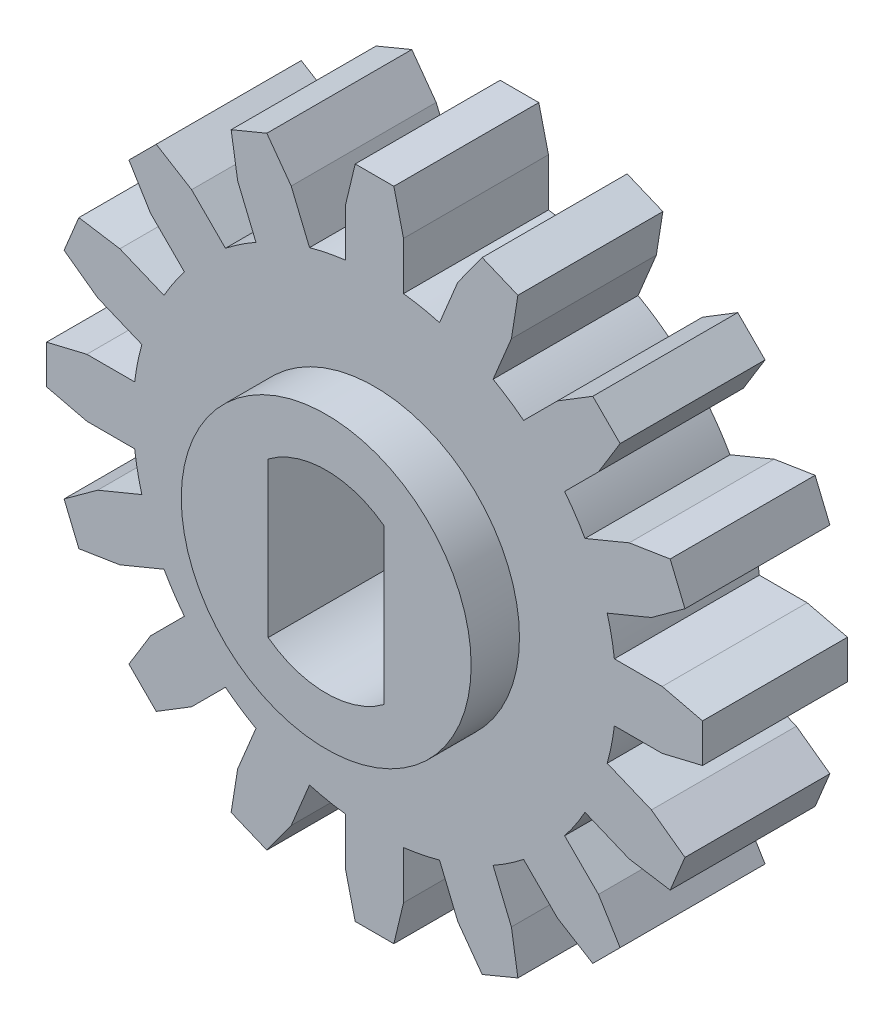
ISO-10303-21;
HEADER;
FILE_DESCRIPTION(('STEP AP214'),'2;1');
FILE_NAME('part.step','',(''),(''),'','','');
FILE_SCHEMA(('AUTOMOTIVE_DESIGN { 1 0 10303 214 1 1 1 1 }'));
ENDSEC;
DATA;
#1=APPLICATION_CONTEXT('core data for automotive mechanical design processes');
#2=APPLICATION_PROTOCOL_DEFINITION('international standard','automotive_design',2000,#1);
#3=PRODUCT_CONTEXT('',#1,'mechanical');
#4=PRODUCT('Part','Part','',(#3));
#5=PRODUCT_RELATED_PRODUCT_CATEGORY('part','',(#4));
#6=PRODUCT_DEFINITION_FORMATION('','',#4);
#7=PRODUCT_DEFINITION_CONTEXT('part definition',#1,'design');
#8=PRODUCT_DEFINITION('design','',#6,#7);
#9=PRODUCT_DEFINITION_SHAPE('','',#8);
#10=(LENGTH_UNIT() NAMED_UNIT(*) SI_UNIT(.MILLI.,.METRE.));
#11=(NAMED_UNIT(*) PLANE_ANGLE_UNIT() SI_UNIT($,.RADIAN.));
#12=(NAMED_UNIT(*) SI_UNIT($,.STERADIAN.) SOLID_ANGLE_UNIT());
#13=UNCERTAINTY_MEASURE_WITH_UNIT(LENGTH_MEASURE(1.E-05),#10,'distance_accuracy_value','');
#14=(GEOMETRIC_REPRESENTATION_CONTEXT(3) GLOBAL_UNCERTAINTY_ASSIGNED_CONTEXT((#13)) GLOBAL_UNIT_ASSIGNED_CONTEXT((#10,
#11,#12)) REPRESENTATION_CONTEXT('',''));
#15=CARTESIAN_POINT('',(0.,0.,0.));
#16=DIRECTION('',(0.,0.,1.));
#17=DIRECTION('',(1.,0.,0.));
#18=AXIS2_PLACEMENT_3D('',#15,#16,#17);
#19=CARTESIAN_POINT('',(0.,0.,3.81));
#20=DIRECTION('',(0.,0.,-1.));
#21=DIRECTION('',(-1.,0.,0.));
#22=AXIS2_PLACEMENT_3D('',#19,#20,#21);
#23=CYLINDRICAL_SURFACE('',#22,6.35);
#24=CARTESIAN_POINT('',(0.,0.,0.));
#25=DIRECTION('',(0.,0.,1.));
#26=DIRECTION('',(1.,0.,0.));
#27=AXIS2_PLACEMENT_3D('',#24,#25,#26);
#28=CIRCLE('',#27,6.35);
#29=CARTESIAN_POINT('',(-0.762,6.30411421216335,0.));
#30=VERTEX_POINT('',#29);
#31=CARTESIAN_POINT('',(-1.70848386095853,6.11584686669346,0.));
#32=VERTEX_POINT('',#31);
#33=EDGE_CURVE('E37',#30,#32,#28,.T.);
#34=ORIENTED_EDGE('',*,*,#33,.T.);
#35=DIRECTION('',(0.,0.,-1.));
#36=VECTOR('',#35,1.);
#37=CARTESIAN_POINT('',(-1.70848386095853,6.11584686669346,3.81));
#38=LINE('',#37,#36);
#39=CARTESIAN_POINT('',(-1.70848386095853,6.11584686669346,3.81));
#40=VERTEX_POINT('',#39);
#41=EDGE_CURVE('E701',#32,#40,#38,.F.);
#42=ORIENTED_EDGE('',*,*,#41,.T.);
#43=CARTESIAN_POINT('',(0.,0.,3.81));
#44=DIRECTION('',(0.,0.,1.));
#45=DIRECTION('',(1.,0.,0.));
#46=AXIS2_PLACEMENT_3D('',#43,#44,#45);
#47=CIRCLE('',#46,6.35);
#48=CARTESIAN_POINT('',(-0.762,6.30411421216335,3.81));
#49=VERTEX_POINT('',#48);
#50=EDGE_CURVE('E1357',#49,#40,#47,.T.);
#51=ORIENTED_EDGE('',*,*,#50,.F.);
#52=DIRECTION('',(0.,0.,-1.));
#53=VECTOR('',#52,1.);
#54=CARTESIAN_POINT('',(-0.762,6.30411421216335,3.81));
#55=LINE('',#54,#53);
#56=EDGE_CURVE('E1305',#49,#30,#55,.T.);
#57=ORIENTED_EDGE('',*,*,#56,.T.);
#58=EDGE_LOOP('',(#34,#42,#51,#57));
#59=FACE_BOUND('',#58,.T.);
#60=ADVANCED_FACE('F33',(#59),#23,.T.);
#61=CARTESIAN_POINT('',(-3.11647626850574,5.53263731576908,3.81));
#62=VERTEX_POINT('',#61);
#63=CARTESIAN_POINT('',(-3.91886654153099,4.99649727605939,3.81));
#64=VERTEX_POINT('',#63);
#65=EDGE_CURVE('E1359',#62,#64,#47,.T.);
#66=ORIENTED_EDGE('',*,*,#65,.F.);
#67=DIRECTION('',(0.,0.,-1.));
#68=VECTOR('',#67,1.);
#69=CARTESIAN_POINT('',(-3.11647626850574,5.53263731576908,3.81));
#70=LINE('',#69,#68);
#71=CARTESIAN_POINT('',(-3.11647626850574,5.53263731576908,0.));
#72=VERTEX_POINT('',#71);
#73=EDGE_CURVE('E694',#62,#72,#70,.T.);
#74=ORIENTED_EDGE('',*,*,#73,.T.);
#75=CARTESIAN_POINT('',(-3.91886654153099,4.99649727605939,0.));
#76=VERTEX_POINT('',#75);
#77=EDGE_CURVE('E1368',#72,#76,#28,.T.);
#78=ORIENTED_EDGE('',*,*,#77,.T.);
#79=DIRECTION('',(0.,0.,-1.));
#80=VECTOR('',#79,1.);
#81=CARTESIAN_POINT('',(-3.91886654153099,4.99649727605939,3.81));
#82=LINE('',#81,#80);
#83=EDGE_CURVE('E740',#76,#64,#82,.F.);
#84=ORIENTED_EDGE('',*,*,#83,.T.);
#85=EDGE_LOOP('',(#66,#74,#78,#84));
#86=FACE_BOUND('',#85,.T.);
#87=ADVANCED_FACE('F1492',(#86),#23,.T.);
#88=CARTESIAN_POINT('',(-4.9964972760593,3.91886654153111,3.81));
#89=VERTEX_POINT('',#88);
#90=CARTESIAN_POINT('',(-5.53263731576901,3.11647626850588,3.81));
#91=VERTEX_POINT('',#90);
#92=EDGE_CURVE('E1362',#89,#91,#47,.T.);
#93=ORIENTED_EDGE('',*,*,#92,.F.);
#94=DIRECTION('',(0.,0.,-1.));
#95=VECTOR('',#94,1.);
#96=CARTESIAN_POINT('',(-4.9964972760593,3.91886654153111,3.81));
#97=LINE('',#96,#95);
#98=CARTESIAN_POINT('',(-4.9964972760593,3.91886654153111,0.));
#99=VERTEX_POINT('',#98);
#100=EDGE_CURVE('E731',#89,#99,#97,.T.);
#101=ORIENTED_EDGE('',*,*,#100,.T.);
#102=CARTESIAN_POINT('',(-5.53263731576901,3.11647626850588,0.));
#103=VERTEX_POINT('',#102);
#104=EDGE_CURVE('E1371',#99,#103,#28,.T.);
#105=ORIENTED_EDGE('',*,*,#104,.T.);
#106=DIRECTION('',(0.,0.,-1.));
#107=VECTOR('',#106,1.);
#108=CARTESIAN_POINT('',(-5.53263731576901,3.11647626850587,3.81));
#109=LINE('',#108,#107);
#110=EDGE_CURVE('E781',#103,#91,#109,.F.);
#111=ORIENTED_EDGE('',*,*,#110,.T.);
#112=EDGE_LOOP('',(#93,#101,#105,#111));
#113=FACE_BOUND('',#112,.T.);
#114=ADVANCED_FACE('F1427',(#113),#23,.T.);
#115=CARTESIAN_POINT('',(-6.11584686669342,1.70848386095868,3.81));
#116=VERTEX_POINT('',#115);
#117=CARTESIAN_POINT('',(-6.30411421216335,0.762000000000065,3.81));
#118=VERTEX_POINT('',#117);
#119=EDGE_CURVE('E1443',#116,#118,#47,.T.);
#120=ORIENTED_EDGE('',*,*,#119,.F.);
#121=DIRECTION('',(0.,0.,-1.));
#122=VECTOR('',#121,1.);
#123=CARTESIAN_POINT('',(-6.11584686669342,1.70848386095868,3.81));
#124=LINE('',#123,#122);
#125=CARTESIAN_POINT('',(-6.11584686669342,1.70848386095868,0.));
#126=VERTEX_POINT('',#125);
#127=EDGE_CURVE('E772',#116,#126,#124,.T.);
#128=ORIENTED_EDGE('',*,*,#127,.T.);
#129=CARTESIAN_POINT('',(-6.30411421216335,0.762000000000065,0.));
#130=VERTEX_POINT('',#129);
#131=EDGE_CURVE('E1416',#126,#130,#28,.T.);
#132=ORIENTED_EDGE('',*,*,#131,.T.);
#133=DIRECTION('',(0.,0.,-1.));
#134=VECTOR('',#133,1.);
#135=CARTESIAN_POINT('',(-6.30411421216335,0.762000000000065,3.81));
#136=LINE('',#135,#134);
#137=EDGE_CURVE('E822',#130,#118,#136,.F.);
#138=ORIENTED_EDGE('',*,*,#137,.T.);
#139=EDGE_LOOP('',(#120,#128,#132,#138));
#140=FACE_BOUND('',#139,.T.);
#141=ADVANCED_FACE('F2519',(#140),#23,.T.);
#142=CARTESIAN_POINT('',(-6.30411421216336,-0.761999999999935,3.81));
#143=VERTEX_POINT('',#142);
#144=CARTESIAN_POINT('',(-6.11584686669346,-1.70848386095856,3.81));
#145=VERTEX_POINT('',#144);
#146=EDGE_CURVE('E1444',#143,#145,#47,.T.);
#147=ORIENTED_EDGE('',*,*,#146,.F.);
#148=DIRECTION('',(0.,0.,-1.));
#149=VECTOR('',#148,1.);
#150=CARTESIAN_POINT('',(-6.30411421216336,-0.761999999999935,3.81));
#151=LINE('',#150,#149);
#152=CARTESIAN_POINT('',(-6.30411421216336,-0.761999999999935,0.));
#153=VERTEX_POINT('',#152);
#154=EDGE_CURVE('E813',#143,#153,#151,.T.);
#155=ORIENTED_EDGE('',*,*,#154,.T.);
#156=CARTESIAN_POINT('',(-6.11584686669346,-1.70848386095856,0.));
#157=VERTEX_POINT('',#156);
#158=EDGE_CURVE('E1412',#153,#157,#28,.T.);
#159=ORIENTED_EDGE('',*,*,#158,.T.);
#160=DIRECTION('',(0.,0.,-1.));
#161=VECTOR('',#160,1.);
#162=CARTESIAN_POINT('',(-6.11584686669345,-1.70848386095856,3.81));
#163=LINE('',#162,#161);
#164=EDGE_CURVE('E863',#157,#145,#163,.F.);
#165=ORIENTED_EDGE('',*,*,#164,.T.);
#166=EDGE_LOOP('',(#147,#155,#159,#165));
#167=FACE_BOUND('',#166,.T.);
#168=ADVANCED_FACE('F2511',(#167),#23,.T.);
#169=CARTESIAN_POINT('',(-5.53263731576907,-3.11647626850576,3.81));
#170=VERTEX_POINT('',#169);
#171=CARTESIAN_POINT('',(-4.99649727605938,-3.91886654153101,3.81));
#172=VERTEX_POINT('',#171);
#173=EDGE_CURVE('E1447',#170,#172,#47,.T.);
#174=ORIENTED_EDGE('',*,*,#173,.F.);
#175=DIRECTION('',(0.,0.,-1.));
#176=VECTOR('',#175,1.);
#177=CARTESIAN_POINT('',(-5.53263731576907,-3.11647626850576,3.81));
#178=LINE('',#177,#176);
#179=CARTESIAN_POINT('',(-5.53263731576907,-3.11647626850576,0.));
#180=VERTEX_POINT('',#179);
#181=EDGE_CURVE('E854',#170,#180,#178,.T.);
#182=ORIENTED_EDGE('',*,*,#181,.T.);
#183=CARTESIAN_POINT('',(-4.99649727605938,-3.91886654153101,0.));
#184=VERTEX_POINT('',#183);
#185=EDGE_CURVE('E1408',#180,#184,#28,.T.);
#186=ORIENTED_EDGE('',*,*,#185,.T.);
#187=DIRECTION('',(0.,0.,-1.));
#188=VECTOR('',#187,1.);
#189=CARTESIAN_POINT('',(-4.99649727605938,-3.91886654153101,3.81));
#190=LINE('',#189,#188);
#191=EDGE_CURVE('E904',#184,#172,#190,.F.);
#192=ORIENTED_EDGE('',*,*,#191,.T.);
#193=EDGE_LOOP('',(#174,#182,#186,#192));
#194=FACE_BOUND('',#193,.T.);
#195=ADVANCED_FACE('F2503',(#194),#23,.T.);
#196=CARTESIAN_POINT('',(-3.91886654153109,-4.99649727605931,3.81));
#197=VERTEX_POINT('',#196);
#198=CARTESIAN_POINT('',(-3.11647626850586,-5.53263731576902,3.81));
#199=VERTEX_POINT('',#198);
#200=EDGE_CURVE('E1450',#197,#199,#47,.T.);
#201=ORIENTED_EDGE('',*,*,#200,.F.);
#202=DIRECTION('',(0.,0.,-1.));
#203=VECTOR('',#202,1.);
#204=CARTESIAN_POINT('',(-3.91886654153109,-4.99649727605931,3.81));
#205=LINE('',#204,#203);
#206=CARTESIAN_POINT('',(-3.91886654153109,-4.99649727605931,0.));
#207=VERTEX_POINT('',#206);
#208=EDGE_CURVE('E895',#197,#207,#205,.T.);
#209=ORIENTED_EDGE('',*,*,#208,.T.);
#210=CARTESIAN_POINT('',(-3.11647626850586,-5.53263731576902,0.));
#211=VERTEX_POINT('',#210);
#212=EDGE_CURVE('E1404',#207,#211,#28,.T.);
#213=ORIENTED_EDGE('',*,*,#212,.T.);
#214=DIRECTION('',(0.,0.,-1.));
#215=VECTOR('',#214,1.);
#216=CARTESIAN_POINT('',(-3.11647626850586,-5.53263731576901,3.81));
#217=LINE('',#216,#215);
#218=EDGE_CURVE('E945',#211,#199,#217,.F.);
#219=ORIENTED_EDGE('',*,*,#218,.T.);
#220=EDGE_LOOP('',(#201,#209,#213,#219));
#221=FACE_BOUND('',#220,.T.);
#222=ADVANCED_FACE('F2495',(#221),#23,.T.);
#223=CARTESIAN_POINT('',(-1.70848386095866,-6.11584686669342,3.81));
#224=VERTEX_POINT('',#223);
#225=CARTESIAN_POINT('',(-0.762000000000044,-6.30411421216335,3.81));
#226=VERTEX_POINT('',#225);
#227=EDGE_CURVE('E1453',#224,#226,#47,.T.);
#228=ORIENTED_EDGE('',*,*,#227,.F.);
#229=DIRECTION('',(0.,0.,-1.));
#230=VECTOR('',#229,1.);
#231=CARTESIAN_POINT('',(-1.70848386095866,-6.11584686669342,3.81));
#232=LINE('',#231,#230);
#233=CARTESIAN_POINT('',(-1.70848386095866,-6.11584686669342,0.));
#234=VERTEX_POINT('',#233);
#235=EDGE_CURVE('E936',#224,#234,#232,.T.);
#236=ORIENTED_EDGE('',*,*,#235,.T.);
#237=CARTESIAN_POINT('',(-0.762000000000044,-6.30411421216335,0.));
#238=VERTEX_POINT('',#237);
#239=EDGE_CURVE('E1400',#234,#238,#28,.T.);
#240=ORIENTED_EDGE('',*,*,#239,.T.);
#241=DIRECTION('',(0.,0.,-1.));
#242=VECTOR('',#241,1.);
#243=CARTESIAN_POINT('',(-0.762000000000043,-6.30411421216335,3.81));
#244=LINE('',#243,#242);
#245=EDGE_CURVE('E986',#238,#226,#244,.F.);
#246=ORIENTED_EDGE('',*,*,#245,.T.);
#247=EDGE_LOOP('',(#228,#236,#240,#246));
#248=FACE_BOUND('',#247,.T.);
#249=ADVANCED_FACE('F2487',(#248),#23,.T.);
#250=CARTESIAN_POINT('',(0.761999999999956,-6.30411421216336,3.81));
#251=VERTEX_POINT('',#250);
#252=CARTESIAN_POINT('',(1.70848386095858,-6.11584686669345,3.81));
#253=VERTEX_POINT('',#252);
#254=EDGE_CURVE('E1456',#251,#253,#47,.T.);
#255=ORIENTED_EDGE('',*,*,#254,.F.);
#256=DIRECTION('',(0.,0.,-1.));
#257=VECTOR('',#256,1.);
#258=CARTESIAN_POINT('',(0.761999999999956,-6.30411421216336,3.81));
#259=LINE('',#258,#257);
#260=CARTESIAN_POINT('',(0.761999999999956,-6.30411421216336,0.));
#261=VERTEX_POINT('',#260);
#262=EDGE_CURVE('E977',#251,#261,#259,.T.);
#263=ORIENTED_EDGE('',*,*,#262,.T.);
#264=CARTESIAN_POINT('',(1.70848386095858,-6.11584686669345,0.));
#265=VERTEX_POINT('',#264);
#266=EDGE_CURVE('E1396',#261,#265,#28,.T.);
#267=ORIENTED_EDGE('',*,*,#266,.T.);
#268=DIRECTION('',(0.,0.,-1.));
#269=VECTOR('',#268,1.);
#270=CARTESIAN_POINT('',(1.70848386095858,-6.11584686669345,3.81));
#271=LINE('',#270,#269);
#272=EDGE_CURVE('E1027',#265,#253,#271,.F.);
#273=ORIENTED_EDGE('',*,*,#272,.T.);
#274=EDGE_LOOP('',(#255,#263,#267,#273));
#275=FACE_BOUND('',#274,.T.);
#276=ADVANCED_FACE('F2479',(#275),#23,.T.);
#277=CARTESIAN_POINT('',(3.11647626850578,-5.53263731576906,3.81));
#278=VERTEX_POINT('',#277);
#279=CARTESIAN_POINT('',(3.91886654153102,-4.99649727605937,3.81));
#280=VERTEX_POINT('',#279);
#281=EDGE_CURVE('E1459',#278,#280,#47,.T.);
#282=ORIENTED_EDGE('',*,*,#281,.F.);
#283=DIRECTION('',(0.,0.,-1.));
#284=VECTOR('',#283,1.);
#285=CARTESIAN_POINT('',(3.11647626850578,-5.53263731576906,3.81));
#286=LINE('',#285,#284);
#287=CARTESIAN_POINT('',(3.11647626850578,-5.53263731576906,0.));
#288=VERTEX_POINT('',#287);
#289=EDGE_CURVE('E1018',#278,#288,#286,.T.);
#290=ORIENTED_EDGE('',*,*,#289,.T.);
#291=CARTESIAN_POINT('',(3.91886654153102,-4.99649727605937,0.));
#292=VERTEX_POINT('',#291);
#293=EDGE_CURVE('E1392',#288,#292,#28,.T.);
#294=ORIENTED_EDGE('',*,*,#293,.T.);
#295=DIRECTION('',(0.,0.,-1.));
#296=VECTOR('',#295,1.);
#297=CARTESIAN_POINT('',(3.91886654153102,-4.99649727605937,3.81));
#298=LINE('',#297,#296);
#299=EDGE_CURVE('E1068',#292,#280,#298,.F.);
#300=ORIENTED_EDGE('',*,*,#299,.T.);
#301=EDGE_LOOP('',(#282,#290,#294,#300));
#302=FACE_BOUND('',#301,.T.);
#303=ADVANCED_FACE('F2471',(#302),#23,.T.);
#304=CARTESIAN_POINT('',(4.99649727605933,-3.91886654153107,3.81));
#305=VERTEX_POINT('',#304);
#306=CARTESIAN_POINT('',(5.53263731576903,-3.11647626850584,3.81));
#307=VERTEX_POINT('',#306);
#308=EDGE_CURVE('E1462',#305,#307,#47,.T.);
#309=ORIENTED_EDGE('',*,*,#308,.F.);
#310=DIRECTION('',(0.,0.,-1.));
#311=VECTOR('',#310,1.);
#312=CARTESIAN_POINT('',(4.99649727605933,-3.91886654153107,3.81));
#313=LINE('',#312,#311);
#314=CARTESIAN_POINT('',(4.99649727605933,-3.91886654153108,0.));
#315=VERTEX_POINT('',#314);
#316=EDGE_CURVE('E1059',#305,#315,#313,.T.);
#317=ORIENTED_EDGE('',*,*,#316,.T.);
#318=CARTESIAN_POINT('',(5.53263731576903,-3.11647626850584,0.));
#319=VERTEX_POINT('',#318);
#320=EDGE_CURVE('E1388',#315,#319,#28,.T.);
#321=ORIENTED_EDGE('',*,*,#320,.T.);
#322=DIRECTION('',(0.,0.,-1.));
#323=VECTOR('',#322,1.);
#324=CARTESIAN_POINT('',(5.53263731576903,-3.11647626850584,3.81));
#325=LINE('',#324,#323);
#326=EDGE_CURVE('E1109',#319,#307,#325,.F.);
#327=ORIENTED_EDGE('',*,*,#326,.T.);
#328=EDGE_LOOP('',(#309,#317,#321,#327));
#329=FACE_BOUND('',#328,.T.);
#330=ADVANCED_FACE('F2463',(#329),#23,.T.);
#331=CARTESIAN_POINT('',(6.11584686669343,-1.70848386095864,3.81));
#332=VERTEX_POINT('',#331);
#333=CARTESIAN_POINT('',(6.30411421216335,-0.762000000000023,3.81));
#334=VERTEX_POINT('',#333);
#335=EDGE_CURVE('E1465',#332,#334,#47,.T.);
#336=ORIENTED_EDGE('',*,*,#335,.F.);
#337=DIRECTION('',(0.,0.,-1.));
#338=VECTOR('',#337,1.);
#339=CARTESIAN_POINT('',(6.11584686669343,-1.70848386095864,3.81));
#340=LINE('',#339,#338);
#341=CARTESIAN_POINT('',(6.11584686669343,-1.70848386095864,0.));
#342=VERTEX_POINT('',#341);
#343=EDGE_CURVE('E1100',#332,#342,#340,.T.);
#344=ORIENTED_EDGE('',*,*,#343,.T.);
#345=CARTESIAN_POINT('',(6.30411421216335,-0.762000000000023,0.));
#346=VERTEX_POINT('',#345);
#347=EDGE_CURVE('E1384',#342,#346,#28,.T.);
#348=ORIENTED_EDGE('',*,*,#347,.T.);
#349=DIRECTION('',(0.,0.,-1.));
#350=VECTOR('',#349,1.);
#351=CARTESIAN_POINT('',(6.30411421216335,-0.762000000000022,3.81));
#352=LINE('',#351,#350);
#353=EDGE_CURVE('E1150',#346,#334,#352,.F.);
#354=ORIENTED_EDGE('',*,*,#353,.T.);
#355=EDGE_LOOP('',(#336,#344,#348,#354));
#356=FACE_BOUND('',#355,.T.);
#357=ADVANCED_FACE('F1490',(#356),#23,.T.);
#358=CARTESIAN_POINT('',(6.30411421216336,0.761999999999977,3.81));
#359=VERTEX_POINT('',#358);
#360=CARTESIAN_POINT('',(6.11584686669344,1.7084838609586,3.81));
#361=VERTEX_POINT('',#360);
#362=EDGE_CURVE('E1468',#359,#361,#47,.T.);
#363=ORIENTED_EDGE('',*,*,#362,.F.);
#364=DIRECTION('',(0.,0.,-1.));
#365=VECTOR('',#364,1.);
#366=CARTESIAN_POINT('',(6.30411421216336,0.761999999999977,3.81));
#367=LINE('',#366,#365);
#368=CARTESIAN_POINT('',(6.30411421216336,0.761999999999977,0.));
#369=VERTEX_POINT('',#368);
#370=EDGE_CURVE('E1141',#359,#369,#367,.T.);
#371=ORIENTED_EDGE('',*,*,#370,.T.);
#372=CARTESIAN_POINT('',(6.11584686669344,1.7084838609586,0.));
#373=VERTEX_POINT('',#372);
#374=EDGE_CURVE('E1380',#369,#373,#28,.T.);
#375=ORIENTED_EDGE('',*,*,#374,.T.);
#376=DIRECTION('',(0.,0.,-1.));
#377=VECTOR('',#376,1.);
#378=CARTESIAN_POINT('',(6.11584686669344,1.7084838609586,3.81));
#379=LINE('',#378,#377);
#380=EDGE_CURVE('E1191',#373,#361,#379,.F.);
#381=ORIENTED_EDGE('',*,*,#380,.T.);
#382=EDGE_LOOP('',(#363,#371,#375,#381));
#383=FACE_BOUND('',#382,.T.);
#384=ADVANCED_FACE('F1485',(#383),#23,.T.);
#385=CARTESIAN_POINT('',(5.53263731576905,3.1164762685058,3.81));
#386=VERTEX_POINT('',#385);
#387=CARTESIAN_POINT('',(4.99649727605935,3.91886654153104,3.81));
#388=VERTEX_POINT('',#387);
#389=EDGE_CURVE('E1366',#386,#388,#47,.T.);
#390=ORIENTED_EDGE('',*,*,#389,.F.);
#391=DIRECTION('',(0.,0.,-1.));
#392=VECTOR('',#391,1.);
#393=CARTESIAN_POINT('',(5.53263731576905,3.1164762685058,3.81));
#394=LINE('',#393,#392);
#395=CARTESIAN_POINT('',(5.53263731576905,3.1164762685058,0.));
#396=VERTEX_POINT('',#395);
#397=EDGE_CURVE('E1182',#386,#396,#394,.T.);
#398=ORIENTED_EDGE('',*,*,#397,.T.);
#399=CARTESIAN_POINT('',(4.99649727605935,3.91886654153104,0.));
#400=VERTEX_POINT('',#399);
#401=EDGE_CURVE('E1376',#396,#400,#28,.T.);
#402=ORIENTED_EDGE('',*,*,#401,.T.);
#403=DIRECTION('',(0.,0.,-1.));
#404=VECTOR('',#403,1.);
#405=CARTESIAN_POINT('',(4.99649727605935,3.91886654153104,3.81));
#406=LINE('',#405,#404);
#407=EDGE_CURVE('E1232',#400,#388,#406,.F.);
#408=ORIENTED_EDGE('',*,*,#407,.T.);
#409=EDGE_LOOP('',(#390,#398,#402,#408));
#410=FACE_BOUND('',#409,.T.);
#411=ADVANCED_FACE('F1482',(#410),#23,.T.);
#412=CARTESIAN_POINT('',(3.91886654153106,4.99649727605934,3.81));
#413=VERTEX_POINT('',#412);
#414=CARTESIAN_POINT('',(3.11647626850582,5.53263731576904,3.81));
#415=VERTEX_POINT('',#414);
#416=EDGE_CURVE('E1363',#413,#415,#47,.T.);
#417=ORIENTED_EDGE('',*,*,#416,.F.);
#418=DIRECTION('',(0.,0.,-1.));
#419=VECTOR('',#418,1.);
#420=CARTESIAN_POINT('',(3.91886654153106,4.99649727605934,3.81));
#421=LINE('',#420,#419);
#422=CARTESIAN_POINT('',(3.91886654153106,4.99649727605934,0.));
#423=VERTEX_POINT('',#422);
#424=EDGE_CURVE('E1223',#413,#423,#421,.T.);
#425=ORIENTED_EDGE('',*,*,#424,.T.);
#426=CARTESIAN_POINT('',(3.11647626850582,5.53263731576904,0.));
#427=VERTEX_POINT('',#426);
#428=EDGE_CURVE('E1372',#423,#427,#28,.T.);
#429=ORIENTED_EDGE('',*,*,#428,.T.);
#430=DIRECTION('',(0.,0.,-1.));
#431=VECTOR('',#430,1.);
#432=CARTESIAN_POINT('',(3.11647626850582,5.53263731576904,3.81));
#433=LINE('',#432,#431);
#434=EDGE_CURVE('E1273',#427,#415,#433,.F.);
#435=ORIENTED_EDGE('',*,*,#434,.T.);
#436=EDGE_LOOP('',(#417,#425,#429,#435));
#437=FACE_BOUND('',#436,.T.);
#438=ADVANCED_FACE('F1484',(#437),#23,.T.);
#439=CARTESIAN_POINT('',(1.70848386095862,6.11584686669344,3.81));
#440=VERTEX_POINT('',#439);
#441=CARTESIAN_POINT('',(0.762,6.30411421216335,3.81));
#442=VERTEX_POINT('',#441);
#443=EDGE_CURVE('E1360',#440,#442,#47,.T.);
#444=ORIENTED_EDGE('',*,*,#443,.F.);
#445=DIRECTION('',(0.,0.,-1.));
#446=VECTOR('',#445,1.);
#447=CARTESIAN_POINT('',(1.70848386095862,6.11584686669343,3.81));
#448=LINE('',#447,#446);
#449=CARTESIAN_POINT('',(1.70848386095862,6.11584686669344,0.));
#450=VERTEX_POINT('',#449);
#451=EDGE_CURVE('E1264',#440,#450,#448,.T.);
#452=ORIENTED_EDGE('',*,*,#451,.T.);
#453=CARTESIAN_POINT('',(0.762,6.30411421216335,0.));
#454=VERTEX_POINT('',#453);
#455=EDGE_CURVE('E1355',#450,#454,#28,.T.);
#456=ORIENTED_EDGE('',*,*,#455,.T.);
#457=DIRECTION('',(0.,0.,-1.));
#458=VECTOR('',#457,1.);
#459=CARTESIAN_POINT('',(0.762,6.30411421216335,3.81));
#460=LINE('',#459,#458);
#461=EDGE_CURVE('E1314',#454,#442,#460,.F.);
#462=ORIENTED_EDGE('',*,*,#461,.T.);
#463=EDGE_LOOP('',(#444,#452,#456,#462));
#464=FACE_BOUND('',#463,.T.);
#465=ADVANCED_FACE('F35',(#464),#23,.T.);
#466=CARTESIAN_POINT('',(0.,0.,3.81));
#467=DIRECTION('',(0.,0.,1.));
#468=DIRECTION('',(1.,0.,0.));
#469=AXIS2_PLACEMENT_3D('',#466,#467,#468);
#470=PLANE('',#469);
#471=ORIENTED_EDGE('',*,*,#50,.T.);
#472=DIRECTION('',(-0.382683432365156,0.92387953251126,0.));
#473=VECTOR('',#472,1.);
#474=CARTESIAN_POINT('',(-2.18953097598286,7.27719733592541,3.81));
#475=LINE('',#474,#473);
#476=CARTESIAN_POINT('',(-2.18953097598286,7.27719733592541,3.81));
#477=VERTEX_POINT('',#476);
#478=EDGE_CURVE('E681',#40,#477,#475,.T.);
#479=ORIENTED_EDGE('',*,*,#478,.T.);
#480=DIRECTION('',(-0.587454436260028,0.809257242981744,0.));
#481=VECTOR('',#480,1.);
#482=CARTESIAN_POINT('',(-2.8298006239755,8.15921101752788,3.81));
#483=LINE('',#482,#481);
#484=CARTESIAN_POINT('',(-2.8298006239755,8.15921101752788,3.81));
#485=VERTEX_POINT('',#484);
#486=EDGE_CURVE('E678',#477,#485,#483,.T.);
#487=ORIENTED_EDGE('',*,*,#486,.T.);
#488=DIRECTION('',(-0.923879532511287,-0.38268343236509,0.));
#489=VECTOR('',#488,1.);
#490=CARTESIAN_POINT('',(-3.76846222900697,7.77040465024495,3.81));
#491=LINE('',#490,#489);
#492=CARTESIAN_POINT('',(-3.76846222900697,7.77040465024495,3.81));
#493=VERTEX_POINT('',#492);
#494=EDGE_CURVE('E688',#485,#493,#491,.T.);
#495=ORIENTED_EDGE('',*,*,#494,.T.);
#496=DIRECTION('',(0.156838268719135,-0.987624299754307,0.));
#497=VECTOR('',#496,1.);
#498=CARTESIAN_POINT('',(-3.76846222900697,7.77040465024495,3.81));
#499=LINE('',#498,#497);
#500=CARTESIAN_POINT('',(-3.59752338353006,6.69398778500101,3.81));
#501=VERTEX_POINT('',#500);
#502=EDGE_CURVE('E657',#493,#501,#499,.T.);
#503=ORIENTED_EDGE('',*,*,#502,.T.);
#504=DIRECTION('',(0.382683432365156,-0.923879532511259,0.));
#505=VECTOR('',#504,1.);
#506=CARTESIAN_POINT('',(-3.59752338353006,6.69398778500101,3.81));
#507=LINE('',#506,#505);
#508=EDGE_CURVE('E50',#501,#62,#507,.T.);
#509=ORIENTED_EDGE('',*,*,#508,.T.);
#510=ORIENTED_EDGE('',*,*,#65,.T.);
#511=DIRECTION('',(-0.707106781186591,0.707106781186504,0.));
#512=VECTOR('',#511,1.);
#513=CARTESIAN_POINT('',(-4.80772570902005,5.88535644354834,3.81));
#514=LINE('',#513,#512);
#515=CARTESIAN_POINT('',(-4.80772570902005,5.88535644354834,3.81));
#516=VERTEX_POINT('',#515);
#517=EDGE_CURVE('E725',#64,#516,#514,.T.);
#518=ORIENTED_EDGE('',*,*,#517,.T.);
#519=DIRECTION('',(-0.852426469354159,0.52284712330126,0.));
#520=VECTOR('',#519,1.);
#521=CARTESIAN_POINT('',(-5.73678975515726,6.45521024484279,3.81));
#522=LINE('',#521,#520);
#523=CARTESIAN_POINT('',(-5.73678975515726,6.45521024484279,3.81));
#524=VERTEX_POINT('',#523);
#525=EDGE_CURVE('E709',#516,#524,#522,.T.);
#526=ORIENTED_EDGE('',*,*,#525,.T.);
#527=DIRECTION('',(-0.707106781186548,-0.707106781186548,0.));
#528=VECTOR('',#527,1.);
#529=CARTESIAN_POINT('',(-6.45521024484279,5.73678975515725,3.81));
#530=LINE('',#529,#528);
#531=CARTESIAN_POINT('',(-6.45521024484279,5.73678975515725,3.81));
#532=VERTEX_POINT('',#531);
#533=EDGE_CURVE('E704',#524,#532,#530,.T.);
#534=ORIENTED_EDGE('',*,*,#533,.T.);
#535=DIRECTION('',(0.52284712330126,-0.852426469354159,0.));
#536=VECTOR('',#535,1.);
#537=CARTESIAN_POINT('',(-6.45521024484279,5.73678975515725,3.81));
#538=LINE('',#537,#536);
#539=CARTESIAN_POINT('',(-5.88535644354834,4.80772570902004,3.81));
#540=VERTEX_POINT('',#539);
#541=EDGE_CURVE('E722',#532,#540,#538,.T.);
#542=ORIENTED_EDGE('',*,*,#541,.T.);
#543=DIRECTION('',(0.707106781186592,-0.707106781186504,0.));
#544=VECTOR('',#543,1.);
#545=CARTESIAN_POINT('',(-5.88535644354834,4.80772570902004,3.81));
#546=LINE('',#545,#544);
#547=EDGE_CURVE('E57',#540,#89,#546,.T.);
#548=ORIENTED_EDGE('',*,*,#547,.T.);
#549=ORIENTED_EDGE('',*,*,#92,.T.);
#550=DIRECTION('',(-0.923879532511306,0.382683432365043,0.));
#551=VECTOR('',#550,1.);
#552=CARTESIAN_POINT('',(-6.69398778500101,3.59752338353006,3.81));
#553=LINE('',#552,#551);
#554=CARTESIAN_POINT('',(-6.69398778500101,3.59752338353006,3.81));
#555=VERTEX_POINT('',#554);
#556=EDGE_CURVE('E766',#91,#555,#553,.T.);
#557=ORIENTED_EDGE('',*,*,#556,.T.);
#558=DIRECTION('',(-0.987624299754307,0.156838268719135,0.));
#559=VECTOR('',#558,1.);
#560=CARTESIAN_POINT('',(-7.77040465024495,3.76846222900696,3.81));
#561=LINE('',#560,#559);
#562=CARTESIAN_POINT('',(-7.77040465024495,3.76846222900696,3.81));
#563=VERTEX_POINT('',#562);
#564=EDGE_CURVE('E748',#555,#563,#561,.T.);
#565=ORIENTED_EDGE('',*,*,#564,.T.);
#566=DIRECTION('',(-0.38268343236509,-0.923879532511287,0.));
#567=VECTOR('',#566,1.);
#568=CARTESIAN_POINT('',(-8.15921101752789,2.8298006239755,3.81));
#569=LINE('',#568,#567);
#570=CARTESIAN_POINT('',(-8.15921101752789,2.8298006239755,3.81));
#571=VERTEX_POINT('',#570);
#572=EDGE_CURVE('E743',#563,#571,#569,.T.);
#573=ORIENTED_EDGE('',*,*,#572,.T.);
#574=DIRECTION('',(0.809257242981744,-0.587454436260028,0.));
#575=VECTOR('',#574,1.);
#576=CARTESIAN_POINT('',(-8.15921101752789,2.8298006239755,3.81));
#577=LINE('',#576,#575);
#578=CARTESIAN_POINT('',(-7.27719733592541,2.18953097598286,3.81));
#579=VERTEX_POINT('',#578);
#580=EDGE_CURVE('E761',#571,#579,#577,.T.);
#581=ORIENTED_EDGE('',*,*,#580,.T.);
#582=DIRECTION('',(0.923879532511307,-0.382683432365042,0.));
#583=VECTOR('',#582,1.);
#584=CARTESIAN_POINT('',(-7.27719733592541,2.18953097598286,3.81));
#585=LINE('',#584,#583);
#586=EDGE_CURVE('E764',#579,#116,#585,.T.);
#587=ORIENTED_EDGE('',*,*,#586,.T.);
#588=ORIENTED_EDGE('',*,*,#119,.T.);
#589=DIRECTION('',(-1.,0.,0.));
#590=VECTOR('',#589,1.);
#591=CARTESIAN_POINT('',(-7.56115090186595,0.761999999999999,3.81));
#592=LINE('',#591,#590);
#593=CARTESIAN_POINT('',(-7.56115090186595,0.761999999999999,3.81));
#594=VERTEX_POINT('',#593);
#595=EDGE_CURVE('E807',#118,#594,#592,.T.);
#596=ORIENTED_EDGE('',*,*,#595,.T.);
#597=DIRECTION('',(-0.972465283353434,-0.233047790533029,0.));
#598=VECTOR('',#597,1.);
#599=CARTESIAN_POINT('',(-8.62104587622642,0.508000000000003,3.81));
#600=LINE('',#599,#598);
#601=CARTESIAN_POINT('',(-8.62104587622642,0.508000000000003,3.81));
#602=VERTEX_POINT('',#601);
#603=EDGE_CURVE('E789',#594,#602,#600,.T.);
#604=ORIENTED_EDGE('',*,*,#603,.T.);
#605=DIRECTION('',(0.,-1.,0.));
#606=VECTOR('',#605,1.);
#607=CARTESIAN_POINT('',(-8.62104587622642,-0.508000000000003,3.81));
#608=LINE('',#607,#606);
#609=CARTESIAN_POINT('',(-8.62104587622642,-0.508000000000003,3.81));
#610=VERTEX_POINT('',#609);
#611=EDGE_CURVE('E784',#602,#610,#608,.T.);
#612=ORIENTED_EDGE('',*,*,#611,.T.);
#613=DIRECTION('',(0.972465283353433,-0.233047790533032,0.));
#614=VECTOR('',#613,1.);
#615=CARTESIAN_POINT('',(-8.62104587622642,-0.508000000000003,3.81));
#616=LINE('',#615,#614);
#617=CARTESIAN_POINT('',(-7.56115090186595,-0.762000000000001,3.81));
#618=VERTEX_POINT('',#617);
#619=EDGE_CURVE('E802',#610,#618,#616,.T.);
#620=ORIENTED_EDGE('',*,*,#619,.T.);
#621=DIRECTION('',(1.,0.,0.));
#622=VECTOR('',#621,1.);
#623=CARTESIAN_POINT('',(-7.56115090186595,-0.762000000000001,3.81));
#624=LINE('',#623,#622);
#625=EDGE_CURVE('E805',#618,#143,#624,.T.);
#626=ORIENTED_EDGE('',*,*,#625,.T.);
#627=ORIENTED_EDGE('',*,*,#146,.T.);
#628=DIRECTION('',(-0.923879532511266,-0.38268343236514,0.));
#629=VECTOR('',#628,1.);
#630=CARTESIAN_POINT('',(-7.27719733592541,-2.18953097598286,3.81));
#631=LINE('',#630,#629);
#632=CARTESIAN_POINT('',(-7.27719733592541,-2.18953097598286,3.81));
#633=VERTEX_POINT('',#632);
#634=EDGE_CURVE('E848',#145,#633,#631,.T.);
#635=ORIENTED_EDGE('',*,*,#634,.T.);
#636=DIRECTION('',(-0.809257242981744,-0.587454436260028,0.));
#637=VECTOR('',#636,1.);
#638=CARTESIAN_POINT('',(-8.15921101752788,-2.8298006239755,3.81));
#639=LINE('',#638,#637);
#640=CARTESIAN_POINT('',(-8.15921101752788,-2.8298006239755,3.81));
#641=VERTEX_POINT('',#640);
#642=EDGE_CURVE('E830',#633,#641,#639,.T.);
#643=ORIENTED_EDGE('',*,*,#642,.T.);
#644=DIRECTION('',(0.38268343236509,-0.923879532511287,0.));
#645=VECTOR('',#644,1.);
#646=CARTESIAN_POINT('',(-7.77040465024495,-3.76846222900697,3.81));
#647=LINE('',#646,#645);
#648=CARTESIAN_POINT('',(-7.77040465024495,-3.76846222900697,3.81));
#649=VERTEX_POINT('',#648);
#650=EDGE_CURVE('E825',#641,#649,#647,.T.);
#651=ORIENTED_EDGE('',*,*,#650,.T.);
#652=DIRECTION('',(0.987624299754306,0.156838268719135,0.));
#653=VECTOR('',#652,1.);
#654=CARTESIAN_POINT('',(-7.77040465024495,-3.76846222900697,3.81));
#655=LINE('',#654,#653);
#656=CARTESIAN_POINT('',(-6.69398778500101,-3.59752338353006,3.81));
#657=VERTEX_POINT('',#656);
#658=EDGE_CURVE('E843',#649,#657,#655,.T.);
#659=ORIENTED_EDGE('',*,*,#658,.T.);
#660=DIRECTION('',(0.923879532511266,0.382683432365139,0.));
#661=VECTOR('',#660,1.);
#662=CARTESIAN_POINT('',(-6.69398778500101,-3.59752338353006,3.81));
#663=LINE('',#662,#661);
#664=EDGE_CURVE('E846',#657,#170,#663,.T.);
#665=ORIENTED_EDGE('',*,*,#664,.T.);
#666=ORIENTED_EDGE('',*,*,#173,.T.);
#667=DIRECTION('',(-0.707106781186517,-0.707106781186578,0.));
#668=VECTOR('',#667,1.);
#669=CARTESIAN_POINT('',(-5.88535644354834,-4.80772570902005,3.81));
#670=LINE('',#669,#668);
#671=CARTESIAN_POINT('',(-5.88535644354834,-4.80772570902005,3.81));
#672=VERTEX_POINT('',#671);
#673=EDGE_CURVE('E889',#172,#672,#670,.T.);
#674=ORIENTED_EDGE('',*,*,#673,.T.);
#675=DIRECTION('',(-0.52284712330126,-0.852426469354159,0.));
#676=VECTOR('',#675,1.);
#677=CARTESIAN_POINT('',(-6.45521024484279,-5.73678975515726,3.81));
#678=LINE('',#677,#676);
#679=CARTESIAN_POINT('',(-6.45521024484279,-5.73678975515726,3.81));
#680=VERTEX_POINT('',#679);
#681=EDGE_CURVE('E871',#672,#680,#678,.T.);
#682=ORIENTED_EDGE('',*,*,#681,.T.);
#683=DIRECTION('',(0.707106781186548,-0.707106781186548,0.));
#684=VECTOR('',#683,1.);
#685=CARTESIAN_POINT('',(-5.73678975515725,-6.45521024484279,3.81));
#686=LINE('',#685,#684);
#687=CARTESIAN_POINT('',(-5.73678975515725,-6.45521024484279,3.81));
#688=VERTEX_POINT('',#687);
#689=EDGE_CURVE('E866',#680,#688,#686,.T.);
#690=ORIENTED_EDGE('',*,*,#689,.T.);
#691=DIRECTION('',(0.852426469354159,0.52284712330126,0.));
#692=VECTOR('',#691,1.);
#693=CARTESIAN_POINT('',(-5.73678975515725,-6.45521024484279,3.81));
#694=LINE('',#693,#692);
#695=CARTESIAN_POINT('',(-4.80772570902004,-5.88535644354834,3.81));
#696=VERTEX_POINT('',#695);
#697=EDGE_CURVE('E884',#688,#696,#694,.T.);
#698=ORIENTED_EDGE('',*,*,#697,.T.);
#699=DIRECTION('',(0.707106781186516,0.707106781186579,0.));
#700=VECTOR('',#699,1.);
#701=CARTESIAN_POINT('',(-4.80772570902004,-5.88535644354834,3.81));
#702=LINE('',#701,#700);
#703=EDGE_CURVE('E887',#696,#197,#702,.T.);
#704=ORIENTED_EDGE('',*,*,#703,.T.);
#705=ORIENTED_EDGE('',*,*,#200,.T.);
#706=DIRECTION('',(-0.382683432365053,-0.923879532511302,0.));
#707=VECTOR('',#706,1.);
#708=CARTESIAN_POINT('',(-3.59752338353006,-6.69398778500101,3.81));
#709=LINE('',#708,#707);
#710=CARTESIAN_POINT('',(-3.59752338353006,-6.69398778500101,3.81));
#711=VERTEX_POINT('',#710);
#712=EDGE_CURVE('E930',#199,#711,#709,.T.);
#713=ORIENTED_EDGE('',*,*,#712,.T.);
#714=DIRECTION('',(-0.156838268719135,-0.987624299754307,0.));
#715=VECTOR('',#714,1.);
#716=CARTESIAN_POINT('',(-3.76846222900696,-7.77040465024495,3.81));
#717=LINE('',#716,#715);
#718=CARTESIAN_POINT('',(-3.76846222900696,-7.77040465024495,3.81));
#719=VERTEX_POINT('',#718);
#720=EDGE_CURVE('E912',#711,#719,#717,.T.);
#721=ORIENTED_EDGE('',*,*,#720,.T.);
#722=DIRECTION('',(0.923879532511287,-0.38268343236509,0.));
#723=VECTOR('',#722,1.);
#724=CARTESIAN_POINT('',(-2.82980062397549,-8.15921101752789,3.81));
#725=LINE('',#724,#723);
#726=CARTESIAN_POINT('',(-2.82980062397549,-8.15921101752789,3.81));
#727=VERTEX_POINT('',#726);
#728=EDGE_CURVE('E907',#719,#727,#725,.T.);
#729=ORIENTED_EDGE('',*,*,#728,.T.);
#730=DIRECTION('',(0.587454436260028,0.809257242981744,0.));
#731=VECTOR('',#730,1.);
#732=CARTESIAN_POINT('',(-2.82980062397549,-8.15921101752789,3.81));
#733=LINE('',#732,#731);
#734=CARTESIAN_POINT('',(-2.18953097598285,-7.27719733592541,3.81));
#735=VERTEX_POINT('',#734);
#736=EDGE_CURVE('E925',#727,#735,#733,.T.);
#737=ORIENTED_EDGE('',*,*,#736,.T.);
#738=DIRECTION('',(0.382683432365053,0.923879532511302,0.));
#739=VECTOR('',#738,1.);
#740=CARTESIAN_POINT('',(-2.18953097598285,-7.27719733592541,3.81));
#741=LINE('',#740,#739);
#742=EDGE_CURVE('E928',#735,#224,#741,.T.);
#743=ORIENTED_EDGE('',*,*,#742,.T.);
#744=ORIENTED_EDGE('',*,*,#227,.T.);
#745=DIRECTION('',(0.,-1.,0.));
#746=VECTOR('',#745,1.);
#747=CARTESIAN_POINT('',(-0.761999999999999,-7.56115090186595,3.81));
#748=LINE('',#747,#746);
#749=CARTESIAN_POINT('',(-0.761999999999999,-7.56115090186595,3.81));
#750=VERTEX_POINT('',#749);
#751=EDGE_CURVE('E971',#226,#750,#748,.T.);
#752=ORIENTED_EDGE('',*,*,#751,.T.);
#753=DIRECTION('',(0.233047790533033,-0.972465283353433,0.));
#754=VECTOR('',#753,1.);
#755=CARTESIAN_POINT('',(-0.507999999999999,-8.62104587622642,3.81));
#756=LINE('',#755,#754);
#757=CARTESIAN_POINT('',(-0.507999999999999,-8.62104587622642,3.81));
#758=VERTEX_POINT('',#757);
#759=EDGE_CURVE('E953',#750,#758,#756,.T.);
#760=ORIENTED_EDGE('',*,*,#759,.T.);
#761=DIRECTION('',(1.,0.,0.));
#762=VECTOR('',#761,1.);
#763=CARTESIAN_POINT('',(0.508000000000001,-8.62104587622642,3.81));
#764=LINE('',#763,#762);
#765=CARTESIAN_POINT('',(0.508000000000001,-8.62104587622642,3.81));
#766=VERTEX_POINT('',#765);
#767=EDGE_CURVE('E948',#758,#766,#764,.T.);
#768=ORIENTED_EDGE('',*,*,#767,.T.);
#769=DIRECTION('',(0.233047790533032,0.972465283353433,0.));
#770=VECTOR('',#769,1.);
#771=CARTESIAN_POINT('',(0.508000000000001,-8.62104587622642,3.81));
#772=LINE('',#771,#770);
#773=CARTESIAN_POINT('',(0.762000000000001,-7.56115090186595,3.81));
#774=VERTEX_POINT('',#773);
#775=EDGE_CURVE('E966',#766,#774,#772,.T.);
#776=ORIENTED_EDGE('',*,*,#775,.T.);
#777=DIRECTION('',(0.,1.,0.));
#778=VECTOR('',#777,1.);
#779=CARTESIAN_POINT('',(0.762000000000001,-7.56115090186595,3.81));
#780=LINE('',#779,#778);
#781=EDGE_CURVE('E969',#774,#251,#780,.T.);
#782=ORIENTED_EDGE('',*,*,#781,.T.);
#783=ORIENTED_EDGE('',*,*,#254,.T.);
#784=DIRECTION('',(0.382683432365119,-0.923879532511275,0.));
#785=VECTOR('',#784,1.);
#786=CARTESIAN_POINT('',(2.18953097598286,-7.27719733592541,3.81));
#787=LINE('',#786,#785);
#788=CARTESIAN_POINT('',(2.18953097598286,-7.27719733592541,3.81));
#789=VERTEX_POINT('',#788);
#790=EDGE_CURVE('E1012',#253,#789,#787,.T.);
#791=ORIENTED_EDGE('',*,*,#790,.T.);
#792=DIRECTION('',(0.587454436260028,-0.809257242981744,0.));
#793=VECTOR('',#792,1.);
#794=CARTESIAN_POINT('',(2.8298006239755,-8.15921101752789,3.81));
#795=LINE('',#794,#793);
#796=CARTESIAN_POINT('',(2.8298006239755,-8.15921101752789,3.81));
#797=VERTEX_POINT('',#796);
#798=EDGE_CURVE('E994',#789,#797,#795,.T.);
#799=ORIENTED_EDGE('',*,*,#798,.T.);
#800=DIRECTION('',(0.923879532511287,0.38268343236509,0.));
#801=VECTOR('',#800,1.);
#802=CARTESIAN_POINT('',(3.76846222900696,-7.77040465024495,3.81));
#803=LINE('',#802,#801);
#804=CARTESIAN_POINT('',(3.76846222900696,-7.77040465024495,3.81));
#805=VERTEX_POINT('',#804);
#806=EDGE_CURVE('E989',#797,#805,#803,.T.);
#807=ORIENTED_EDGE('',*,*,#806,.T.);
#808=DIRECTION('',(-0.156838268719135,0.987624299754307,0.));
#809=VECTOR('',#808,1.);
#810=CARTESIAN_POINT('',(3.76846222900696,-7.77040465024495,3.81));
#811=LINE('',#810,#809);
#812=CARTESIAN_POINT('',(3.59752338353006,-6.69398778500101,3.81));
#813=VERTEX_POINT('',#812);
#814=EDGE_CURVE('E1007',#805,#813,#811,.T.);
#815=ORIENTED_EDGE('',*,*,#814,.T.);
#816=DIRECTION('',(-0.382683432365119,0.923879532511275,0.));
#817=VECTOR('',#816,1.);
#818=CARTESIAN_POINT('',(3.59752338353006,-6.69398778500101,3.81));
#819=LINE('',#818,#817);
#820=EDGE_CURVE('E1010',#813,#278,#819,.T.);
#821=ORIENTED_EDGE('',*,*,#820,.T.);
#822=ORIENTED_EDGE('',*,*,#281,.T.);
#823=DIRECTION('',(0.707106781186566,-0.707106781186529,0.));
#824=VECTOR('',#823,1.);
#825=CARTESIAN_POINT('',(4.80772570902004,-5.88535644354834,3.81));
#826=LINE('',#825,#824);
#827=CARTESIAN_POINT('',(4.80772570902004,-5.88535644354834,3.81));
#828=VERTEX_POINT('',#827);
#829=EDGE_CURVE('E1053',#280,#828,#826,.T.);
#830=ORIENTED_EDGE('',*,*,#829,.T.);
#831=DIRECTION('',(0.852426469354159,-0.52284712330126,0.));
#832=VECTOR('',#831,1.);
#833=CARTESIAN_POINT('',(5.73678975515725,-6.45521024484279,3.81));
#834=LINE('',#833,#832);
#835=CARTESIAN_POINT('',(5.73678975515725,-6.45521024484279,3.81));
#836=VERTEX_POINT('',#835);
#837=EDGE_CURVE('E1035',#828,#836,#834,.T.);
#838=ORIENTED_EDGE('',*,*,#837,.T.);
#839=DIRECTION('',(0.707106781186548,0.707106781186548,0.));
#840=VECTOR('',#839,1.);
#841=CARTESIAN_POINT('',(6.45521024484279,-5.73678975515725,3.81));
#842=LINE('',#841,#840);
#843=CARTESIAN_POINT('',(6.45521024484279,-5.73678975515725,3.81));
#844=VERTEX_POINT('',#843);
#845=EDGE_CURVE('E1030',#836,#844,#842,.T.);
#846=ORIENTED_EDGE('',*,*,#845,.T.);
#847=DIRECTION('',(-0.52284712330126,0.852426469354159,0.));
#848=VECTOR('',#847,1.);
#849=CARTESIAN_POINT('',(6.45521024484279,-5.73678975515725,3.81));
#850=LINE('',#849,#848);
#851=CARTESIAN_POINT('',(5.88535644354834,-4.80772570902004,3.81));
#852=VERTEX_POINT('',#851);
#853=EDGE_CURVE('E1048',#844,#852,#850,.T.);
#854=ORIENTED_EDGE('',*,*,#853,.T.);
#855=DIRECTION('',(-0.707106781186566,0.707106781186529,0.));
#856=VECTOR('',#855,1.);
#857=CARTESIAN_POINT('',(5.88535644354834,-4.80772570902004,3.81));
#858=LINE('',#857,#856);
#859=EDGE_CURVE('E1051',#852,#305,#858,.T.);
#860=ORIENTED_EDGE('',*,*,#859,.T.);
#861=ORIENTED_EDGE('',*,*,#308,.T.);
#862=DIRECTION('',(0.923879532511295,-0.38268343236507,0.));
#863=VECTOR('',#862,1.);
#864=CARTESIAN_POINT('',(6.69398778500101,-3.59752338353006,3.81));
#865=LINE('',#864,#863);
#866=CARTESIAN_POINT('',(6.69398778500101,-3.59752338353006,3.81));
#867=VERTEX_POINT('',#866);
#868=EDGE_CURVE('E1094',#307,#867,#865,.T.);
#869=ORIENTED_EDGE('',*,*,#868,.T.);
#870=DIRECTION('',(0.987624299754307,-0.156838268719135,0.));
#871=VECTOR('',#870,1.);
#872=CARTESIAN_POINT('',(7.77040465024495,-3.76846222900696,3.81));
#873=LINE('',#872,#871);
#874=CARTESIAN_POINT('',(7.77040465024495,-3.76846222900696,3.81));
#875=VERTEX_POINT('',#874);
#876=EDGE_CURVE('E1076',#867,#875,#873,.T.);
#877=ORIENTED_EDGE('',*,*,#876,.T.);
#878=DIRECTION('',(0.38268343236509,0.923879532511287,0.));
#879=VECTOR('',#878,1.);
#880=CARTESIAN_POINT('',(8.15921101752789,-2.82980062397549,3.81));
#881=LINE('',#880,#879);
#882=CARTESIAN_POINT('',(8.15921101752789,-2.82980062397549,3.81));
#883=VERTEX_POINT('',#882);
#884=EDGE_CURVE('E1071',#875,#883,#881,.T.);
#885=ORIENTED_EDGE('',*,*,#884,.T.);
#886=DIRECTION('',(-0.809257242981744,0.587454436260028,0.));
#887=VECTOR('',#886,1.);
#888=CARTESIAN_POINT('',(8.15921101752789,-2.82980062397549,3.81));
#889=LINE('',#888,#887);
#890=CARTESIAN_POINT('',(7.27719733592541,-2.18953097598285,3.81));
#891=VERTEX_POINT('',#890);
#892=EDGE_CURVE('E1089',#883,#891,#889,.T.);
#893=ORIENTED_EDGE('',*,*,#892,.T.);
#894=DIRECTION('',(-0.923879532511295,0.38268343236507,0.));
#895=VECTOR('',#894,1.);
#896=CARTESIAN_POINT('',(7.27719733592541,-2.18953097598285,3.81));
#897=LINE('',#896,#895);
#898=EDGE_CURVE('E1092',#891,#332,#897,.T.);
#899=ORIENTED_EDGE('',*,*,#898,.T.);
#900=ORIENTED_EDGE('',*,*,#335,.T.);
#901=DIRECTION('',(1.,0.,0.));
#902=VECTOR('',#901,1.);
#903=CARTESIAN_POINT('',(7.56115090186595,-0.762,3.81));
#904=LINE('',#903,#902);
#905=CARTESIAN_POINT('',(7.56115090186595,-0.762,3.81));
#906=VERTEX_POINT('',#905);
#907=EDGE_CURVE('E1135',#334,#906,#904,.T.);
#908=ORIENTED_EDGE('',*,*,#907,.T.);
#909=DIRECTION('',(0.972465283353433,0.233047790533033,0.));
#910=VECTOR('',#909,1.);
#911=CARTESIAN_POINT('',(8.62104587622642,-0.507999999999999,3.81));
#912=LINE('',#911,#910);
#913=CARTESIAN_POINT('',(8.62104587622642,-0.507999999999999,3.81));
#914=VERTEX_POINT('',#913);
#915=EDGE_CURVE('E1117',#906,#914,#912,.T.);
#916=ORIENTED_EDGE('',*,*,#915,.T.);
#917=DIRECTION('',(0.,1.,0.));
#918=VECTOR('',#917,1.);
#919=CARTESIAN_POINT('',(8.62104587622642,0.508000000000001,3.81));
#920=LINE('',#919,#918);
#921=CARTESIAN_POINT('',(8.62104587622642,0.508000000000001,3.81));
#922=VERTEX_POINT('',#921);
#923=EDGE_CURVE('E1112',#914,#922,#920,.T.);
#924=ORIENTED_EDGE('',*,*,#923,.T.);
#925=DIRECTION('',(-0.972465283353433,0.233047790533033,0.));
#926=VECTOR('',#925,1.);
#927=CARTESIAN_POINT('',(8.62104587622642,0.508000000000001,3.81));
#928=LINE('',#927,#926);
#929=CARTESIAN_POINT('',(7.56115090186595,0.762,3.81));
#930=VERTEX_POINT('',#929);
#931=EDGE_CURVE('E1130',#922,#930,#928,.T.);
#932=ORIENTED_EDGE('',*,*,#931,.T.);
#933=DIRECTION('',(-1.,0.,0.));
#934=VECTOR('',#933,1.);
#935=CARTESIAN_POINT('',(7.56115090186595,0.762,3.81));
#936=LINE('',#935,#934);
#937=EDGE_CURVE('E1133',#930,#359,#936,.T.);
#938=ORIENTED_EDGE('',*,*,#937,.T.);
#939=ORIENTED_EDGE('',*,*,#362,.T.);
#940=DIRECTION('',(0.923879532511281,0.382683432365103,0.));
#941=VECTOR('',#940,1.);
#942=CARTESIAN_POINT('',(7.27719733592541,2.18953097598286,3.81));
#943=LINE('',#942,#941);
#944=CARTESIAN_POINT('',(7.27719733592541,2.18953097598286,3.81));
#945=VERTEX_POINT('',#944);
#946=EDGE_CURVE('E1176',#361,#945,#943,.T.);
#947=ORIENTED_EDGE('',*,*,#946,.T.);
#948=DIRECTION('',(0.809257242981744,0.587454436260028,0.));
#949=VECTOR('',#948,1.);
#950=CARTESIAN_POINT('',(8.15921101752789,2.8298006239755,3.81));
#951=LINE('',#950,#949);
#952=CARTESIAN_POINT('',(8.15921101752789,2.8298006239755,3.81));
#953=VERTEX_POINT('',#952);
#954=EDGE_CURVE('E1158',#945,#953,#951,.T.);
#955=ORIENTED_EDGE('',*,*,#954,.T.);
#956=DIRECTION('',(-0.38268343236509,0.923879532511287,0.));
#957=VECTOR('',#956,1.);
#958=CARTESIAN_POINT('',(7.77040465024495,3.76846222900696,3.81));
#959=LINE('',#958,#957);
#960=CARTESIAN_POINT('',(7.77040465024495,3.76846222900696,3.81));
#961=VERTEX_POINT('',#960);
#962=EDGE_CURVE('E1153',#953,#961,#959,.T.);
#963=ORIENTED_EDGE('',*,*,#962,.T.);
#964=DIRECTION('',(-0.987624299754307,-0.156838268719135,0.));
#965=VECTOR('',#964,1.);
#966=CARTESIAN_POINT('',(7.77040465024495,3.76846222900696,3.81));
#967=LINE('',#966,#965);
#968=CARTESIAN_POINT('',(6.69398778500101,3.59752338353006,3.81));
#969=VERTEX_POINT('',#968);
#970=EDGE_CURVE('E1171',#961,#969,#967,.T.);
#971=ORIENTED_EDGE('',*,*,#970,.T.);
#972=DIRECTION('',(-0.923879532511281,-0.382683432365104,0.));
#973=VECTOR('',#972,1.);
#974=CARTESIAN_POINT('',(6.69398778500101,3.59752338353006,3.81));
#975=LINE('',#974,#973);
#976=EDGE_CURVE('E1174',#969,#386,#975,.T.);
#977=ORIENTED_EDGE('',*,*,#976,.T.);
#978=ORIENTED_EDGE('',*,*,#389,.T.);
#979=DIRECTION('',(0.70710678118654,0.707106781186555,0.));
#980=VECTOR('',#979,1.);
#981=CARTESIAN_POINT('',(5.88535644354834,4.80772570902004,3.81));
#982=LINE('',#981,#980);
#983=CARTESIAN_POINT('',(5.88535644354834,4.80772570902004,3.81));
#984=VERTEX_POINT('',#983);
#985=EDGE_CURVE('E1217',#388,#984,#982,.T.);
#986=ORIENTED_EDGE('',*,*,#985,.T.);
#987=DIRECTION('',(0.52284712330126,0.852426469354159,0.));
#988=VECTOR('',#987,1.);
#989=CARTESIAN_POINT('',(6.45521024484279,5.73678975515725,3.81));
#990=LINE('',#989,#988);
#991=CARTESIAN_POINT('',(6.45521024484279,5.73678975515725,3.81));
#992=VERTEX_POINT('',#991);
#993=EDGE_CURVE('E1199',#984,#992,#990,.T.);
#994=ORIENTED_EDGE('',*,*,#993,.T.);
#995=DIRECTION('',(-0.707106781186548,0.707106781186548,0.));
#996=VECTOR('',#995,1.);
#997=CARTESIAN_POINT('',(5.73678975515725,6.45521024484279,3.81));
#998=LINE('',#997,#996);
#999=CARTESIAN_POINT('',(5.73678975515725,6.45521024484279,3.81));
#1000=VERTEX_POINT('',#999);
#1001=EDGE_CURVE('E1194',#992,#1000,#998,.T.);
#1002=ORIENTED_EDGE('',*,*,#1001,.T.);
#1003=DIRECTION('',(-0.852426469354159,-0.52284712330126,0.));
#1004=VECTOR('',#1003,1.);
#1005=CARTESIAN_POINT('',(5.73678975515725,6.45521024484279,3.81));
#1006=LINE('',#1005,#1004);
#1007=CARTESIAN_POINT('',(4.80772570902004,5.88535644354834,3.81));
#1008=VERTEX_POINT('',#1007);
#1009=EDGE_CURVE('E1212',#1000,#1008,#1006,.T.);
#1010=ORIENTED_EDGE('',*,*,#1009,.T.);
#1011=DIRECTION('',(-0.70710678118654,-0.707106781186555,0.));
#1012=VECTOR('',#1011,1.);
#1013=CARTESIAN_POINT('',(4.80772570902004,5.88535644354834,3.81));
#1014=LINE('',#1013,#1012);
#1015=EDGE_CURVE('E1215',#1008,#413,#1014,.T.);
#1016=ORIENTED_EDGE('',*,*,#1015,.T.);
#1017=ORIENTED_EDGE('',*,*,#416,.T.);
#1018=DIRECTION('',(0.382683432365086,0.923879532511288,0.));
#1019=VECTOR('',#1018,1.);
#1020=CARTESIAN_POINT('',(3.59752338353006,6.69398778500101,3.81));
#1021=LINE('',#1020,#1019);
#1022=CARTESIAN_POINT('',(3.59752338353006,6.69398778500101,3.81));
#1023=VERTEX_POINT('',#1022);
#1024=EDGE_CURVE('E1258',#415,#1023,#1021,.T.);
#1025=ORIENTED_EDGE('',*,*,#1024,.T.);
#1026=DIRECTION('',(0.156838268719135,0.987624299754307,0.));
#1027=VECTOR('',#1026,1.);
#1028=CARTESIAN_POINT('',(3.76846222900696,7.77040465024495,3.81));
#1029=LINE('',#1028,#1027);
#1030=CARTESIAN_POINT('',(3.76846222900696,7.77040465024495,3.81));
#1031=VERTEX_POINT('',#1030);
#1032=EDGE_CURVE('E1240',#1023,#1031,#1029,.T.);
#1033=ORIENTED_EDGE('',*,*,#1032,.T.);
#1034=DIRECTION('',(-0.923879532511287,0.38268343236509,0.));
#1035=VECTOR('',#1034,1.);
#1036=CARTESIAN_POINT('',(2.82980062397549,8.15921101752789,3.81));
#1037=LINE('',#1036,#1035);
#1038=CARTESIAN_POINT('',(2.82980062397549,8.15921101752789,3.81));
#1039=VERTEX_POINT('',#1038);
#1040=EDGE_CURVE('E1235',#1031,#1039,#1037,.T.);
#1041=ORIENTED_EDGE('',*,*,#1040,.T.);
#1042=DIRECTION('',(-0.587454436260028,-0.809257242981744,0.));
#1043=VECTOR('',#1042,1.);
#1044=CARTESIAN_POINT('',(2.82980062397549,8.15921101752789,3.81));
#1045=LINE('',#1044,#1043);
#1046=CARTESIAN_POINT('',(2.18953097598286,7.27719733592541,3.81));
#1047=VERTEX_POINT('',#1046);
#1048=EDGE_CURVE('E1253',#1039,#1047,#1045,.T.);
#1049=ORIENTED_EDGE('',*,*,#1048,.T.);
#1050=DIRECTION('',(-0.382683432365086,-0.923879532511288,0.));
#1051=VECTOR('',#1050,1.);
#1052=CARTESIAN_POINT('',(2.18953097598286,7.27719733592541,3.81));
#1053=LINE('',#1052,#1051);
#1054=EDGE_CURVE('E1256',#1047,#440,#1053,.T.);
#1055=ORIENTED_EDGE('',*,*,#1054,.T.);
#1056=ORIENTED_EDGE('',*,*,#443,.T.);
#1057=DIRECTION('',(0.,1.,0.));
#1058=VECTOR('',#1057,1.);
#1059=CARTESIAN_POINT('',(0.762,7.56115090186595,3.81));
#1060=LINE('',#1059,#1058);
#1061=CARTESIAN_POINT('',(0.762,7.56115090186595,3.81));
#1062=VERTEX_POINT('',#1061);
#1063=EDGE_CURVE('E1299',#442,#1062,#1060,.T.);
#1064=ORIENTED_EDGE('',*,*,#1063,.T.);
#1065=DIRECTION('',(-0.233047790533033,0.972465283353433,0.));
#1066=VECTOR('',#1065,1.);
#1067=CARTESIAN_POINT('',(0.508,8.62104587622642,3.81));
#1068=LINE('',#1067,#1066);
#1069=CARTESIAN_POINT('',(0.508,8.62104587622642,3.81));
#1070=VERTEX_POINT('',#1069);
#1071=EDGE_CURVE('E1281',#1062,#1070,#1068,.T.);
#1072=ORIENTED_EDGE('',*,*,#1071,.T.);
#1073=DIRECTION('',(-1.,0.,0.));
#1074=VECTOR('',#1073,1.);
#1075=CARTESIAN_POINT('',(-0.508,8.62104587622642,3.81));
#1076=LINE('',#1075,#1074);
#1077=CARTESIAN_POINT('',(-0.508,8.62104587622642,3.81));
#1078=VERTEX_POINT('',#1077);
#1079=EDGE_CURVE('E1276',#1070,#1078,#1076,.T.);
#1080=ORIENTED_EDGE('',*,*,#1079,.T.);
#1081=DIRECTION('',(-0.233047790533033,-0.972465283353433,0.));
#1082=VECTOR('',#1081,1.);
#1083=CARTESIAN_POINT('',(-0.508,8.62104587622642,3.81));
#1084=LINE('',#1083,#1082);
#1085=CARTESIAN_POINT('',(-0.762,7.56115090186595,3.81));
#1086=VERTEX_POINT('',#1085);
#1087=EDGE_CURVE('E1294',#1078,#1086,#1084,.T.);
#1088=ORIENTED_EDGE('',*,*,#1087,.T.);
#1089=DIRECTION('',(0.,-1.,0.));
#1090=VECTOR('',#1089,1.);
#1091=CARTESIAN_POINT('',(-0.762,7.56115090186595,3.81));
#1092=LINE('',#1091,#1090);
#1093=EDGE_CURVE('E1297',#1086,#49,#1092,.T.);
#1094=ORIENTED_EDGE('',*,*,#1093,.T.);
#1095=EDGE_LOOP('',(#471,#479,#487,#495,#503,#509,#510,#518,#526,#534,#542,#548,#549,#557,#565,
#573,#581,#587,#588,#596,#604,#612,#620,#626,#627,#635,#643,#651,#659,#665,#666,#674,#682,#690,
#698,#704,#705,#713,#721,#729,#737,#743,#744,#752,#760,#768,#776,#782,#783,#791,#799,#807,#815,
#821,#822,#830,#838,#846,#854,#860,#861,#869,#877,#885,#893,#899,#900,#908,#916,#924,#932,#938,
#939,#947,#955,#963,#971,#977,#978,#986,#994,#1002,#1010,#1016,#1017,#1025,#1033,#1041,#1049,
#1055,#1056,#1064,#1072,#1080,#1088,#1094));
#1096=FACE_BOUND('',#1095,.T.);
#1097=CARTESIAN_POINT('',(0.,0.,3.81));
#1098=DIRECTION('',(0.,0.,1.));
#1099=DIRECTION('',(1.,0.,0.));
#1100=AXIS2_PLACEMENT_3D('',#1097,#1098,#1099);
#1101=CIRCLE('',#1100,3.81);
#1102=CARTESIAN_POINT('',(3.81,0.,3.81));
#1103=VERTEX_POINT('',#1102);
#1104=EDGE_CURVE('E42',#1103,#1103,#1101,.T.);
#1105=ORIENTED_EDGE('',*,*,#1104,.F.);
#1106=EDGE_LOOP('',(#1105));
#1107=FACE_BOUND('',#1106,.T.);
#1108=ADVANCED_FACE('F1441',(#1096,#1107),#470,.T.);
#1109=CARTESIAN_POINT('',(0.,0.,0.));
#1110=DIRECTION('',(0.,0.,1.));
#1111=DIRECTION('',(1.,0.,0.));
#1112=AXIS2_PLACEMENT_3D('',#1109,#1110,#1111);
#1113=PLANE('',#1112);
#1114=ORIENTED_EDGE('',*,*,#77,.F.);
#1115=DIRECTION('',(0.382683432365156,-0.923879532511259,0.));
#1116=VECTOR('',#1115,1.);
#1117=CARTESIAN_POINT('',(-3.59752338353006,6.69398778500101,0.));
#1118=LINE('',#1117,#1116);
#1119=CARTESIAN_POINT('',(-3.59752338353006,6.69398778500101,0.));
#1120=VERTEX_POINT('',#1119);
#1121=EDGE_CURVE('E674',#1120,#72,#1118,.T.);
#1122=ORIENTED_EDGE('',*,*,#1121,.F.);
#1123=DIRECTION('',(0.156838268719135,-0.987624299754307,0.));
#1124=VECTOR('',#1123,1.);
#1125=CARTESIAN_POINT('',(-3.76846222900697,7.77040465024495,0.));
#1126=LINE('',#1125,#1124);
#1127=CARTESIAN_POINT('',(-3.76846222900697,7.77040465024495,0.));
#1128=VERTEX_POINT('',#1127);
#1129=EDGE_CURVE('E656',#1128,#1120,#1126,.T.);
#1130=ORIENTED_EDGE('',*,*,#1129,.F.);
#1131=DIRECTION('',(-0.923879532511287,-0.38268343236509,0.));
#1132=VECTOR('',#1131,1.);
#1133=CARTESIAN_POINT('',(-3.76846222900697,7.77040465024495,0.));
#1134=LINE('',#1133,#1132);
#1135=CARTESIAN_POINT('',(-2.8298006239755,8.15921101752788,0.));
#1136=VERTEX_POINT('',#1135);
#1137=EDGE_CURVE('E672',#1136,#1128,#1134,.T.);
#1138=ORIENTED_EDGE('',*,*,#1137,.F.);
#1139=DIRECTION('',(-0.587454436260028,0.809257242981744,0.));
#1140=VECTOR('',#1139,1.);
#1141=CARTESIAN_POINT('',(-2.8298006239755,8.15921101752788,0.));
#1142=LINE('',#1141,#1140);
#1143=CARTESIAN_POINT('',(-2.18953097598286,7.27719733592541,0.));
#1144=VERTEX_POINT('',#1143);
#1145=EDGE_CURVE('E663',#1144,#1136,#1142,.T.);
#1146=ORIENTED_EDGE('',*,*,#1145,.F.);
#1147=DIRECTION('',(-0.382683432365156,0.92387953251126,0.));
#1148=VECTOR('',#1147,1.);
#1149=CARTESIAN_POINT('',(-2.18953097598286,7.27719733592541,0.));
#1150=LINE('',#1149,#1148);
#1151=EDGE_CURVE('E685',#32,#1144,#1150,.T.);
#1152=ORIENTED_EDGE('',*,*,#1151,.F.);
#1153=ORIENTED_EDGE('',*,*,#33,.F.);
#1154=DIRECTION('',(0.,-1.,0.));
#1155=VECTOR('',#1154,1.);
#1156=CARTESIAN_POINT('',(-0.762,7.56115090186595,0.));
#1157=LINE('',#1156,#1155);
#1158=CARTESIAN_POINT('',(-0.762,7.56115090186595,0.));
#1159=VERTEX_POINT('',#1158);
#1160=EDGE_CURVE('E1284',#1159,#30,#1157,.T.);
#1161=ORIENTED_EDGE('',*,*,#1160,.F.);
#1162=DIRECTION('',(-0.233047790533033,-0.972465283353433,0.));
#1163=VECTOR('',#1162,1.);
#1164=CARTESIAN_POINT('',(-0.508,8.62104587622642,0.));
#1165=LINE('',#1164,#1163);
#1166=CARTESIAN_POINT('',(-0.508,8.62104587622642,0.));
#1167=VERTEX_POINT('',#1166);
#1168=EDGE_CURVE('E1280',#1167,#1159,#1165,.T.);
#1169=ORIENTED_EDGE('',*,*,#1168,.F.);
#1170=DIRECTION('',(-1.,0.,0.));
#1171=VECTOR('',#1170,1.);
#1172=CARTESIAN_POINT('',(-0.508,8.62104587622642,0.));
#1173=LINE('',#1172,#1171);
#1174=CARTESIAN_POINT('',(0.508,8.62104587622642,0.));
#1175=VERTEX_POINT('',#1174);
#1176=EDGE_CURVE('E1277',#1175,#1167,#1173,.T.);
#1177=ORIENTED_EDGE('',*,*,#1176,.F.);
#1178=DIRECTION('',(-0.233047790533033,0.972465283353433,0.));
#1179=VECTOR('',#1178,1.);
#1180=CARTESIAN_POINT('',(0.508,8.62104587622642,0.));
#1181=LINE('',#1180,#1179);
#1182=CARTESIAN_POINT('',(0.762,7.56115090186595,0.));
#1183=VERTEX_POINT('',#1182);
#1184=EDGE_CURVE('E1288',#1183,#1175,#1181,.T.);
#1185=ORIENTED_EDGE('',*,*,#1184,.F.);
#1186=DIRECTION('',(0.,1.,0.));
#1187=VECTOR('',#1186,1.);
#1188=CARTESIAN_POINT('',(0.762,7.56115090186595,0.));
#1189=LINE('',#1188,#1187);
#1190=EDGE_CURVE('E1286',#454,#1183,#1189,.T.);
#1191=ORIENTED_EDGE('',*,*,#1190,.F.);
#1192=ORIENTED_EDGE('',*,*,#455,.F.);
#1193=DIRECTION('',(-0.382683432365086,-0.923879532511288,0.));
#1194=VECTOR('',#1193,1.);
#1195=CARTESIAN_POINT('',(2.18953097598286,7.27719733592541,0.));
#1196=LINE('',#1195,#1194);
#1197=CARTESIAN_POINT('',(2.18953097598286,7.27719733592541,0.));
#1198=VERTEX_POINT('',#1197);
#1199=EDGE_CURVE('E1243',#1198,#450,#1196,.T.);
#1200=ORIENTED_EDGE('',*,*,#1199,.F.);
#1201=DIRECTION('',(-0.587454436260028,-0.809257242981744,0.));
#1202=VECTOR('',#1201,1.);
#1203=CARTESIAN_POINT('',(2.82980062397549,8.15921101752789,0.));
#1204=LINE('',#1203,#1202);
#1205=CARTESIAN_POINT('',(2.82980062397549,8.15921101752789,0.));
#1206=VERTEX_POINT('',#1205);
#1207=EDGE_CURVE('E1239',#1206,#1198,#1204,.T.);
#1208=ORIENTED_EDGE('',*,*,#1207,.F.);
#1209=DIRECTION('',(-0.923879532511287,0.38268343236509,0.));
#1210=VECTOR('',#1209,1.);
#1211=CARTESIAN_POINT('',(2.82980062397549,8.15921101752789,0.));
#1212=LINE('',#1211,#1210);
#1213=CARTESIAN_POINT('',(3.76846222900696,7.77040465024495,0.));
#1214=VERTEX_POINT('',#1213);
#1215=EDGE_CURVE('E1236',#1214,#1206,#1212,.T.);
#1216=ORIENTED_EDGE('',*,*,#1215,.F.);
#1217=DIRECTION('',(0.156838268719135,0.987624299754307,0.));
#1218=VECTOR('',#1217,1.);
#1219=CARTESIAN_POINT('',(3.76846222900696,7.77040465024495,0.));
#1220=LINE('',#1219,#1218);
#1221=CARTESIAN_POINT('',(3.59752338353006,6.69398778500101,0.));
#1222=VERTEX_POINT('',#1221);
#1223=EDGE_CURVE('E1247',#1222,#1214,#1220,.T.);
#1224=ORIENTED_EDGE('',*,*,#1223,.F.);
#1225=DIRECTION('',(0.382683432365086,0.923879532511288,0.));
#1226=VECTOR('',#1225,1.);
#1227=CARTESIAN_POINT('',(3.59752338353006,6.69398778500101,0.));
#1228=LINE('',#1227,#1226);
#1229=EDGE_CURVE('E1245',#427,#1222,#1228,.T.);
#1230=ORIENTED_EDGE('',*,*,#1229,.F.);
#1231=ORIENTED_EDGE('',*,*,#428,.F.);
#1232=DIRECTION('',(-0.70710678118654,-0.707106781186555,0.));
#1233=VECTOR('',#1232,1.);
#1234=CARTESIAN_POINT('',(4.80772570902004,5.88535644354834,0.));
#1235=LINE('',#1234,#1233);
#1236=CARTESIAN_POINT('',(4.80772570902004,5.88535644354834,0.));
#1237=VERTEX_POINT('',#1236);
#1238=EDGE_CURVE('E1202',#1237,#423,#1235,.T.);
#1239=ORIENTED_EDGE('',*,*,#1238,.F.);
#1240=DIRECTION('',(-0.852426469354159,-0.52284712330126,0.));
#1241=VECTOR('',#1240,1.);
#1242=CARTESIAN_POINT('',(5.73678975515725,6.45521024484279,0.));
#1243=LINE('',#1242,#1241);
#1244=CARTESIAN_POINT('',(5.73678975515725,6.45521024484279,0.));
#1245=VERTEX_POINT('',#1244);
#1246=EDGE_CURVE('E1198',#1245,#1237,#1243,.T.);
#1247=ORIENTED_EDGE('',*,*,#1246,.F.);
#1248=DIRECTION('',(-0.707106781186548,0.707106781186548,0.));
#1249=VECTOR('',#1248,1.);
#1250=CARTESIAN_POINT('',(5.73678975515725,6.45521024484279,0.));
#1251=LINE('',#1250,#1249);
#1252=CARTESIAN_POINT('',(6.45521024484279,5.73678975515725,0.));
#1253=VERTEX_POINT('',#1252);
#1254=EDGE_CURVE('E1195',#1253,#1245,#1251,.T.);
#1255=ORIENTED_EDGE('',*,*,#1254,.F.);
#1256=DIRECTION('',(0.52284712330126,0.852426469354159,0.));
#1257=VECTOR('',#1256,1.);
#1258=CARTESIAN_POINT('',(6.45521024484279,5.73678975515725,0.));
#1259=LINE('',#1258,#1257);
#1260=CARTESIAN_POINT('',(5.88535644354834,4.80772570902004,0.));
#1261=VERTEX_POINT('',#1260);
#1262=EDGE_CURVE('E1206',#1261,#1253,#1259,.T.);
#1263=ORIENTED_EDGE('',*,*,#1262,.F.);
#1264=DIRECTION('',(0.70710678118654,0.707106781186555,0.));
#1265=VECTOR('',#1264,1.);
#1266=CARTESIAN_POINT('',(5.88535644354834,4.80772570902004,0.));
#1267=LINE('',#1266,#1265);
#1268=EDGE_CURVE('E1204',#400,#1261,#1267,.T.);
#1269=ORIENTED_EDGE('',*,*,#1268,.F.);
#1270=ORIENTED_EDGE('',*,*,#401,.F.);
#1271=DIRECTION('',(-0.923879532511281,-0.382683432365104,0.));
#1272=VECTOR('',#1271,1.);
#1273=CARTESIAN_POINT('',(6.69398778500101,3.59752338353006,0.));
#1274=LINE('',#1273,#1272);
#1275=CARTESIAN_POINT('',(6.69398778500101,3.59752338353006,0.));
#1276=VERTEX_POINT('',#1275);
#1277=EDGE_CURVE('E1161',#1276,#396,#1274,.T.);
#1278=ORIENTED_EDGE('',*,*,#1277,.F.);
#1279=DIRECTION('',(-0.987624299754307,-0.156838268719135,0.));
#1280=VECTOR('',#1279,1.);
#1281=CARTESIAN_POINT('',(7.77040465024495,3.76846222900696,0.));
#1282=LINE('',#1281,#1280);
#1283=CARTESIAN_POINT('',(7.77040465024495,3.76846222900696,0.));
#1284=VERTEX_POINT('',#1283);
#1285=EDGE_CURVE('E1157',#1284,#1276,#1282,.T.);
#1286=ORIENTED_EDGE('',*,*,#1285,.F.);
#1287=DIRECTION('',(-0.38268343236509,0.923879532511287,0.));
#1288=VECTOR('',#1287,1.);
#1289=CARTESIAN_POINT('',(7.77040465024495,3.76846222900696,0.));
#1290=LINE('',#1289,#1288);
#1291=CARTESIAN_POINT('',(8.15921101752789,2.8298006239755,0.));
#1292=VERTEX_POINT('',#1291);
#1293=EDGE_CURVE('E1154',#1292,#1284,#1290,.T.);
#1294=ORIENTED_EDGE('',*,*,#1293,.F.);
#1295=DIRECTION('',(0.809257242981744,0.587454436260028,0.));
#1296=VECTOR('',#1295,1.);
#1297=CARTESIAN_POINT('',(8.15921101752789,2.8298006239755,0.));
#1298=LINE('',#1297,#1296);
#1299=CARTESIAN_POINT('',(7.27719733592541,2.18953097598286,0.));
#1300=VERTEX_POINT('',#1299);
#1301=EDGE_CURVE('E1165',#1300,#1292,#1298,.T.);
#1302=ORIENTED_EDGE('',*,*,#1301,.F.);
#1303=DIRECTION('',(0.923879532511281,0.382683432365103,0.));
#1304=VECTOR('',#1303,1.);
#1305=CARTESIAN_POINT('',(7.27719733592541,2.18953097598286,0.));
#1306=LINE('',#1305,#1304);
#1307=EDGE_CURVE('E1163',#373,#1300,#1306,.T.);
#1308=ORIENTED_EDGE('',*,*,#1307,.F.);
#1309=ORIENTED_EDGE('',*,*,#374,.F.);
#1310=DIRECTION('',(-1.,0.,0.));
#1311=VECTOR('',#1310,1.);
#1312=CARTESIAN_POINT('',(7.56115090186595,0.762,0.));
#1313=LINE('',#1312,#1311);
#1314=CARTESIAN_POINT('',(7.56115090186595,0.762,0.));
#1315=VERTEX_POINT('',#1314);
#1316=EDGE_CURVE('E1120',#1315,#369,#1313,.T.);
#1317=ORIENTED_EDGE('',*,*,#1316,.F.);
#1318=DIRECTION('',(-0.972465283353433,0.233047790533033,0.));
#1319=VECTOR('',#1318,1.);
#1320=CARTESIAN_POINT('',(8.62104587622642,0.508000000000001,0.));
#1321=LINE('',#1320,#1319);
#1322=CARTESIAN_POINT('',(8.62104587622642,0.508000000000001,0.));
#1323=VERTEX_POINT('',#1322);
#1324=EDGE_CURVE('E1116',#1323,#1315,#1321,.T.);
#1325=ORIENTED_EDGE('',*,*,#1324,.F.);
#1326=DIRECTION('',(0.,1.,0.));
#1327=VECTOR('',#1326,1.);
#1328=CARTESIAN_POINT('',(8.62104587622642,0.508000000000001,0.));
#1329=LINE('',#1328,#1327);
#1330=CARTESIAN_POINT('',(8.62104587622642,-0.507999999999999,0.));
#1331=VERTEX_POINT('',#1330);
#1332=EDGE_CURVE('E1113',#1331,#1323,#1329,.T.);
#1333=ORIENTED_EDGE('',*,*,#1332,.F.);
#1334=DIRECTION('',(0.972465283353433,0.233047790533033,0.));
#1335=VECTOR('',#1334,1.);
#1336=CARTESIAN_POINT('',(8.62104587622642,-0.507999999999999,0.));
#1337=LINE('',#1336,#1335);
#1338=CARTESIAN_POINT('',(7.56115090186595,-0.762,0.));
#1339=VERTEX_POINT('',#1338);
#1340=EDGE_CURVE('E1124',#1339,#1331,#1337,.T.);
#1341=ORIENTED_EDGE('',*,*,#1340,.F.);
#1342=DIRECTION('',(1.,0.,0.));
#1343=VECTOR('',#1342,1.);
#1344=CARTESIAN_POINT('',(7.56115090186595,-0.762,0.));
#1345=LINE('',#1344,#1343);
#1346=EDGE_CURVE('E1122',#346,#1339,#1345,.T.);
#1347=ORIENTED_EDGE('',*,*,#1346,.F.);
#1348=ORIENTED_EDGE('',*,*,#347,.F.);
#1349=DIRECTION('',(-0.923879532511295,0.38268343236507,0.));
#1350=VECTOR('',#1349,1.);
#1351=CARTESIAN_POINT('',(7.27719733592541,-2.18953097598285,0.));
#1352=LINE('',#1351,#1350);
#1353=CARTESIAN_POINT('',(7.27719733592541,-2.18953097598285,0.));
#1354=VERTEX_POINT('',#1353);
#1355=EDGE_CURVE('E1079',#1354,#342,#1352,.T.);
#1356=ORIENTED_EDGE('',*,*,#1355,.F.);
#1357=DIRECTION('',(-0.809257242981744,0.587454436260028,0.));
#1358=VECTOR('',#1357,1.);
#1359=CARTESIAN_POINT('',(8.15921101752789,-2.82980062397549,0.));
#1360=LINE('',#1359,#1358);
#1361=CARTESIAN_POINT('',(8.15921101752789,-2.82980062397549,0.));
#1362=VERTEX_POINT('',#1361);
#1363=EDGE_CURVE('E1075',#1362,#1354,#1360,.T.);
#1364=ORIENTED_EDGE('',*,*,#1363,.F.);
#1365=DIRECTION('',(0.38268343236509,0.923879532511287,0.));
#1366=VECTOR('',#1365,1.);
#1367=CARTESIAN_POINT('',(8.15921101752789,-2.82980062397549,0.));
#1368=LINE('',#1367,#1366);
#1369=CARTESIAN_POINT('',(7.77040465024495,-3.76846222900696,0.));
#1370=VERTEX_POINT('',#1369);
#1371=EDGE_CURVE('E1072',#1370,#1362,#1368,.T.);
#1372=ORIENTED_EDGE('',*,*,#1371,.F.);
#1373=DIRECTION('',(0.987624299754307,-0.156838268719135,0.));
#1374=VECTOR('',#1373,1.);
#1375=CARTESIAN_POINT('',(7.77040465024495,-3.76846222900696,0.));
#1376=LINE('',#1375,#1374);
#1377=CARTESIAN_POINT('',(6.69398778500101,-3.59752338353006,0.));
#1378=VERTEX_POINT('',#1377);
#1379=EDGE_CURVE('E1083',#1378,#1370,#1376,.T.);
#1380=ORIENTED_EDGE('',*,*,#1379,.F.);
#1381=DIRECTION('',(0.923879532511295,-0.38268343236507,0.));
#1382=VECTOR('',#1381,1.);
#1383=CARTESIAN_POINT('',(6.69398778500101,-3.59752338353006,0.));
#1384=LINE('',#1383,#1382);
#1385=EDGE_CURVE('E1081',#319,#1378,#1384,.T.);
#1386=ORIENTED_EDGE('',*,*,#1385,.F.);
#1387=ORIENTED_EDGE('',*,*,#320,.F.);
#1388=DIRECTION('',(-0.707106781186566,0.707106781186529,0.));
#1389=VECTOR('',#1388,1.);
#1390=CARTESIAN_POINT('',(5.88535644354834,-4.80772570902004,0.));
#1391=LINE('',#1390,#1389);
#1392=CARTESIAN_POINT('',(5.88535644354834,-4.80772570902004,0.));
#1393=VERTEX_POINT('',#1392);
#1394=EDGE_CURVE('E1038',#1393,#315,#1391,.T.);
#1395=ORIENTED_EDGE('',*,*,#1394,.F.);
#1396=DIRECTION('',(-0.52284712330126,0.852426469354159,0.));
#1397=VECTOR('',#1396,1.);
#1398=CARTESIAN_POINT('',(6.45521024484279,-5.73678975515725,0.));
#1399=LINE('',#1398,#1397);
#1400=CARTESIAN_POINT('',(6.45521024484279,-5.73678975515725,0.));
#1401=VERTEX_POINT('',#1400);
#1402=EDGE_CURVE('E1034',#1401,#1393,#1399,.T.);
#1403=ORIENTED_EDGE('',*,*,#1402,.F.);
#1404=DIRECTION('',(0.707106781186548,0.707106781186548,0.));
#1405=VECTOR('',#1404,1.);
#1406=CARTESIAN_POINT('',(6.45521024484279,-5.73678975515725,0.));
#1407=LINE('',#1406,#1405);
#1408=CARTESIAN_POINT('',(5.73678975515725,-6.45521024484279,0.));
#1409=VERTEX_POINT('',#1408);
#1410=EDGE_CURVE('E1031',#1409,#1401,#1407,.T.);
#1411=ORIENTED_EDGE('',*,*,#1410,.F.);
#1412=DIRECTION('',(0.852426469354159,-0.52284712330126,0.));
#1413=VECTOR('',#1412,1.);
#1414=CARTESIAN_POINT('',(5.73678975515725,-6.45521024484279,0.));
#1415=LINE('',#1414,#1413);
#1416=CARTESIAN_POINT('',(4.80772570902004,-5.88535644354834,0.));
#1417=VERTEX_POINT('',#1416);
#1418=EDGE_CURVE('E1042',#1417,#1409,#1415,.T.);
#1419=ORIENTED_EDGE('',*,*,#1418,.F.);
#1420=DIRECTION('',(0.707106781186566,-0.707106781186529,0.));
#1421=VECTOR('',#1420,1.);
#1422=CARTESIAN_POINT('',(4.80772570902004,-5.88535644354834,0.));
#1423=LINE('',#1422,#1421);
#1424=EDGE_CURVE('E1040',#292,#1417,#1423,.T.);
#1425=ORIENTED_EDGE('',*,*,#1424,.F.);
#1426=ORIENTED_EDGE('',*,*,#293,.F.);
#1427=DIRECTION('',(-0.382683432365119,0.923879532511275,0.));
#1428=VECTOR('',#1427,1.);
#1429=CARTESIAN_POINT('',(3.59752338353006,-6.69398778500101,0.));
#1430=LINE('',#1429,#1428);
#1431=CARTESIAN_POINT('',(3.59752338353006,-6.69398778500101,0.));
#1432=VERTEX_POINT('',#1431);
#1433=EDGE_CURVE('E997',#1432,#288,#1430,.T.);
#1434=ORIENTED_EDGE('',*,*,#1433,.F.);
#1435=DIRECTION('',(-0.156838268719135,0.987624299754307,0.));
#1436=VECTOR('',#1435,1.);
#1437=CARTESIAN_POINT('',(3.76846222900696,-7.77040465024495,0.));
#1438=LINE('',#1437,#1436);
#1439=CARTESIAN_POINT('',(3.76846222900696,-7.77040465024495,0.));
#1440=VERTEX_POINT('',#1439);
#1441=EDGE_CURVE('E993',#1440,#1432,#1438,.T.);
#1442=ORIENTED_EDGE('',*,*,#1441,.F.);
#1443=DIRECTION('',(0.923879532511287,0.38268343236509,0.));
#1444=VECTOR('',#1443,1.);
#1445=CARTESIAN_POINT('',(3.76846222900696,-7.77040465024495,0.));
#1446=LINE('',#1445,#1444);
#1447=CARTESIAN_POINT('',(2.8298006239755,-8.15921101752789,0.));
#1448=VERTEX_POINT('',#1447);
#1449=EDGE_CURVE('E990',#1448,#1440,#1446,.T.);
#1450=ORIENTED_EDGE('',*,*,#1449,.F.);
#1451=DIRECTION('',(0.587454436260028,-0.809257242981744,0.));
#1452=VECTOR('',#1451,1.);
#1453=CARTESIAN_POINT('',(2.8298006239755,-8.15921101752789,0.));
#1454=LINE('',#1453,#1452);
#1455=CARTESIAN_POINT('',(2.18953097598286,-7.27719733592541,0.));
#1456=VERTEX_POINT('',#1455);
#1457=EDGE_CURVE('E1001',#1456,#1448,#1454,.T.);
#1458=ORIENTED_EDGE('',*,*,#1457,.F.);
#1459=DIRECTION('',(0.382683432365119,-0.923879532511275,0.));
#1460=VECTOR('',#1459,1.);
#1461=CARTESIAN_POINT('',(2.18953097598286,-7.27719733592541,0.));
#1462=LINE('',#1461,#1460);
#1463=EDGE_CURVE('E999',#265,#1456,#1462,.T.);
#1464=ORIENTED_EDGE('',*,*,#1463,.F.);
#1465=ORIENTED_EDGE('',*,*,#266,.F.);
#1466=DIRECTION('',(0.,1.,0.));
#1467=VECTOR('',#1466,1.);
#1468=CARTESIAN_POINT('',(0.762000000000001,-7.56115090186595,0.));
#1469=LINE('',#1468,#1467);
#1470=CARTESIAN_POINT('',(0.762000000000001,-7.56115090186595,0.));
#1471=VERTEX_POINT('',#1470);
#1472=EDGE_CURVE('E956',#1471,#261,#1469,.T.);
#1473=ORIENTED_EDGE('',*,*,#1472,.F.);
#1474=DIRECTION('',(0.233047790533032,0.972465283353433,0.));
#1475=VECTOR('',#1474,1.);
#1476=CARTESIAN_POINT('',(0.508000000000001,-8.62104587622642,0.));
#1477=LINE('',#1476,#1475);
#1478=CARTESIAN_POINT('',(0.508000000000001,-8.62104587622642,0.));
#1479=VERTEX_POINT('',#1478);
#1480=EDGE_CURVE('E952',#1479,#1471,#1477,.T.);
#1481=ORIENTED_EDGE('',*,*,#1480,.F.);
#1482=DIRECTION('',(1.,0.,0.));
#1483=VECTOR('',#1482,1.);
#1484=CARTESIAN_POINT('',(0.508000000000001,-8.62104587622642,0.));
#1485=LINE('',#1484,#1483);
#1486=CARTESIAN_POINT('',(-0.507999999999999,-8.62104587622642,0.));
#1487=VERTEX_POINT('',#1486);
#1488=EDGE_CURVE('E949',#1487,#1479,#1485,.T.);
#1489=ORIENTED_EDGE('',*,*,#1488,.F.);
#1490=DIRECTION('',(0.233047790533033,-0.972465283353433,0.));
#1491=VECTOR('',#1490,1.);
#1492=CARTESIAN_POINT('',(-0.507999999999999,-8.62104587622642,0.));
#1493=LINE('',#1492,#1491);
#1494=CARTESIAN_POINT('',(-0.761999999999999,-7.56115090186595,0.));
#1495=VERTEX_POINT('',#1494);
#1496=EDGE_CURVE('E960',#1495,#1487,#1493,.T.);
#1497=ORIENTED_EDGE('',*,*,#1496,.F.);
#1498=DIRECTION('',(0.,-1.,0.));
#1499=VECTOR('',#1498,1.);
#1500=CARTESIAN_POINT('',(-0.761999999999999,-7.56115090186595,0.));
#1501=LINE('',#1500,#1499);
#1502=EDGE_CURVE('E958',#238,#1495,#1501,.T.);
#1503=ORIENTED_EDGE('',*,*,#1502,.F.);
#1504=ORIENTED_EDGE('',*,*,#239,.F.);
#1505=DIRECTION('',(0.382683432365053,0.923879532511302,0.));
#1506=VECTOR('',#1505,1.);
#1507=CARTESIAN_POINT('',(-2.18953097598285,-7.27719733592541,0.));
#1508=LINE('',#1507,#1506);
#1509=CARTESIAN_POINT('',(-2.18953097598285,-7.27719733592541,0.));
#1510=VERTEX_POINT('',#1509);
#1511=EDGE_CURVE('E915',#1510,#234,#1508,.T.);
#1512=ORIENTED_EDGE('',*,*,#1511,.F.);
#1513=DIRECTION('',(0.587454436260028,0.809257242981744,0.));
#1514=VECTOR('',#1513,1.);
#1515=CARTESIAN_POINT('',(-2.82980062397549,-8.15921101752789,0.));
#1516=LINE('',#1515,#1514);
#1517=CARTESIAN_POINT('',(-2.82980062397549,-8.15921101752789,0.));
#1518=VERTEX_POINT('',#1517);
#1519=EDGE_CURVE('E911',#1518,#1510,#1516,.T.);
#1520=ORIENTED_EDGE('',*,*,#1519,.F.);
#1521=DIRECTION('',(0.923879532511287,-0.38268343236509,0.));
#1522=VECTOR('',#1521,1.);
#1523=CARTESIAN_POINT('',(-2.82980062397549,-8.15921101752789,0.));
#1524=LINE('',#1523,#1522);
#1525=CARTESIAN_POINT('',(-3.76846222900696,-7.77040465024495,0.));
#1526=VERTEX_POINT('',#1525);
#1527=EDGE_CURVE('E908',#1526,#1518,#1524,.T.);
#1528=ORIENTED_EDGE('',*,*,#1527,.F.);
#1529=DIRECTION('',(-0.156838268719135,-0.987624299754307,0.));
#1530=VECTOR('',#1529,1.);
#1531=CARTESIAN_POINT('',(-3.76846222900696,-7.77040465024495,0.));
#1532=LINE('',#1531,#1530);
#1533=CARTESIAN_POINT('',(-3.59752338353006,-6.69398778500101,0.));
#1534=VERTEX_POINT('',#1533);
#1535=EDGE_CURVE('E919',#1534,#1526,#1532,.T.);
#1536=ORIENTED_EDGE('',*,*,#1535,.F.);
#1537=DIRECTION('',(-0.382683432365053,-0.923879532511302,0.));
#1538=VECTOR('',#1537,1.);
#1539=CARTESIAN_POINT('',(-3.59752338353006,-6.69398778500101,0.));
#1540=LINE('',#1539,#1538);
#1541=EDGE_CURVE('E917',#211,#1534,#1540,.T.);
#1542=ORIENTED_EDGE('',*,*,#1541,.F.);
#1543=ORIENTED_EDGE('',*,*,#212,.F.);
#1544=DIRECTION('',(0.707106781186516,0.707106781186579,0.));
#1545=VECTOR('',#1544,1.);
#1546=CARTESIAN_POINT('',(-4.80772570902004,-5.88535644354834,0.));
#1547=LINE('',#1546,#1545);
#1548=CARTESIAN_POINT('',(-4.80772570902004,-5.88535644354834,0.));
#1549=VERTEX_POINT('',#1548);
#1550=EDGE_CURVE('E874',#1549,#207,#1547,.T.);
#1551=ORIENTED_EDGE('',*,*,#1550,.F.);
#1552=DIRECTION('',(0.852426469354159,0.52284712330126,0.));
#1553=VECTOR('',#1552,1.);
#1554=CARTESIAN_POINT('',(-5.73678975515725,-6.45521024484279,0.));
#1555=LINE('',#1554,#1553);
#1556=CARTESIAN_POINT('',(-5.73678975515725,-6.45521024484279,0.));
#1557=VERTEX_POINT('',#1556);
#1558=EDGE_CURVE('E870',#1557,#1549,#1555,.T.);
#1559=ORIENTED_EDGE('',*,*,#1558,.F.);
#1560=DIRECTION('',(0.707106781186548,-0.707106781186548,0.));
#1561=VECTOR('',#1560,1.);
#1562=CARTESIAN_POINT('',(-5.73678975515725,-6.45521024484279,0.));
#1563=LINE('',#1562,#1561);
#1564=CARTESIAN_POINT('',(-6.45521024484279,-5.73678975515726,0.));
#1565=VERTEX_POINT('',#1564);
#1566=EDGE_CURVE('E867',#1565,#1557,#1563,.T.);
#1567=ORIENTED_EDGE('',*,*,#1566,.F.);
#1568=DIRECTION('',(-0.52284712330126,-0.852426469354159,0.));
#1569=VECTOR('',#1568,1.);
#1570=CARTESIAN_POINT('',(-6.45521024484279,-5.73678975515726,0.));
#1571=LINE('',#1570,#1569);
#1572=CARTESIAN_POINT('',(-5.88535644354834,-4.80772570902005,0.));
#1573=VERTEX_POINT('',#1572);
#1574=EDGE_CURVE('E878',#1573,#1565,#1571,.T.);
#1575=ORIENTED_EDGE('',*,*,#1574,.F.);
#1576=DIRECTION('',(-0.707106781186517,-0.707106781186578,0.));
#1577=VECTOR('',#1576,1.);
#1578=CARTESIAN_POINT('',(-5.88535644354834,-4.80772570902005,0.));
#1579=LINE('',#1578,#1577);
#1580=EDGE_CURVE('E876',#184,#1573,#1579,.T.);
#1581=ORIENTED_EDGE('',*,*,#1580,.F.);
#1582=ORIENTED_EDGE('',*,*,#185,.F.);
#1583=DIRECTION('',(0.923879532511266,0.382683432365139,0.));
#1584=VECTOR('',#1583,1.);
#1585=CARTESIAN_POINT('',(-6.69398778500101,-3.59752338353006,0.));
#1586=LINE('',#1585,#1584);
#1587=CARTESIAN_POINT('',(-6.69398778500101,-3.59752338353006,0.));
#1588=VERTEX_POINT('',#1587);
#1589=EDGE_CURVE('E833',#1588,#180,#1586,.T.);
#1590=ORIENTED_EDGE('',*,*,#1589,.F.);
#1591=DIRECTION('',(0.987624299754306,0.156838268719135,0.));
#1592=VECTOR('',#1591,1.);
#1593=CARTESIAN_POINT('',(-7.77040465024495,-3.76846222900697,0.));
#1594=LINE('',#1593,#1592);
#1595=CARTESIAN_POINT('',(-7.77040465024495,-3.76846222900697,0.));
#1596=VERTEX_POINT('',#1595);
#1597=EDGE_CURVE('E829',#1596,#1588,#1594,.T.);
#1598=ORIENTED_EDGE('',*,*,#1597,.F.);
#1599=DIRECTION('',(0.38268343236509,-0.923879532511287,0.));
#1600=VECTOR('',#1599,1.);
#1601=CARTESIAN_POINT('',(-7.77040465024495,-3.76846222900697,0.));
#1602=LINE('',#1601,#1600);
#1603=CARTESIAN_POINT('',(-8.15921101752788,-2.8298006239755,0.));
#1604=VERTEX_POINT('',#1603);
#1605=EDGE_CURVE('E826',#1604,#1596,#1602,.T.);
#1606=ORIENTED_EDGE('',*,*,#1605,.F.);
#1607=DIRECTION('',(-0.809257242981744,-0.587454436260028,0.));
#1608=VECTOR('',#1607,1.);
#1609=CARTESIAN_POINT('',(-8.15921101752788,-2.8298006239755,0.));
#1610=LINE('',#1609,#1608);
#1611=CARTESIAN_POINT('',(-7.27719733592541,-2.18953097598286,0.));
#1612=VERTEX_POINT('',#1611);
#1613=EDGE_CURVE('E837',#1612,#1604,#1610,.T.);
#1614=ORIENTED_EDGE('',*,*,#1613,.F.);
#1615=DIRECTION('',(-0.923879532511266,-0.38268343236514,0.));
#1616=VECTOR('',#1615,1.);
#1617=CARTESIAN_POINT('',(-7.27719733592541,-2.18953097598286,0.));
#1618=LINE('',#1617,#1616);
#1619=EDGE_CURVE('E835',#157,#1612,#1618,.T.);
#1620=ORIENTED_EDGE('',*,*,#1619,.F.);
#1621=ORIENTED_EDGE('',*,*,#158,.F.);
#1622=DIRECTION('',(1.,0.,0.));
#1623=VECTOR('',#1622,1.);
#1624=CARTESIAN_POINT('',(-7.56115090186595,-0.762000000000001,0.));
#1625=LINE('',#1624,#1623);
#1626=CARTESIAN_POINT('',(-7.56115090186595,-0.762000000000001,0.));
#1627=VERTEX_POINT('',#1626);
#1628=EDGE_CURVE('E792',#1627,#153,#1625,.T.);
#1629=ORIENTED_EDGE('',*,*,#1628,.F.);
#1630=DIRECTION('',(0.972465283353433,-0.233047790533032,0.));
#1631=VECTOR('',#1630,1.);
#1632=CARTESIAN_POINT('',(-8.62104587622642,-0.508000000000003,0.));
#1633=LINE('',#1632,#1631);
#1634=CARTESIAN_POINT('',(-8.62104587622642,-0.508000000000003,0.));
#1635=VERTEX_POINT('',#1634);
#1636=EDGE_CURVE('E788',#1635,#1627,#1633,.T.);
#1637=ORIENTED_EDGE('',*,*,#1636,.F.);
#1638=DIRECTION('',(0.,-1.,0.));
#1639=VECTOR('',#1638,1.);
#1640=CARTESIAN_POINT('',(-8.62104587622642,-0.508000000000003,0.));
#1641=LINE('',#1640,#1639);
#1642=CARTESIAN_POINT('',(-8.62104587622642,0.508000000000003,0.));
#1643=VERTEX_POINT('',#1642);
#1644=EDGE_CURVE('E785',#1643,#1635,#1641,.T.);
#1645=ORIENTED_EDGE('',*,*,#1644,.F.);
#1646=DIRECTION('',(-0.972465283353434,-0.233047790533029,0.));
#1647=VECTOR('',#1646,1.);
#1648=CARTESIAN_POINT('',(-8.62104587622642,0.508000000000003,0.));
#1649=LINE('',#1648,#1647);
#1650=CARTESIAN_POINT('',(-7.56115090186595,0.761999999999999,0.));
#1651=VERTEX_POINT('',#1650);
#1652=EDGE_CURVE('E796',#1651,#1643,#1649,.T.);
#1653=ORIENTED_EDGE('',*,*,#1652,.F.);
#1654=DIRECTION('',(-1.,0.,0.));
#1655=VECTOR('',#1654,1.);
#1656=CARTESIAN_POINT('',(-7.56115090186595,0.761999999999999,0.));
#1657=LINE('',#1656,#1655);
#1658=EDGE_CURVE('E794',#130,#1651,#1657,.T.);
#1659=ORIENTED_EDGE('',*,*,#1658,.F.);
#1660=ORIENTED_EDGE('',*,*,#131,.F.);
#1661=DIRECTION('',(0.923879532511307,-0.382683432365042,0.));
#1662=VECTOR('',#1661,1.);
#1663=CARTESIAN_POINT('',(-7.27719733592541,2.18953097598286,0.));
#1664=LINE('',#1663,#1662);
#1665=CARTESIAN_POINT('',(-7.27719733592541,2.18953097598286,0.));
#1666=VERTEX_POINT('',#1665);
#1667=EDGE_CURVE('E751',#1666,#126,#1664,.T.);
#1668=ORIENTED_EDGE('',*,*,#1667,.F.);
#1669=DIRECTION('',(0.809257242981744,-0.587454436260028,0.));
#1670=VECTOR('',#1669,1.);
#1671=CARTESIAN_POINT('',(-8.15921101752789,2.8298006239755,0.));
#1672=LINE('',#1671,#1670);
#1673=CARTESIAN_POINT('',(-8.15921101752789,2.8298006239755,0.));
#1674=VERTEX_POINT('',#1673);
#1675=EDGE_CURVE('E747',#1674,#1666,#1672,.T.);
#1676=ORIENTED_EDGE('',*,*,#1675,.F.);
#1677=DIRECTION('',(-0.38268343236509,-0.923879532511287,0.));
#1678=VECTOR('',#1677,1.);
#1679=CARTESIAN_POINT('',(-8.15921101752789,2.8298006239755,0.));
#1680=LINE('',#1679,#1678);
#1681=CARTESIAN_POINT('',(-7.77040465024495,3.76846222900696,0.));
#1682=VERTEX_POINT('',#1681);
#1683=EDGE_CURVE('E744',#1682,#1674,#1680,.T.);
#1684=ORIENTED_EDGE('',*,*,#1683,.F.);
#1685=DIRECTION('',(-0.987624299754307,0.156838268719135,0.));
#1686=VECTOR('',#1685,1.);
#1687=CARTESIAN_POINT('',(-7.77040465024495,3.76846222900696,0.));
#1688=LINE('',#1687,#1686);
#1689=CARTESIAN_POINT('',(-6.69398778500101,3.59752338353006,0.));
#1690=VERTEX_POINT('',#1689);
#1691=EDGE_CURVE('E755',#1690,#1682,#1688,.T.);
#1692=ORIENTED_EDGE('',*,*,#1691,.F.);
#1693=DIRECTION('',(-0.923879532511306,0.382683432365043,0.));
#1694=VECTOR('',#1693,1.);
#1695=CARTESIAN_POINT('',(-6.69398778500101,3.59752338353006,0.));
#1696=LINE('',#1695,#1694);
#1697=EDGE_CURVE('E753',#103,#1690,#1696,.T.);
#1698=ORIENTED_EDGE('',*,*,#1697,.F.);
#1699=ORIENTED_EDGE('',*,*,#104,.F.);
#1700=DIRECTION('',(0.707106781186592,-0.707106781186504,0.));
#1701=VECTOR('',#1700,1.);
#1702=CARTESIAN_POINT('',(-5.88535644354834,4.80772570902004,0.));
#1703=LINE('',#1702,#1701);
#1704=CARTESIAN_POINT('',(-5.88535644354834,4.80772570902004,0.));
#1705=VERTEX_POINT('',#1704);
#1706=EDGE_CURVE('E712',#1705,#99,#1703,.T.);
#1707=ORIENTED_EDGE('',*,*,#1706,.F.);
#1708=DIRECTION('',(0.52284712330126,-0.852426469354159,0.));
#1709=VECTOR('',#1708,1.);
#1710=CARTESIAN_POINT('',(-6.45521024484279,5.73678975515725,0.));
#1711=LINE('',#1710,#1709);
#1712=CARTESIAN_POINT('',(-6.45521024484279,5.73678975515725,0.));
#1713=VERTEX_POINT('',#1712);
#1714=EDGE_CURVE('E708',#1713,#1705,#1711,.T.);
#1715=ORIENTED_EDGE('',*,*,#1714,.F.);
#1716=DIRECTION('',(-0.707106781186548,-0.707106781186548,0.));
#1717=VECTOR('',#1716,1.);
#1718=CARTESIAN_POINT('',(-6.45521024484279,5.73678975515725,0.));
#1719=LINE('',#1718,#1717);
#1720=CARTESIAN_POINT('',(-5.73678975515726,6.45521024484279,0.));
#1721=VERTEX_POINT('',#1720);
#1722=EDGE_CURVE('E705',#1721,#1713,#1719,.T.);
#1723=ORIENTED_EDGE('',*,*,#1722,.F.);
#1724=DIRECTION('',(-0.852426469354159,0.52284712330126,0.));
#1725=VECTOR('',#1724,1.);
#1726=CARTESIAN_POINT('',(-5.73678975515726,6.45521024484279,0.));
#1727=LINE('',#1726,#1725);
#1728=CARTESIAN_POINT('',(-4.80772570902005,5.88535644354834,0.));
#1729=VERTEX_POINT('',#1728);
#1730=EDGE_CURVE('E716',#1729,#1721,#1727,.T.);
#1731=ORIENTED_EDGE('',*,*,#1730,.F.);
#1732=DIRECTION('',(-0.707106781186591,0.707106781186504,0.));
#1733=VECTOR('',#1732,1.);
#1734=CARTESIAN_POINT('',(-4.80772570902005,5.88535644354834,0.));
#1735=LINE('',#1734,#1733);
#1736=EDGE_CURVE('E714',#76,#1729,#1735,.T.);
#1737=ORIENTED_EDGE('',*,*,#1736,.F.);
#1738=EDGE_LOOP('',(#1114,#1122,#1130,#1138,#1146,#1152,#1153,#1161,#1169,#1177,#1185,#1191,
#1192,#1200,#1208,#1216,#1224,#1230,#1231,#1239,#1247,#1255,#1263,#1269,#1270,#1278,#1286,#1294,
#1302,#1308,#1309,#1317,#1325,#1333,#1341,#1347,#1348,#1356,#1364,#1372,#1380,#1386,#1387,#1395,
#1403,#1411,#1419,#1425,#1426,#1434,#1442,#1450,#1458,#1464,#1465,#1473,#1481,#1489,#1497,#1503,
#1504,#1512,#1520,#1528,#1536,#1542,#1543,#1551,#1559,#1567,#1575,#1581,#1582,#1590,#1598,#1606,
#1614,#1620,#1621,#1629,#1637,#1645,#1653,#1659,#1660,#1668,#1676,#1684,#1692,#1698,#1699,#1707,
#1715,#1723,#1731,#1737));
#1739=FACE_BOUND('',#1738,.T.);
#1740=CARTESIAN_POINT('',(0.,0.,0.));
#1741=DIRECTION('',(0.,0.,-1.));
#1742=DIRECTION('',(-1.,0.,0.));
#1743=AXIS2_PLACEMENT_3D('',#1740,#1741,#1742);
#1744=CIRCLE('',#1743,3.81);
#1745=CARTESIAN_POINT('',(-3.81,0.,0.));
#1746=VERTEX_POINT('',#1745);
#1747=EDGE_CURVE('E11',#1746,#1746,#1744,.T.);
#1748=ORIENTED_EDGE('',*,*,#1747,.F.);
#1749=EDGE_LOOP('',(#1748));
#1750=FACE_BOUND('',#1749,.T.);
#1751=ADVANCED_FACE('F669',(#1739,#1750),#1113,.F.);
#1752=CARTESIAN_POINT('',(0.,0.,5.08));
#1753=DIRECTION('',(0.,0.,-1.));
#1754=DIRECTION('',(-1.,0.,0.));
#1755=AXIS2_PLACEMENT_3D('',#1752,#1753,#1754);
#1756=CYLINDRICAL_SURFACE('',#1755,3.81);
#1757=CARTESIAN_POINT('',(0.,0.,5.08));
#1758=DIRECTION('',(0.,0.,1.));
#1759=DIRECTION('',(1.,0.,0.));
#1760=AXIS2_PLACEMENT_3D('',#1757,#1758,#1759);
#1761=CIRCLE('',#1760,3.81);
#1762=CARTESIAN_POINT('',(3.81,0.,5.08));
#1763=VERTEX_POINT('',#1762);
#1764=EDGE_CURVE('E1351',#1763,#1763,#1761,.T.);
#1765=ORIENTED_EDGE('',*,*,#1764,.F.);
#1766=EDGE_LOOP('',(#1765));
#1767=FACE_BOUND('',#1766,.T.);
#1768=ORIENTED_EDGE('',*,*,#1104,.T.);
#1769=EDGE_LOOP('',(#1768));
#1770=FACE_BOUND('',#1769,.T.);
#1771=ADVANCED_FACE('F1858',(#1767,#1770),#1756,.T.);
#1772=CARTESIAN_POINT('',(0.,0.,5.08));
#1773=DIRECTION('',(0.,0.,1.));
#1774=DIRECTION('',(1.,0.,0.));
#1775=AXIS2_PLACEMENT_3D('',#1772,#1773,#1774);
#1776=PLANE('',#1775);
#1777=CARTESIAN_POINT('',(0.,0.,5.08));
#1778=DIRECTION('',(0.,0.,-1.));
#1779=DIRECTION('',(-1.,0.,0.));
#1780=AXIS2_PLACEMENT_3D('',#1777,#1778,#1779);
#1781=CIRCLE('',#1780,2.54);
#1782=CARTESIAN_POINT('',(-1.524,2.032,5.08));
#1783=VERTEX_POINT('',#1782);
#1784=CARTESIAN_POINT('',(1.524,2.032,5.08));
#1785=VERTEX_POINT('',#1784);
#1786=EDGE_CURVE('E1318',#1783,#1785,#1781,.T.);
#1787=ORIENTED_EDGE('',*,*,#1786,.T.);
#1788=DIRECTION('',(0.,-1.,0.));
#1789=VECTOR('',#1788,1.);
#1790=CARTESIAN_POINT('',(1.524,2.032,5.08));
#1791=LINE('',#1790,#1789);
#1792=CARTESIAN_POINT('',(1.524,-2.032,5.08));
#1793=VERTEX_POINT('',#1792);
#1794=EDGE_CURVE('E1321',#1785,#1793,#1791,.T.);
#1795=ORIENTED_EDGE('',*,*,#1794,.T.);
#1796=CARTESIAN_POINT('',(0.,0.,5.08));
#1797=DIRECTION('',(0.,0.,-1.));
#1798=DIRECTION('',(-1.,0.,0.));
#1799=AXIS2_PLACEMENT_3D('',#1796,#1797,#1798);
#1800=CIRCLE('',#1799,2.54);
#1801=CARTESIAN_POINT('',(-1.524,-2.032,5.08));
#1802=VERTEX_POINT('',#1801);
#1803=EDGE_CURVE('E1325',#1793,#1802,#1800,.T.);
#1804=ORIENTED_EDGE('',*,*,#1803,.T.);
#1805=DIRECTION('',(0.,1.,0.));
#1806=VECTOR('',#1805,1.);
#1807=CARTESIAN_POINT('',(-1.524,2.032,5.08));
#1808=LINE('',#1807,#1806);
#1809=EDGE_CURVE('E1328',#1802,#1783,#1808,.T.);
#1810=ORIENTED_EDGE('',*,*,#1809,.T.);
#1811=EDGE_LOOP('',(#1787,#1795,#1804,#1810));
#1812=FACE_BOUND('',#1811,.T.);
#1813=ORIENTED_EDGE('',*,*,#1764,.T.);
#1814=EDGE_LOOP('',(#1813));
#1815=FACE_BOUND('',#1814,.T.);
#1816=ADVANCED_FACE('F1854',(#1812,#1815),#1776,.T.);
#1817=CARTESIAN_POINT('',(0.,0.,-1.27));
#1818=DIRECTION('',(0.,0.,1.));
#1819=DIRECTION('',(1.,0.,0.));
#1820=AXIS2_PLACEMENT_3D('',#1817,#1818,#1819);
#1821=CYLINDRICAL_SURFACE('',#1820,3.81);
#1822=CARTESIAN_POINT('',(0.,0.,-1.27));
#1823=DIRECTION('',(0.,0.,-1.));
#1824=DIRECTION('',(-1.,0.,0.));
#1825=AXIS2_PLACEMENT_3D('',#1822,#1823,#1824);
#1826=CIRCLE('',#1825,3.81);
#1827=CARTESIAN_POINT('',(-3.81,0.,-1.27));
#1828=VERTEX_POINT('',#1827);
#1829=EDGE_CURVE('E1343',#1828,#1828,#1826,.T.);
#1830=ORIENTED_EDGE('',*,*,#1829,.F.);
#1831=EDGE_LOOP('',(#1830));
#1832=FACE_BOUND('',#1831,.T.);
#1833=ORIENTED_EDGE('',*,*,#1747,.T.);
#1834=EDGE_LOOP('',(#1833));
#1835=FACE_BOUND('',#1834,.T.);
#1836=ADVANCED_FACE('F1850',(#1832,#1835),#1821,.T.);
#1837=CARTESIAN_POINT('',(0.,0.,-1.27));
#1838=DIRECTION('',(0.,0.,-1.));
#1839=DIRECTION('',(-1.,0.,0.));
#1840=AXIS2_PLACEMENT_3D('',#1837,#1838,#1839);
#1841=PLANE('',#1840);
#1842=CARTESIAN_POINT('',(0.,0.,-1.27));
#1843=DIRECTION('',(0.,0.,-1.));
#1844=DIRECTION('',(-1.,0.,0.));
#1845=AXIS2_PLACEMENT_3D('',#1842,#1843,#1844);
#1846=CIRCLE('',#1845,2.54);
#1847=CARTESIAN_POINT('',(-1.524,2.032,-1.27));
#1848=VERTEX_POINT('',#1847);
#1849=CARTESIAN_POINT('',(1.524,2.032,-1.27));
#1850=VERTEX_POINT('',#1849);
#1851=EDGE_CURVE('E1317',#1848,#1850,#1846,.T.);
#1852=ORIENTED_EDGE('',*,*,#1851,.F.);
#1853=DIRECTION('',(0.,1.,0.));
#1854=VECTOR('',#1853,1.);
#1855=CARTESIAN_POINT('',(-1.524,2.032,-1.27));
#1856=LINE('',#1855,#1854);
#1857=CARTESIAN_POINT('',(-1.524,-2.032,-1.27));
#1858=VERTEX_POINT('',#1857);
#1859=EDGE_CURVE('E1322',#1858,#1848,#1856,.T.);
#1860=ORIENTED_EDGE('',*,*,#1859,.F.);
#1861=CARTESIAN_POINT('',(0.,0.,-1.27));
#1862=DIRECTION('',(0.,0.,-1.));
#1863=DIRECTION('',(-1.,0.,0.));
#1864=AXIS2_PLACEMENT_3D('',#1861,#1862,#1863);
#1865=CIRCLE('',#1864,2.54);
#1866=CARTESIAN_POINT('',(1.524,-2.032,-1.27));
#1867=VERTEX_POINT('',#1866);
#1868=EDGE_CURVE('E1336',#1867,#1858,#1865,.T.);
#1869=ORIENTED_EDGE('',*,*,#1868,.F.);
#1870=DIRECTION('',(0.,-1.,0.));
#1871=VECTOR('',#1870,1.);
#1872=CARTESIAN_POINT('',(1.524,2.032,-1.27));
#1873=LINE('',#1872,#1871);
#1874=EDGE_CURVE('E1333',#1850,#1867,#1873,.T.);
#1875=ORIENTED_EDGE('',*,*,#1874,.F.);
#1876=EDGE_LOOP('',(#1852,#1860,#1869,#1875));
#1877=FACE_BOUND('',#1876,.T.);
#1878=ORIENTED_EDGE('',*,*,#1829,.T.);
#1879=EDGE_LOOP('',(#1878));
#1880=FACE_BOUND('',#1879,.T.);
#1881=ADVANCED_FACE('F1846',(#1877,#1880),#1841,.T.);
#1882=CARTESIAN_POINT('',(0.,0.,5.08));
#1883=DIRECTION('',(0.,0.,-1.));
#1884=DIRECTION('',(-1.,0.,0.));
#1885=AXIS2_PLACEMENT_3D('',#1882,#1883,#1884);
#1886=CYLINDRICAL_SURFACE('',#1885,2.54);
#1887=ORIENTED_EDGE('',*,*,#1851,.T.);
#1888=DIRECTION('',(0.,0.,-1.));
#1889=VECTOR('',#1888,1.);
#1890=CARTESIAN_POINT('',(1.524,2.032,5.08));
#1891=LINE('',#1890,#1889);
#1892=EDGE_CURVE('E1331',#1785,#1850,#1891,.T.);
#1893=ORIENTED_EDGE('',*,*,#1892,.F.);
#1894=ORIENTED_EDGE('',*,*,#1786,.F.);
#1895=DIRECTION('',(0.,0.,-1.));
#1896=VECTOR('',#1895,1.);
#1897=CARTESIAN_POINT('',(-1.524,2.032,5.08));
#1898=LINE('',#1897,#1896);
#1899=EDGE_CURVE('E1341',#1783,#1848,#1898,.T.);
#1900=ORIENTED_EDGE('',*,*,#1899,.T.);
#1901=EDGE_LOOP('',(#1887,#1893,#1894,#1900));
#1902=FACE_BOUND('',#1901,.T.);
#1903=ADVANCED_FACE('F1836',(#1902),#1886,.F.);
#1904=CARTESIAN_POINT('',(-1.524,2.032,5.08));
#1905=DIRECTION('',(-1.,0.,0.));
#1906=DIRECTION('',(0.,0.,1.));
#1907=AXIS2_PLACEMENT_3D('',#1904,#1905,#1906);
#1908=PLANE('',#1907);
#1909=ORIENTED_EDGE('',*,*,#1859,.T.);
#1910=ORIENTED_EDGE('',*,*,#1899,.F.);
#1911=ORIENTED_EDGE('',*,*,#1809,.F.);
#1912=DIRECTION('',(0.,0.,-1.));
#1913=VECTOR('',#1912,1.);
#1914=CARTESIAN_POINT('',(-1.524,-2.032,5.08));
#1915=LINE('',#1914,#1913);
#1916=EDGE_CURVE('E1344',#1802,#1858,#1915,.T.);
#1917=ORIENTED_EDGE('',*,*,#1916,.T.);
#1918=EDGE_LOOP('',(#1909,#1910,#1911,#1917));
#1919=FACE_BOUND('',#1918,.T.);
#1920=ADVANCED_FACE('F1832',(#1919),#1908,.F.);
#1921=CARTESIAN_POINT('',(0.,0.,5.08));
#1922=DIRECTION('',(0.,0.,-1.));
#1923=DIRECTION('',(-1.,0.,0.));
#1924=AXIS2_PLACEMENT_3D('',#1921,#1922,#1923);
#1925=CYLINDRICAL_SURFACE('',#1924,2.54);
#1926=ORIENTED_EDGE('',*,*,#1868,.T.);
#1927=ORIENTED_EDGE('',*,*,#1916,.F.);
#1928=ORIENTED_EDGE('',*,*,#1803,.F.);
#1929=DIRECTION('',(0.,0.,-1.));
#1930=VECTOR('',#1929,1.);
#1931=CARTESIAN_POINT('',(1.524,-2.032,5.08));
#1932=LINE('',#1931,#1930);
#1933=EDGE_CURVE('E1346',#1793,#1867,#1932,.T.);
#1934=ORIENTED_EDGE('',*,*,#1933,.T.);
#1935=EDGE_LOOP('',(#1926,#1927,#1928,#1934));
#1936=FACE_BOUND('',#1935,.T.);
#1937=ADVANCED_FACE('F1835',(#1936),#1925,.F.);
#1938=CARTESIAN_POINT('',(1.524,2.032,5.08));
#1939=DIRECTION('',(1.,0.,0.));
#1940=DIRECTION('',(0.,0.,-1.));
#1941=AXIS2_PLACEMENT_3D('',#1938,#1939,#1940);
#1942=PLANE('',#1941);
#1943=ORIENTED_EDGE('',*,*,#1874,.T.);
#1944=ORIENTED_EDGE('',*,*,#1933,.F.);
#1945=ORIENTED_EDGE('',*,*,#1794,.F.);
#1946=ORIENTED_EDGE('',*,*,#1892,.T.);
#1947=EDGE_LOOP('',(#1943,#1944,#1945,#1946));
#1948=FACE_BOUND('',#1947,.T.);
#1949=ADVANCED_FACE('F1825',(#1948),#1942,.F.);
#1950=CARTESIAN_POINT('',(0.762,7.56115090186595,0.));
#1951=DIRECTION('',(1.,0.,0.));
#1952=DIRECTION('',(0.,1.,0.));
#1953=AXIS2_PLACEMENT_3D('',#1950,#1951,#1952);
#1954=PLANE('',#1953);
#1955=ORIENTED_EDGE('',*,*,#461,.F.);
#1956=ORIENTED_EDGE('',*,*,#1190,.T.);
#1957=DIRECTION('',(0.,0.,1.));
#1958=VECTOR('',#1957,1.);
#1959=CARTESIAN_POINT('',(0.762,7.56115090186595,0.));
#1960=LINE('',#1959,#1958);
#1961=EDGE_CURVE('E1306',#1183,#1062,#1960,.T.);
#1962=ORIENTED_EDGE('',*,*,#1961,.T.);
#1963=ORIENTED_EDGE('',*,*,#1063,.F.);
#1964=EDGE_LOOP('',(#1955,#1956,#1962,#1963));
#1965=FACE_BOUND('',#1964,.T.);
#1966=ADVANCED_FACE('F1505',(#1965),#1954,.T.);
#1967=CARTESIAN_POINT('',(-0.762,7.56115090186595,0.));
#1968=DIRECTION('',(-1.,0.,0.));
#1969=DIRECTION('',(0.,-1.,0.));
#1970=AXIS2_PLACEMENT_3D('',#1967,#1968,#1969);
#1971=PLANE('',#1970);
#1972=ORIENTED_EDGE('',*,*,#56,.F.);
#1973=ORIENTED_EDGE('',*,*,#1093,.F.);
#1974=DIRECTION('',(0.,0.,1.));
#1975=VECTOR('',#1974,1.);
#1976=CARTESIAN_POINT('',(-0.762,7.56115090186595,0.));
#1977=LINE('',#1976,#1975);
#1978=EDGE_CURVE('E1309',#1159,#1086,#1977,.T.);
#1979=ORIENTED_EDGE('',*,*,#1978,.F.);
#1980=ORIENTED_EDGE('',*,*,#1160,.T.);
#1981=EDGE_LOOP('',(#1972,#1973,#1979,#1980));
#1982=FACE_BOUND('',#1981,.T.);
#1983=ADVANCED_FACE('F1524',(#1982),#1971,.T.);
#1984=CARTESIAN_POINT('',(-0.508,8.62104587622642,0.));
#1985=DIRECTION('',(0.,1.,0.));
#1986=DIRECTION('',(0.,0.,1.));
#1987=AXIS2_PLACEMENT_3D('',#1984,#1985,#1986);
#1988=PLANE('',#1987);
#1989=ORIENTED_EDGE('',*,*,#1079,.F.);
#1990=DIRECTION('',(0.,0.,1.));
#1991=VECTOR('',#1990,1.);
#1992=CARTESIAN_POINT('',(0.508,8.62104587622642,0.));
#1993=LINE('',#1992,#1991);
#1994=EDGE_CURVE('E1303',#1175,#1070,#1993,.T.);
#1995=ORIENTED_EDGE('',*,*,#1994,.F.);
#1996=ORIENTED_EDGE('',*,*,#1176,.T.);
#1997=DIRECTION('',(0.,0.,1.));
#1998=VECTOR('',#1997,1.);
#1999=CARTESIAN_POINT('',(-0.508,8.62104587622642,0.));
#2000=LINE('',#1999,#1998);
#2001=EDGE_CURVE('E1291',#1167,#1078,#2000,.T.);
#2002=ORIENTED_EDGE('',*,*,#2001,.T.);
#2003=EDGE_LOOP('',(#1989,#1995,#1996,#2002));
#2004=FACE_BOUND('',#2003,.T.);
#2005=ADVANCED_FACE('F1517',(#2004),#1988,.T.);
#2006=CARTESIAN_POINT('',(0.508,8.62104587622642,0.));
#2007=DIRECTION('',(0.972465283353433,0.233047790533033,0.));
#2008=DIRECTION('',(-0.233047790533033,0.972465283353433,0.));
#2009=AXIS2_PLACEMENT_3D('',#2006,#2007,#2008);
#2010=PLANE('',#2009);
#2011=ORIENTED_EDGE('',*,*,#1071,.F.);
#2012=ORIENTED_EDGE('',*,*,#1961,.F.);
#2013=ORIENTED_EDGE('',*,*,#1184,.T.);
#2014=ORIENTED_EDGE('',*,*,#1994,.T.);
#2015=EDGE_LOOP('',(#2011,#2012,#2013,#2014));
#2016=FACE_BOUND('',#2015,.T.);
#2017=ADVANCED_FACE('F1513',(#2016),#2010,.T.);
#2018=CARTESIAN_POINT('',(-0.508,8.62104587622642,0.));
#2019=DIRECTION('',(-0.972465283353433,0.233047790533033,0.));
#2020=DIRECTION('',(-0.233047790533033,-0.972465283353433,0.));
#2021=AXIS2_PLACEMENT_3D('',#2018,#2019,#2020);
#2022=PLANE('',#2021);
#2023=ORIENTED_EDGE('',*,*,#1087,.F.);
#2024=ORIENTED_EDGE('',*,*,#2001,.F.);
#2025=ORIENTED_EDGE('',*,*,#1168,.T.);
#2026=ORIENTED_EDGE('',*,*,#1978,.T.);
#2027=EDGE_LOOP('',(#2023,#2024,#2025,#2026));
#2028=FACE_BOUND('',#2027,.T.);
#2029=ADVANCED_FACE('F1519',(#2028),#2022,.T.);
#2030=CARTESIAN_POINT('',(3.59752338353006,6.69398778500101,0.));
#2031=DIRECTION('',(0.923879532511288,-0.382683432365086,0.));
#2032=DIRECTION('',(0.382683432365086,0.923879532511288,0.));
#2033=AXIS2_PLACEMENT_3D('',#2030,#2031,#2032);
#2034=PLANE('',#2033);
#2035=ORIENTED_EDGE('',*,*,#434,.F.);
#2036=ORIENTED_EDGE('',*,*,#1229,.T.);
#2037=DIRECTION('',(0.,0.,1.));
#2038=VECTOR('',#2037,1.);
#2039=CARTESIAN_POINT('',(3.59752338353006,6.69398778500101,0.));
#2040=LINE('',#2039,#2038);
#2041=EDGE_CURVE('E1265',#1222,#1023,#2040,.T.);
#2042=ORIENTED_EDGE('',*,*,#2041,.T.);
#2043=ORIENTED_EDGE('',*,*,#1024,.F.);
#2044=EDGE_LOOP('',(#2035,#2036,#2042,#2043));
#2045=FACE_BOUND('',#2044,.T.);
#2046=ADVANCED_FACE('F1807',(#2045),#2034,.T.);
#2047=CARTESIAN_POINT('',(2.18953097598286,7.27719733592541,0.));
#2048=DIRECTION('',(-0.923879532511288,0.382683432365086,0.));
#2049=DIRECTION('',(-0.382683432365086,-0.923879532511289,0.));
#2050=AXIS2_PLACEMENT_3D('',#2047,#2048,#2049);
#2051=PLANE('',#2050);
#2052=ORIENTED_EDGE('',*,*,#451,.F.);
#2053=ORIENTED_EDGE('',*,*,#1054,.F.);
#2054=DIRECTION('',(0.,0.,1.));
#2055=VECTOR('',#2054,1.);
#2056=CARTESIAN_POINT('',(2.18953097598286,7.27719733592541,0.));
#2057=LINE('',#2056,#2055);
#2058=EDGE_CURVE('E1268',#1198,#1047,#2057,.T.);
#2059=ORIENTED_EDGE('',*,*,#2058,.F.);
#2060=ORIENTED_EDGE('',*,*,#1199,.T.);
#2061=EDGE_LOOP('',(#2052,#2053,#2059,#2060));
#2062=FACE_BOUND('',#2061,.T.);
#2063=ADVANCED_FACE('F1810',(#2062),#2051,.T.);
#2064=CARTESIAN_POINT('',(2.82980062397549,8.15921101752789,0.));
#2065=DIRECTION('',(0.38268343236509,0.923879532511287,0.));
#2066=DIRECTION('',(-0.923879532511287,0.38268343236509,0.));
#2067=AXIS2_PLACEMENT_3D('',#2064,#2065,#2066);
#2068=PLANE('',#2067);
#2069=ORIENTED_EDGE('',*,*,#1040,.F.);
#2070=DIRECTION('',(0.,0.,1.));
#2071=VECTOR('',#2070,1.);
#2072=CARTESIAN_POINT('',(3.76846222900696,7.77040465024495,0.));
#2073=LINE('',#2072,#2071);
#2074=EDGE_CURVE('E1262',#1214,#1031,#2073,.T.);
#2075=ORIENTED_EDGE('',*,*,#2074,.F.);
#2076=ORIENTED_EDGE('',*,*,#1215,.T.);
#2077=DIRECTION('',(0.,0.,1.));
#2078=VECTOR('',#2077,1.);
#2079=CARTESIAN_POINT('',(2.82980062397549,8.15921101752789,0.));
#2080=LINE('',#2079,#2078);
#2081=EDGE_CURVE('E1250',#1206,#1039,#2080,.T.);
#2082=ORIENTED_EDGE('',*,*,#2081,.T.);
#2083=EDGE_LOOP('',(#2069,#2075,#2076,#2082));
#2084=FACE_BOUND('',#2083,.T.);
#2085=ADVANCED_FACE('F1805',(#2084),#2068,.T.);
#2086=CARTESIAN_POINT('',(3.76846222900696,7.77040465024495,0.));
#2087=DIRECTION('',(0.987624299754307,-0.156838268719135,0.));
#2088=DIRECTION('',(0.156838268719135,0.987624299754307,0.));
#2089=AXIS2_PLACEMENT_3D('',#2086,#2087,#2088);
#2090=PLANE('',#2089);
#2091=ORIENTED_EDGE('',*,*,#1032,.F.);
#2092=ORIENTED_EDGE('',*,*,#2041,.F.);
#2093=ORIENTED_EDGE('',*,*,#1223,.T.);
#2094=ORIENTED_EDGE('',*,*,#2074,.T.);
#2095=EDGE_LOOP('',(#2091,#2092,#2093,#2094));
#2096=FACE_BOUND('',#2095,.T.);
#2097=ADVANCED_FACE('F1802',(#2096),#2090,.T.);
#2098=CARTESIAN_POINT('',(2.82980062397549,8.15921101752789,0.));
#2099=DIRECTION('',(-0.809257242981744,0.587454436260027,0.));
#2100=DIRECTION('',(-0.587454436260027,-0.809257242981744,0.));
#2101=AXIS2_PLACEMENT_3D('',#2098,#2099,#2100);
#2102=PLANE('',#2101);
#2103=ORIENTED_EDGE('',*,*,#1048,.F.);
#2104=ORIENTED_EDGE('',*,*,#2081,.F.);
#2105=ORIENTED_EDGE('',*,*,#1207,.T.);
#2106=ORIENTED_EDGE('',*,*,#2058,.T.);
#2107=EDGE_LOOP('',(#2103,#2104,#2105,#2106));
#2108=FACE_BOUND('',#2107,.T.);
#2109=ADVANCED_FACE('F1792',(#2108),#2102,.T.);
#2110=CARTESIAN_POINT('',(5.88535644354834,4.80772570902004,0.));
#2111=DIRECTION('',(0.707106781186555,-0.70710678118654,0.));
#2112=DIRECTION('',(0.70710678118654,0.707106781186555,0.));
#2113=AXIS2_PLACEMENT_3D('',#2110,#2111,#2112);
#2114=PLANE('',#2113);
#2115=ORIENTED_EDGE('',*,*,#407,.F.);
#2116=ORIENTED_EDGE('',*,*,#1268,.T.);
#2117=DIRECTION('',(0.,0.,1.));
#2118=VECTOR('',#2117,1.);
#2119=CARTESIAN_POINT('',(5.88535644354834,4.80772570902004,0.));
#2120=LINE('',#2119,#2118);
#2121=EDGE_CURVE('E1224',#1261,#984,#2120,.T.);
#2122=ORIENTED_EDGE('',*,*,#2121,.T.);
#2123=ORIENTED_EDGE('',*,*,#985,.F.);
#2124=EDGE_LOOP('',(#2115,#2116,#2122,#2123));
#2125=FACE_BOUND('',#2124,.T.);
#2126=ADVANCED_FACE('F1478',(#2125),#2114,.T.);
#2127=CARTESIAN_POINT('',(4.80772570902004,5.88535644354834,0.));
#2128=DIRECTION('',(-0.707106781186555,0.70710678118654,0.));
#2129=DIRECTION('',(-0.70710678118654,-0.707106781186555,0.));
#2130=AXIS2_PLACEMENT_3D('',#2127,#2128,#2129);
#2131=PLANE('',#2130);
#2132=ORIENTED_EDGE('',*,*,#424,.F.);
#2133=ORIENTED_EDGE('',*,*,#1015,.F.);
#2134=DIRECTION('',(0.,0.,1.));
#2135=VECTOR('',#2134,1.);
#2136=CARTESIAN_POINT('',(4.80772570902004,5.88535644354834,0.));
#2137=LINE('',#2136,#2135);
#2138=EDGE_CURVE('E1227',#1237,#1008,#2137,.T.);
#2139=ORIENTED_EDGE('',*,*,#2138,.F.);
#2140=ORIENTED_EDGE('',*,*,#1238,.T.);
#2141=EDGE_LOOP('',(#2132,#2133,#2139,#2140));
#2142=FACE_BOUND('',#2141,.T.);
#2143=ADVANCED_FACE('F1791',(#2142),#2131,.T.);
#2144=CARTESIAN_POINT('',(5.73678975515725,6.45521024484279,0.));
#2145=DIRECTION('',(0.707106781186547,0.707106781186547,0.));
#2146=DIRECTION('',(-0.707106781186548,0.707106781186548,0.));
#2147=AXIS2_PLACEMENT_3D('',#2144,#2145,#2146);
#2148=PLANE('',#2147);
#2149=ORIENTED_EDGE('',*,*,#1001,.F.);
#2150=DIRECTION('',(0.,0.,1.));
#2151=VECTOR('',#2150,1.);
#2152=CARTESIAN_POINT('',(6.45521024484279,5.73678975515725,0.));
#2153=LINE('',#2152,#2151);
#2154=EDGE_CURVE('E1221',#1253,#992,#2153,.T.);
#2155=ORIENTED_EDGE('',*,*,#2154,.F.);
#2156=ORIENTED_EDGE('',*,*,#1254,.T.);
#2157=DIRECTION('',(0.,0.,1.));
#2158=VECTOR('',#2157,1.);
#2159=CARTESIAN_POINT('',(5.73678975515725,6.45521024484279,0.));
#2160=LINE('',#2159,#2158);
#2161=EDGE_CURVE('E1209',#1245,#1000,#2160,.T.);
#2162=ORIENTED_EDGE('',*,*,#2161,.T.);
#2163=EDGE_LOOP('',(#2149,#2155,#2156,#2162));
#2164=FACE_BOUND('',#2163,.T.);
#2165=ADVANCED_FACE('F1787',(#2164),#2148,.T.);
#2166=CARTESIAN_POINT('',(6.45521024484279,5.73678975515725,0.));
#2167=DIRECTION('',(0.852426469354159,-0.52284712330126,0.));
#2168=DIRECTION('',(0.52284712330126,0.852426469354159,0.));
#2169=AXIS2_PLACEMENT_3D('',#2166,#2167,#2168);
#2170=PLANE('',#2169);
#2171=ORIENTED_EDGE('',*,*,#993,.F.);
#2172=ORIENTED_EDGE('',*,*,#2121,.F.);
#2173=ORIENTED_EDGE('',*,*,#1262,.T.);
#2174=ORIENTED_EDGE('',*,*,#2154,.T.);
#2175=EDGE_LOOP('',(#2171,#2172,#2173,#2174));
#2176=FACE_BOUND('',#2175,.T.);
#2177=ADVANCED_FACE('F1784',(#2176),#2170,.T.);
#2178=CARTESIAN_POINT('',(5.73678975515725,6.45521024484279,0.));
#2179=DIRECTION('',(-0.52284712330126,0.852426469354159,0.));
#2180=DIRECTION('',(-0.852426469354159,-0.52284712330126,0.));
#2181=AXIS2_PLACEMENT_3D('',#2178,#2179,#2180);
#2182=PLANE('',#2181);
#2183=ORIENTED_EDGE('',*,*,#1009,.F.);
#2184=ORIENTED_EDGE('',*,*,#2161,.F.);
#2185=ORIENTED_EDGE('',*,*,#1246,.T.);
#2186=ORIENTED_EDGE('',*,*,#2138,.T.);
#2187=EDGE_LOOP('',(#2183,#2184,#2185,#2186));
#2188=FACE_BOUND('',#2187,.T.);
#2189=ADVANCED_FACE('F1773',(#2188),#2182,.T.);
#2190=CARTESIAN_POINT('',(7.27719733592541,2.18953097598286,0.));
#2191=DIRECTION('',(0.382683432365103,-0.923879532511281,0.));
#2192=DIRECTION('',(0.923879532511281,0.382683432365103,0.));
#2193=AXIS2_PLACEMENT_3D('',#2190,#2191,#2192);
#2194=PLANE('',#2193);
#2195=ORIENTED_EDGE('',*,*,#380,.F.);
#2196=ORIENTED_EDGE('',*,*,#1307,.T.);
#2197=DIRECTION('',(0.,0.,1.));
#2198=VECTOR('',#2197,1.);
#2199=CARTESIAN_POINT('',(7.27719733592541,2.18953097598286,0.));
#2200=LINE('',#2199,#2198);
#2201=EDGE_CURVE('E1183',#1300,#945,#2200,.T.);
#2202=ORIENTED_EDGE('',*,*,#2201,.T.);
#2203=ORIENTED_EDGE('',*,*,#946,.F.);
#2204=EDGE_LOOP('',(#2195,#2196,#2202,#2203));
#2205=FACE_BOUND('',#2204,.T.);
#2206=ADVANCED_FACE('F1769',(#2205),#2194,.T.);
#2207=CARTESIAN_POINT('',(6.69398778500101,3.59752338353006,0.));
#2208=DIRECTION('',(-0.382683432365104,0.923879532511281,0.));
#2209=DIRECTION('',(-0.923879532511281,-0.382683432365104,0.));
#2210=AXIS2_PLACEMENT_3D('',#2207,#2208,#2209);
#2211=PLANE('',#2210);
#2212=ORIENTED_EDGE('',*,*,#397,.F.);
#2213=ORIENTED_EDGE('',*,*,#976,.F.);
#2214=DIRECTION('',(0.,0.,1.));
#2215=VECTOR('',#2214,1.);
#2216=CARTESIAN_POINT('',(6.69398778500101,3.59752338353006,0.));
#2217=LINE('',#2216,#2215);
#2218=EDGE_CURVE('E1186',#1276,#969,#2217,.T.);
#2219=ORIENTED_EDGE('',*,*,#2218,.F.);
#2220=ORIENTED_EDGE('',*,*,#1277,.T.);
#2221=EDGE_LOOP('',(#2212,#2213,#2219,#2220));
#2222=FACE_BOUND('',#2221,.T.);
#2223=ADVANCED_FACE('F1772',(#2222),#2211,.T.);
#2224=CARTESIAN_POINT('',(7.77040465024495,3.76846222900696,0.));
#2225=DIRECTION('',(0.923879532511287,0.38268343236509,0.));
#2226=DIRECTION('',(-0.38268343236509,0.923879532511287,0.));
#2227=AXIS2_PLACEMENT_3D('',#2224,#2225,#2226);
#2228=PLANE('',#2227);
#2229=ORIENTED_EDGE('',*,*,#962,.F.);
#2230=DIRECTION('',(0.,0.,1.));
#2231=VECTOR('',#2230,1.);
#2232=CARTESIAN_POINT('',(8.15921101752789,2.8298006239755,0.));
#2233=LINE('',#2232,#2231);
#2234=EDGE_CURVE('E1180',#1292,#953,#2233,.T.);
#2235=ORIENTED_EDGE('',*,*,#2234,.F.);
#2236=ORIENTED_EDGE('',*,*,#1293,.T.);
#2237=DIRECTION('',(0.,0.,1.));
#2238=VECTOR('',#2237,1.);
#2239=CARTESIAN_POINT('',(7.77040465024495,3.76846222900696,0.));
#2240=LINE('',#2239,#2238);
#2241=EDGE_CURVE('E1168',#1284,#961,#2240,.T.);
#2242=ORIENTED_EDGE('',*,*,#2241,.T.);
#2243=EDGE_LOOP('',(#2229,#2235,#2236,#2242));
#2244=FACE_BOUND('',#2243,.T.);
#2245=ADVANCED_FACE('F1767',(#2244),#2228,.T.);
#2246=CARTESIAN_POINT('',(8.15921101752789,2.8298006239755,0.));
#2247=DIRECTION('',(0.587454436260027,-0.809257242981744,0.));
#2248=DIRECTION('',(0.809257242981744,0.587454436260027,0.));
#2249=AXIS2_PLACEMENT_3D('',#2246,#2247,#2248);
#2250=PLANE('',#2249);
#2251=ORIENTED_EDGE('',*,*,#954,.F.);
#2252=ORIENTED_EDGE('',*,*,#2201,.F.);
#2253=ORIENTED_EDGE('',*,*,#1301,.T.);
#2254=ORIENTED_EDGE('',*,*,#2234,.T.);
#2255=EDGE_LOOP('',(#2251,#2252,#2253,#2254));
#2256=FACE_BOUND('',#2255,.T.);
#2257=ADVANCED_FACE('F1764',(#2256),#2250,.T.);
#2258=CARTESIAN_POINT('',(7.77040465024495,3.76846222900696,0.));
#2259=DIRECTION('',(-0.156838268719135,0.987624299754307,0.));
#2260=DIRECTION('',(-0.987624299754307,-0.156838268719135,0.));
#2261=AXIS2_PLACEMENT_3D('',#2258,#2259,#2260);
#2262=PLANE('',#2261);
#2263=ORIENTED_EDGE('',*,*,#970,.F.);
#2264=ORIENTED_EDGE('',*,*,#2241,.F.);
#2265=ORIENTED_EDGE('',*,*,#1285,.T.);
#2266=ORIENTED_EDGE('',*,*,#2218,.T.);
#2267=EDGE_LOOP('',(#2263,#2264,#2265,#2266));
#2268=FACE_BOUND('',#2267,.T.);
#2269=ADVANCED_FACE('F1753',(#2268),#2262,.T.);
#2270=CARTESIAN_POINT('',(7.56115090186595,-0.762,0.));
#2271=DIRECTION('',(0.,-1.,0.));
#2272=DIRECTION('',(1.,0.,0.));
#2273=AXIS2_PLACEMENT_3D('',#2270,#2271,#2272);
#2274=PLANE('',#2273);
#2275=ORIENTED_EDGE('',*,*,#353,.F.);
#2276=ORIENTED_EDGE('',*,*,#1346,.T.);
#2277=DIRECTION('',(0.,0.,1.));
#2278=VECTOR('',#2277,1.);
#2279=CARTESIAN_POINT('',(7.56115090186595,-0.762,0.));
#2280=LINE('',#2279,#2278);
#2281=EDGE_CURVE('E1142',#1339,#906,#2280,.T.);
#2282=ORIENTED_EDGE('',*,*,#2281,.T.);
#2283=ORIENTED_EDGE('',*,*,#907,.F.);
#2284=EDGE_LOOP('',(#2275,#2276,#2282,#2283));
#2285=FACE_BOUND('',#2284,.T.);
#2286=ADVANCED_FACE('F1749',(#2285),#2274,.T.);
#2287=CARTESIAN_POINT('',(7.56115090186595,0.762,0.));
#2288=DIRECTION('',(0.,1.,0.));
#2289=DIRECTION('',(-1.,0.,0.));
#2290=AXIS2_PLACEMENT_3D('',#2287,#2288,#2289);
#2291=PLANE('',#2290);
#2292=ORIENTED_EDGE('',*,*,#370,.F.);
#2293=ORIENTED_EDGE('',*,*,#937,.F.);
#2294=DIRECTION('',(0.,0.,1.));
#2295=VECTOR('',#2294,1.);
#2296=CARTESIAN_POINT('',(7.56115090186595,0.762,0.));
#2297=LINE('',#2296,#2295);
#2298=EDGE_CURVE('E1145',#1315,#930,#2297,.T.);
#2299=ORIENTED_EDGE('',*,*,#2298,.F.);
#2300=ORIENTED_EDGE('',*,*,#1316,.T.);
#2301=EDGE_LOOP('',(#2292,#2293,#2299,#2300));
#2302=FACE_BOUND('',#2301,.T.);
#2303=ADVANCED_FACE('F1752',(#2302),#2291,.T.);
#2304=CARTESIAN_POINT('',(8.62104587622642,0.508000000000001,0.));
#2305=DIRECTION('',(1.,0.,0.));
#2306=DIRECTION('',(0.,0.,-1.));
#2307=AXIS2_PLACEMENT_3D('',#2304,#2305,#2306);
#2308=PLANE('',#2307);
#2309=ORIENTED_EDGE('',*,*,#923,.F.);
#2310=DIRECTION('',(0.,0.,1.));
#2311=VECTOR('',#2310,1.);
#2312=CARTESIAN_POINT('',(8.62104587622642,-0.507999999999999,0.));
#2313=LINE('',#2312,#2311);
#2314=EDGE_CURVE('E1139',#1331,#914,#2313,.T.);
#2315=ORIENTED_EDGE('',*,*,#2314,.F.);
#2316=ORIENTED_EDGE('',*,*,#1332,.T.);
#2317=DIRECTION('',(0.,0.,1.));
#2318=VECTOR('',#2317,1.);
#2319=CARTESIAN_POINT('',(8.62104587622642,0.508000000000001,0.));
#2320=LINE('',#2319,#2318);
#2321=EDGE_CURVE('E1127',#1323,#922,#2320,.T.);
#2322=ORIENTED_EDGE('',*,*,#2321,.T.);
#2323=EDGE_LOOP('',(#2309,#2315,#2316,#2322));
#2324=FACE_BOUND('',#2323,.T.);
#2325=ADVANCED_FACE('F1747',(#2324),#2308,.T.);
#2326=CARTESIAN_POINT('',(8.62104587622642,-0.507999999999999,0.));
#2327=DIRECTION('',(0.233047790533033,-0.972465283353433,0.));
#2328=DIRECTION('',(0.972465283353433,0.233047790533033,0.));
#2329=AXIS2_PLACEMENT_3D('',#2326,#2327,#2328);
#2330=PLANE('',#2329);
#2331=ORIENTED_EDGE('',*,*,#915,.F.);
#2332=ORIENTED_EDGE('',*,*,#2281,.F.);
#2333=ORIENTED_EDGE('',*,*,#1340,.T.);
#2334=ORIENTED_EDGE('',*,*,#2314,.T.);
#2335=EDGE_LOOP('',(#2331,#2332,#2333,#2334));
#2336=FACE_BOUND('',#2335,.T.);
#2337=ADVANCED_FACE('F1744',(#2336),#2330,.T.);
#2338=CARTESIAN_POINT('',(8.62104587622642,0.508000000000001,0.));
#2339=DIRECTION('',(0.233047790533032,0.972465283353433,0.));
#2340=DIRECTION('',(-0.972465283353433,0.233047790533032,0.));
#2341=AXIS2_PLACEMENT_3D('',#2338,#2339,#2340);
#2342=PLANE('',#2341);
#2343=ORIENTED_EDGE('',*,*,#931,.F.);
#2344=ORIENTED_EDGE('',*,*,#2321,.F.);
#2345=ORIENTED_EDGE('',*,*,#1324,.T.);
#2346=ORIENTED_EDGE('',*,*,#2298,.T.);
#2347=EDGE_LOOP('',(#2343,#2344,#2345,#2346));
#2348=FACE_BOUND('',#2347,.T.);
#2349=ADVANCED_FACE('F1733',(#2348),#2342,.T.);
#2350=CARTESIAN_POINT('',(6.69398778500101,-3.59752338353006,0.));
#2351=DIRECTION('',(-0.38268343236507,-0.923879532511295,0.));
#2352=DIRECTION('',(0.923879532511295,-0.38268343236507,0.));
#2353=AXIS2_PLACEMENT_3D('',#2350,#2351,#2352);
#2354=PLANE('',#2353);
#2355=ORIENTED_EDGE('',*,*,#326,.F.);
#2356=ORIENTED_EDGE('',*,*,#1385,.T.);
#2357=DIRECTION('',(0.,0.,1.));
#2358=VECTOR('',#2357,1.);
#2359=CARTESIAN_POINT('',(6.69398778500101,-3.59752338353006,0.));
#2360=LINE('',#2359,#2358);
#2361=EDGE_CURVE('E1101',#1378,#867,#2360,.T.);
#2362=ORIENTED_EDGE('',*,*,#2361,.T.);
#2363=ORIENTED_EDGE('',*,*,#868,.F.);
#2364=EDGE_LOOP('',(#2355,#2356,#2362,#2363));
#2365=FACE_BOUND('',#2364,.T.);
#2366=ADVANCED_FACE('F1729',(#2365),#2354,.T.);
#2367=CARTESIAN_POINT('',(7.27719733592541,-2.18953097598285,0.));
#2368=DIRECTION('',(0.38268343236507,0.923879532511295,0.));
#2369=DIRECTION('',(-0.923879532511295,0.38268343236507,0.));
#2370=AXIS2_PLACEMENT_3D('',#2367,#2368,#2369);
#2371=PLANE('',#2370);
#2372=ORIENTED_EDGE('',*,*,#343,.F.);
#2373=ORIENTED_EDGE('',*,*,#898,.F.);
#2374=DIRECTION('',(0.,0.,1.));
#2375=VECTOR('',#2374,1.);
#2376=CARTESIAN_POINT('',(7.27719733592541,-2.18953097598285,0.));
#2377=LINE('',#2376,#2375);
#2378=EDGE_CURVE('E1104',#1354,#891,#2377,.T.);
#2379=ORIENTED_EDGE('',*,*,#2378,.F.);
#2380=ORIENTED_EDGE('',*,*,#1355,.T.);
#2381=EDGE_LOOP('',(#2372,#2373,#2379,#2380));
#2382=FACE_BOUND('',#2381,.T.);
#2383=ADVANCED_FACE('F1732',(#2382),#2371,.T.);
#2384=CARTESIAN_POINT('',(8.15921101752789,-2.82980062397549,0.));
#2385=DIRECTION('',(0.923879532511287,-0.38268343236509,0.));
#2386=DIRECTION('',(0.38268343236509,0.923879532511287,0.));
#2387=AXIS2_PLACEMENT_3D('',#2384,#2385,#2386);
#2388=PLANE('',#2387);
#2389=ORIENTED_EDGE('',*,*,#884,.F.);
#2390=DIRECTION('',(0.,0.,1.));
#2391=VECTOR('',#2390,1.);
#2392=CARTESIAN_POINT('',(7.77040465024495,-3.76846222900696,0.));
#2393=LINE('',#2392,#2391);
#2394=EDGE_CURVE('E1098',#1370,#875,#2393,.T.);
#2395=ORIENTED_EDGE('',*,*,#2394,.F.);
#2396=ORIENTED_EDGE('',*,*,#1371,.T.);
#2397=DIRECTION('',(0.,0.,1.));
#2398=VECTOR('',#2397,1.);
#2399=CARTESIAN_POINT('',(8.15921101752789,-2.82980062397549,0.));
#2400=LINE('',#2399,#2398);
#2401=EDGE_CURVE('E1086',#1362,#883,#2400,.T.);
#2402=ORIENTED_EDGE('',*,*,#2401,.T.);
#2403=EDGE_LOOP('',(#2389,#2395,#2396,#2402));
#2404=FACE_BOUND('',#2403,.T.);
#2405=ADVANCED_FACE('F1727',(#2404),#2388,.T.);
#2406=CARTESIAN_POINT('',(7.77040465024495,-3.76846222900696,0.));
#2407=DIRECTION('',(-0.156838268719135,-0.987624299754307,0.));
#2408=DIRECTION('',(0.987624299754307,-0.156838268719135,0.));
#2409=AXIS2_PLACEMENT_3D('',#2406,#2407,#2408);
#2410=PLANE('',#2409);
#2411=ORIENTED_EDGE('',*,*,#876,.F.);
#2412=ORIENTED_EDGE('',*,*,#2361,.F.);
#2413=ORIENTED_EDGE('',*,*,#1379,.T.);
#2414=ORIENTED_EDGE('',*,*,#2394,.T.);
#2415=EDGE_LOOP('',(#2411,#2412,#2413,#2414));
#2416=FACE_BOUND('',#2415,.T.);
#2417=ADVANCED_FACE('F1724',(#2416),#2410,.T.);
#2418=CARTESIAN_POINT('',(8.15921101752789,-2.82980062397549,0.));
#2419=DIRECTION('',(0.587454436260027,0.809257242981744,0.));
#2420=DIRECTION('',(-0.809257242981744,0.587454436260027,0.));
#2421=AXIS2_PLACEMENT_3D('',#2418,#2419,#2420);
#2422=PLANE('',#2421);
#2423=ORIENTED_EDGE('',*,*,#892,.F.);
#2424=ORIENTED_EDGE('',*,*,#2401,.F.);
#2425=ORIENTED_EDGE('',*,*,#1363,.T.);
#2426=ORIENTED_EDGE('',*,*,#2378,.T.);
#2427=EDGE_LOOP('',(#2423,#2424,#2425,#2426));
#2428=FACE_BOUND('',#2427,.T.);
#2429=ADVANCED_FACE('F1713',(#2428),#2422,.T.);
#2430=CARTESIAN_POINT('',(4.80772570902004,-5.88535644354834,0.));
#2431=DIRECTION('',(-0.707106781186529,-0.707106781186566,0.));
#2432=DIRECTION('',(0.707106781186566,-0.707106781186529,0.));
#2433=AXIS2_PLACEMENT_3D('',#2430,#2431,#2432);
#2434=PLANE('',#2433);
#2435=ORIENTED_EDGE('',*,*,#299,.F.);
#2436=ORIENTED_EDGE('',*,*,#1424,.T.);
#2437=DIRECTION('',(0.,0.,1.));
#2438=VECTOR('',#2437,1.);
#2439=CARTESIAN_POINT('',(4.80772570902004,-5.88535644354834,0.));
#2440=LINE('',#2439,#2438);
#2441=EDGE_CURVE('E1060',#1417,#828,#2440,.T.);
#2442=ORIENTED_EDGE('',*,*,#2441,.T.);
#2443=ORIENTED_EDGE('',*,*,#829,.F.);
#2444=EDGE_LOOP('',(#2435,#2436,#2442,#2443));
#2445=FACE_BOUND('',#2444,.T.);
#2446=ADVANCED_FACE('F1709',(#2445),#2434,.T.);
#2447=CARTESIAN_POINT('',(5.88535644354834,-4.80772570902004,0.));
#2448=DIRECTION('',(0.707106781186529,0.707106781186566,0.));
#2449=DIRECTION('',(-0.707106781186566,0.707106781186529,0.));
#2450=AXIS2_PLACEMENT_3D('',#2447,#2448,#2449);
#2451=PLANE('',#2450);
#2452=ORIENTED_EDGE('',*,*,#316,.F.);
#2453=ORIENTED_EDGE('',*,*,#859,.F.);
#2454=DIRECTION('',(0.,0.,1.));
#2455=VECTOR('',#2454,1.);
#2456=CARTESIAN_POINT('',(5.88535644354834,-4.80772570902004,0.));
#2457=LINE('',#2456,#2455);
#2458=EDGE_CURVE('E1063',#1393,#852,#2457,.T.);
#2459=ORIENTED_EDGE('',*,*,#2458,.F.);
#2460=ORIENTED_EDGE('',*,*,#1394,.T.);
#2461=EDGE_LOOP('',(#2452,#2453,#2459,#2460));
#2462=FACE_BOUND('',#2461,.T.);
#2463=ADVANCED_FACE('F1712',(#2462),#2451,.T.);
#2464=CARTESIAN_POINT('',(6.45521024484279,-5.73678975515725,0.));
#2465=DIRECTION('',(0.707106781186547,-0.707106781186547,0.));
#2466=DIRECTION('',(0.707106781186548,0.707106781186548,0.));
#2467=AXIS2_PLACEMENT_3D('',#2464,#2465,#2466);
#2468=PLANE('',#2467);
#2469=ORIENTED_EDGE('',*,*,#845,.F.);
#2470=DIRECTION('',(0.,0.,1.));
#2471=VECTOR('',#2470,1.);
#2472=CARTESIAN_POINT('',(5.73678975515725,-6.45521024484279,0.));
#2473=LINE('',#2472,#2471);
#2474=EDGE_CURVE('E1057',#1409,#836,#2473,.T.);
#2475=ORIENTED_EDGE('',*,*,#2474,.F.);
#2476=ORIENTED_EDGE('',*,*,#1410,.T.);
#2477=DIRECTION('',(0.,0.,1.));
#2478=VECTOR('',#2477,1.);
#2479=CARTESIAN_POINT('',(6.45521024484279,-5.73678975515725,0.));
#2480=LINE('',#2479,#2478);
#2481=EDGE_CURVE('E1045',#1401,#844,#2480,.T.);
#2482=ORIENTED_EDGE('',*,*,#2481,.T.);
#2483=EDGE_LOOP('',(#2469,#2475,#2476,#2482));
#2484=FACE_BOUND('',#2483,.T.);
#2485=ADVANCED_FACE('F1707',(#2484),#2468,.T.);
#2486=CARTESIAN_POINT('',(5.73678975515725,-6.45521024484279,0.));
#2487=DIRECTION('',(-0.52284712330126,-0.852426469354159,0.));
#2488=DIRECTION('',(0.852426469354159,-0.52284712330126,0.));
#2489=AXIS2_PLACEMENT_3D('',#2486,#2487,#2488);
#2490=PLANE('',#2489);
#2491=ORIENTED_EDGE('',*,*,#837,.F.);
#2492=ORIENTED_EDGE('',*,*,#2441,.F.);
#2493=ORIENTED_EDGE('',*,*,#1418,.T.);
#2494=ORIENTED_EDGE('',*,*,#2474,.T.);
#2495=EDGE_LOOP('',(#2491,#2492,#2493,#2494));
#2496=FACE_BOUND('',#2495,.T.);
#2497=ADVANCED_FACE('F1704',(#2496),#2490,.T.);
#2498=CARTESIAN_POINT('',(6.45521024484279,-5.73678975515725,0.));
#2499=DIRECTION('',(0.852426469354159,0.52284712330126,0.));
#2500=DIRECTION('',(-0.52284712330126,0.852426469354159,0.));
#2501=AXIS2_PLACEMENT_3D('',#2498,#2499,#2500);
#2502=PLANE('',#2501);
#2503=ORIENTED_EDGE('',*,*,#853,.F.);
#2504=ORIENTED_EDGE('',*,*,#2481,.F.);
#2505=ORIENTED_EDGE('',*,*,#1402,.T.);
#2506=ORIENTED_EDGE('',*,*,#2458,.T.);
#2507=EDGE_LOOP('',(#2503,#2504,#2505,#2506));
#2508=FACE_BOUND('',#2507,.T.);
#2509=ADVANCED_FACE('F1693',(#2508),#2502,.T.);
#2510=CARTESIAN_POINT('',(2.18953097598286,-7.27719733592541,0.));
#2511=DIRECTION('',(-0.923879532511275,-0.382683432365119,0.));
#2512=DIRECTION('',(0.382683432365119,-0.923879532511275,0.));
#2513=AXIS2_PLACEMENT_3D('',#2510,#2511,#2512);
#2514=PLANE('',#2513);
#2515=ORIENTED_EDGE('',*,*,#272,.F.);
#2516=ORIENTED_EDGE('',*,*,#1463,.T.);
#2517=DIRECTION('',(0.,0.,1.));
#2518=VECTOR('',#2517,1.);
#2519=CARTESIAN_POINT('',(2.18953097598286,-7.27719733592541,0.));
#2520=LINE('',#2519,#2518);
#2521=EDGE_CURVE('E1019',#1456,#789,#2520,.T.);
#2522=ORIENTED_EDGE('',*,*,#2521,.T.);
#2523=ORIENTED_EDGE('',*,*,#790,.F.);
#2524=EDGE_LOOP('',(#2515,#2516,#2522,#2523));
#2525=FACE_BOUND('',#2524,.T.);
#2526=ADVANCED_FACE('F1689',(#2525),#2514,.T.);
#2527=CARTESIAN_POINT('',(3.59752338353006,-6.69398778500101,0.));
#2528=DIRECTION('',(0.923879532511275,0.382683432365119,0.));
#2529=DIRECTION('',(-0.382683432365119,0.923879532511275,0.));
#2530=AXIS2_PLACEMENT_3D('',#2527,#2528,#2529);
#2531=PLANE('',#2530);
#2532=ORIENTED_EDGE('',*,*,#289,.F.);
#2533=ORIENTED_EDGE('',*,*,#820,.F.);
#2534=DIRECTION('',(0.,0.,1.));
#2535=VECTOR('',#2534,1.);
#2536=CARTESIAN_POINT('',(3.59752338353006,-6.69398778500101,0.));
#2537=LINE('',#2536,#2535);
#2538=EDGE_CURVE('E1022',#1432,#813,#2537,.T.);
#2539=ORIENTED_EDGE('',*,*,#2538,.F.);
#2540=ORIENTED_EDGE('',*,*,#1433,.T.);
#2541=EDGE_LOOP('',(#2532,#2533,#2539,#2540));
#2542=FACE_BOUND('',#2541,.T.);
#2543=ADVANCED_FACE('F1692',(#2542),#2531,.T.);
#2544=CARTESIAN_POINT('',(3.76846222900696,-7.77040465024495,0.));
#2545=DIRECTION('',(0.38268343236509,-0.923879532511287,0.));
#2546=DIRECTION('',(0.923879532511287,0.38268343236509,0.));
#2547=AXIS2_PLACEMENT_3D('',#2544,#2545,#2546);
#2548=PLANE('',#2547);
#2549=ORIENTED_EDGE('',*,*,#806,.F.);
#2550=DIRECTION('',(0.,0.,1.));
#2551=VECTOR('',#2550,1.);
#2552=CARTESIAN_POINT('',(2.8298006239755,-8.15921101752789,0.));
#2553=LINE('',#2552,#2551);
#2554=EDGE_CURVE('E1016',#1448,#797,#2553,.T.);
#2555=ORIENTED_EDGE('',*,*,#2554,.F.);
#2556=ORIENTED_EDGE('',*,*,#1449,.T.);
#2557=DIRECTION('',(0.,0.,1.));
#2558=VECTOR('',#2557,1.);
#2559=CARTESIAN_POINT('',(3.76846222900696,-7.77040465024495,0.));
#2560=LINE('',#2559,#2558);
#2561=EDGE_CURVE('E1004',#1440,#805,#2560,.T.);
#2562=ORIENTED_EDGE('',*,*,#2561,.T.);
#2563=EDGE_LOOP('',(#2549,#2555,#2556,#2562));
#2564=FACE_BOUND('',#2563,.T.);
#2565=ADVANCED_FACE('F1687',(#2564),#2548,.T.);
#2566=CARTESIAN_POINT('',(2.8298006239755,-8.15921101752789,0.));
#2567=DIRECTION('',(-0.809257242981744,-0.587454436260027,0.));
#2568=DIRECTION('',(0.587454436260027,-0.809257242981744,0.));
#2569=AXIS2_PLACEMENT_3D('',#2566,#2567,#2568);
#2570=PLANE('',#2569);
#2571=ORIENTED_EDGE('',*,*,#798,.F.);
#2572=ORIENTED_EDGE('',*,*,#2521,.F.);
#2573=ORIENTED_EDGE('',*,*,#1457,.T.);
#2574=ORIENTED_EDGE('',*,*,#2554,.T.);
#2575=EDGE_LOOP('',(#2571,#2572,#2573,#2574));
#2576=FACE_BOUND('',#2575,.T.);
#2577=ADVANCED_FACE('F1684',(#2576),#2570,.T.);
#2578=CARTESIAN_POINT('',(3.76846222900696,-7.77040465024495,0.));
#2579=DIRECTION('',(0.987624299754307,0.156838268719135,0.));
#2580=DIRECTION('',(-0.156838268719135,0.987624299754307,0.));
#2581=AXIS2_PLACEMENT_3D('',#2578,#2579,#2580);
#2582=PLANE('',#2581);
#2583=ORIENTED_EDGE('',*,*,#814,.F.);
#2584=ORIENTED_EDGE('',*,*,#2561,.F.);
#2585=ORIENTED_EDGE('',*,*,#1441,.T.);
#2586=ORIENTED_EDGE('',*,*,#2538,.T.);
#2587=EDGE_LOOP('',(#2583,#2584,#2585,#2586));
#2588=FACE_BOUND('',#2587,.T.);
#2589=ADVANCED_FACE('F1673',(#2588),#2582,.T.);
#2590=CARTESIAN_POINT('',(-0.761999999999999,-7.56115090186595,0.));
#2591=DIRECTION('',(-1.,0.,0.));
#2592=DIRECTION('',(0.,-1.,0.));
#2593=AXIS2_PLACEMENT_3D('',#2590,#2591,#2592);
#2594=PLANE('',#2593);
#2595=ORIENTED_EDGE('',*,*,#245,.F.);
#2596=ORIENTED_EDGE('',*,*,#1502,.T.);
#2597=DIRECTION('',(0.,0.,1.));
#2598=VECTOR('',#2597,1.);
#2599=CARTESIAN_POINT('',(-0.761999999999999,-7.56115090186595,0.));
#2600=LINE('',#2599,#2598);
#2601=EDGE_CURVE('E978',#1495,#750,#2600,.T.);
#2602=ORIENTED_EDGE('',*,*,#2601,.T.);
#2603=ORIENTED_EDGE('',*,*,#751,.F.);
#2604=EDGE_LOOP('',(#2595,#2596,#2602,#2603));
#2605=FACE_BOUND('',#2604,.T.);
#2606=ADVANCED_FACE('F1669',(#2605),#2594,.T.);
#2607=CARTESIAN_POINT('',(0.762000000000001,-7.56115090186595,0.));
#2608=DIRECTION('',(1.,0.,0.));
#2609=DIRECTION('',(0.,1.,0.));
#2610=AXIS2_PLACEMENT_3D('',#2607,#2608,#2609);
#2611=PLANE('',#2610);
#2612=ORIENTED_EDGE('',*,*,#262,.F.);
#2613=ORIENTED_EDGE('',*,*,#781,.F.);
#2614=DIRECTION('',(0.,0.,1.));
#2615=VECTOR('',#2614,1.);
#2616=CARTESIAN_POINT('',(0.762000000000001,-7.56115090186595,0.));
#2617=LINE('',#2616,#2615);
#2618=EDGE_CURVE('E981',#1471,#774,#2617,.T.);
#2619=ORIENTED_EDGE('',*,*,#2618,.F.);
#2620=ORIENTED_EDGE('',*,*,#1472,.T.);
#2621=EDGE_LOOP('',(#2612,#2613,#2619,#2620));
#2622=FACE_BOUND('',#2621,.T.);
#2623=ADVANCED_FACE('F1672',(#2622),#2611,.T.);
#2624=CARTESIAN_POINT('',(0.508000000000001,-8.62104587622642,0.));
#2625=DIRECTION('',(0.,-1.,0.));
#2626=DIRECTION('',(0.,0.,-1.));
#2627=AXIS2_PLACEMENT_3D('',#2624,#2625,#2626);
#2628=PLANE('',#2627);
#2629=ORIENTED_EDGE('',*,*,#767,.F.);
#2630=DIRECTION('',(0.,0.,1.));
#2631=VECTOR('',#2630,1.);
#2632=CARTESIAN_POINT('',(-0.507999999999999,-8.62104587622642,0.));
#2633=LINE('',#2632,#2631);
#2634=EDGE_CURVE('E975',#1487,#758,#2633,.T.);
#2635=ORIENTED_EDGE('',*,*,#2634,.F.);
#2636=ORIENTED_EDGE('',*,*,#1488,.T.);
#2637=DIRECTION('',(0.,0.,1.));
#2638=VECTOR('',#2637,1.);
#2639=CARTESIAN_POINT('',(0.508000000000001,-8.62104587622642,0.));
#2640=LINE('',#2639,#2638);
#2641=EDGE_CURVE('E963',#1479,#766,#2640,.T.);
#2642=ORIENTED_EDGE('',*,*,#2641,.T.);
#2643=EDGE_LOOP('',(#2629,#2635,#2636,#2642));
#2644=FACE_BOUND('',#2643,.T.);
#2645=ADVANCED_FACE('F1667',(#2644),#2628,.T.);
#2646=CARTESIAN_POINT('',(-0.507999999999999,-8.62104587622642,0.));
#2647=DIRECTION('',(-0.972465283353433,-0.233047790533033,0.));
#2648=DIRECTION('',(0.233047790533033,-0.972465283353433,0.));
#2649=AXIS2_PLACEMENT_3D('',#2646,#2647,#2648);
#2650=PLANE('',#2649);
#2651=ORIENTED_EDGE('',*,*,#759,.F.);
#2652=ORIENTED_EDGE('',*,*,#2601,.F.);
#2653=ORIENTED_EDGE('',*,*,#1496,.T.);
#2654=ORIENTED_EDGE('',*,*,#2634,.T.);
#2655=EDGE_LOOP('',(#2651,#2652,#2653,#2654));
#2656=FACE_BOUND('',#2655,.T.);
#2657=ADVANCED_FACE('F1664',(#2656),#2650,.T.);
#2658=CARTESIAN_POINT('',(0.508000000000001,-8.62104587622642,0.));
#2659=DIRECTION('',(0.972465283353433,-0.233047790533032,0.));
#2660=DIRECTION('',(0.233047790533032,0.972465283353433,0.));
#2661=AXIS2_PLACEMENT_3D('',#2658,#2659,#2660);
#2662=PLANE('',#2661);
#2663=ORIENTED_EDGE('',*,*,#775,.F.);
#2664=ORIENTED_EDGE('',*,*,#2641,.F.);
#2665=ORIENTED_EDGE('',*,*,#1480,.T.);
#2666=ORIENTED_EDGE('',*,*,#2618,.T.);
#2667=EDGE_LOOP('',(#2663,#2664,#2665,#2666));
#2668=FACE_BOUND('',#2667,.T.);
#2669=ADVANCED_FACE('F1653',(#2668),#2662,.T.);
#2670=CARTESIAN_POINT('',(-3.59752338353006,-6.69398778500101,0.));
#2671=DIRECTION('',(-0.923879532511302,0.382683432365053,0.));
#2672=DIRECTION('',(-0.382683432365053,-0.923879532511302,0.));
#2673=AXIS2_PLACEMENT_3D('',#2670,#2671,#2672);
#2674=PLANE('',#2673);
#2675=ORIENTED_EDGE('',*,*,#218,.F.);
#2676=ORIENTED_EDGE('',*,*,#1541,.T.);
#2677=DIRECTION('',(0.,0.,1.));
#2678=VECTOR('',#2677,1.);
#2679=CARTESIAN_POINT('',(-3.59752338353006,-6.69398778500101,0.));
#2680=LINE('',#2679,#2678);
#2681=EDGE_CURVE('E937',#1534,#711,#2680,.T.);
#2682=ORIENTED_EDGE('',*,*,#2681,.T.);
#2683=ORIENTED_EDGE('',*,*,#712,.F.);
#2684=EDGE_LOOP('',(#2675,#2676,#2682,#2683));
#2685=FACE_BOUND('',#2684,.T.);
#2686=ADVANCED_FACE('F1649',(#2685),#2674,.T.);
#2687=CARTESIAN_POINT('',(-2.18953097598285,-7.27719733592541,0.));
#2688=DIRECTION('',(0.923879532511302,-0.382683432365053,0.));
#2689=DIRECTION('',(0.382683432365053,0.923879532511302,0.));
#2690=AXIS2_PLACEMENT_3D('',#2687,#2688,#2689);
#2691=PLANE('',#2690);
#2692=ORIENTED_EDGE('',*,*,#235,.F.);
#2693=ORIENTED_EDGE('',*,*,#742,.F.);
#2694=DIRECTION('',(0.,0.,1.));
#2695=VECTOR('',#2694,1.);
#2696=CARTESIAN_POINT('',(-2.18953097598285,-7.27719733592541,0.));
#2697=LINE('',#2696,#2695);
#2698=EDGE_CURVE('E940',#1510,#735,#2697,.T.);
#2699=ORIENTED_EDGE('',*,*,#2698,.F.);
#2700=ORIENTED_EDGE('',*,*,#1511,.T.);
#2701=EDGE_LOOP('',(#2692,#2693,#2699,#2700));
#2702=FACE_BOUND('',#2701,.T.);
#2703=ADVANCED_FACE('F1652',(#2702),#2691,.T.);
#2704=CARTESIAN_POINT('',(-2.82980062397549,-8.15921101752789,0.));
#2705=DIRECTION('',(-0.38268343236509,-0.923879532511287,0.));
#2706=DIRECTION('',(0.923879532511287,-0.38268343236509,0.));
#2707=AXIS2_PLACEMENT_3D('',#2704,#2705,#2706);
#2708=PLANE('',#2707);
#2709=ORIENTED_EDGE('',*,*,#728,.F.);
#2710=DIRECTION('',(0.,0.,1.));
#2711=VECTOR('',#2710,1.);
#2712=CARTESIAN_POINT('',(-3.76846222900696,-7.77040465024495,0.));
#2713=LINE('',#2712,#2711);
#2714=EDGE_CURVE('E934',#1526,#719,#2713,.T.);
#2715=ORIENTED_EDGE('',*,*,#2714,.F.);
#2716=ORIENTED_EDGE('',*,*,#1527,.T.);
#2717=DIRECTION('',(0.,0.,1.));
#2718=VECTOR('',#2717,1.);
#2719=CARTESIAN_POINT('',(-2.82980062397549,-8.15921101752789,0.));
#2720=LINE('',#2719,#2718);
#2721=EDGE_CURVE('E922',#1518,#727,#2720,.T.);
#2722=ORIENTED_EDGE('',*,*,#2721,.T.);
#2723=EDGE_LOOP('',(#2709,#2715,#2716,#2722));
#2724=FACE_BOUND('',#2723,.T.);
#2725=ADVANCED_FACE('F1647',(#2724),#2708,.T.);
#2726=CARTESIAN_POINT('',(-3.76846222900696,-7.77040465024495,0.));
#2727=DIRECTION('',(-0.987624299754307,0.156838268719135,0.));
#2728=DIRECTION('',(-0.156838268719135,-0.987624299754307,0.));
#2729=AXIS2_PLACEMENT_3D('',#2726,#2727,#2728);
#2730=PLANE('',#2729);
#2731=ORIENTED_EDGE('',*,*,#720,.F.);
#2732=ORIENTED_EDGE('',*,*,#2681,.F.);
#2733=ORIENTED_EDGE('',*,*,#1535,.T.);
#2734=ORIENTED_EDGE('',*,*,#2714,.T.);
#2735=EDGE_LOOP('',(#2731,#2732,#2733,#2734));
#2736=FACE_BOUND('',#2735,.T.);
#2737=ADVANCED_FACE('F1644',(#2736),#2730,.T.);
#2738=CARTESIAN_POINT('',(-2.82980062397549,-8.15921101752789,0.));
#2739=DIRECTION('',(0.809257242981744,-0.587454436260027,0.));
#2740=DIRECTION('',(0.587454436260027,0.809257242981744,0.));
#2741=AXIS2_PLACEMENT_3D('',#2738,#2739,#2740);
#2742=PLANE('',#2741);
#2743=ORIENTED_EDGE('',*,*,#736,.F.);
#2744=ORIENTED_EDGE('',*,*,#2721,.F.);
#2745=ORIENTED_EDGE('',*,*,#1519,.T.);
#2746=ORIENTED_EDGE('',*,*,#2698,.T.);
#2747=EDGE_LOOP('',(#2743,#2744,#2745,#2746));
#2748=FACE_BOUND('',#2747,.T.);
#2749=ADVANCED_FACE('F1633',(#2748),#2742,.T.);
#2750=CARTESIAN_POINT('',(-5.88535644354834,-4.80772570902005,0.));
#2751=DIRECTION('',(-0.707106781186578,0.707106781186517,0.));
#2752=DIRECTION('',(-0.707106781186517,-0.707106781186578,0.));
#2753=AXIS2_PLACEMENT_3D('',#2750,#2751,#2752);
#2754=PLANE('',#2753);
#2755=ORIENTED_EDGE('',*,*,#191,.F.);
#2756=ORIENTED_EDGE('',*,*,#1580,.T.);
#2757=DIRECTION('',(0.,0.,1.));
#2758=VECTOR('',#2757,1.);
#2759=CARTESIAN_POINT('',(-5.88535644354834,-4.80772570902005,0.));
#2760=LINE('',#2759,#2758);
#2761=EDGE_CURVE('E896',#1573,#672,#2760,.T.);
#2762=ORIENTED_EDGE('',*,*,#2761,.T.);
#2763=ORIENTED_EDGE('',*,*,#673,.F.);
#2764=EDGE_LOOP('',(#2755,#2756,#2762,#2763));
#2765=FACE_BOUND('',#2764,.T.);
#2766=ADVANCED_FACE('F1629',(#2765),#2754,.T.);
#2767=CARTESIAN_POINT('',(-4.80772570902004,-5.88535644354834,0.));
#2768=DIRECTION('',(0.707106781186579,-0.707106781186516,0.));
#2769=DIRECTION('',(0.707106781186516,0.707106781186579,0.));
#2770=AXIS2_PLACEMENT_3D('',#2767,#2768,#2769);
#2771=PLANE('',#2770);
#2772=ORIENTED_EDGE('',*,*,#208,.F.);
#2773=ORIENTED_EDGE('',*,*,#703,.F.);
#2774=DIRECTION('',(0.,0.,1.));
#2775=VECTOR('',#2774,1.);
#2776=CARTESIAN_POINT('',(-4.80772570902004,-5.88535644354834,0.));
#2777=LINE('',#2776,#2775);
#2778=EDGE_CURVE('E899',#1549,#696,#2777,.T.);
#2779=ORIENTED_EDGE('',*,*,#2778,.F.);
#2780=ORIENTED_EDGE('',*,*,#1550,.T.);
#2781=EDGE_LOOP('',(#2772,#2773,#2779,#2780));
#2782=FACE_BOUND('',#2781,.T.);
#2783=ADVANCED_FACE('F1632',(#2782),#2771,.T.);
#2784=CARTESIAN_POINT('',(-5.73678975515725,-6.45521024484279,0.));
#2785=DIRECTION('',(-0.707106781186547,-0.707106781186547,0.));
#2786=DIRECTION('',(0.707106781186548,-0.707106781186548,0.));
#2787=AXIS2_PLACEMENT_3D('',#2784,#2785,#2786);
#2788=PLANE('',#2787);
#2789=ORIENTED_EDGE('',*,*,#689,.F.);
#2790=DIRECTION('',(0.,0.,1.));
#2791=VECTOR('',#2790,1.);
#2792=CARTESIAN_POINT('',(-6.45521024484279,-5.73678975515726,0.));
#2793=LINE('',#2792,#2791);
#2794=EDGE_CURVE('E893',#1565,#680,#2793,.T.);
#2795=ORIENTED_EDGE('',*,*,#2794,.F.);
#2796=ORIENTED_EDGE('',*,*,#1566,.T.);
#2797=DIRECTION('',(0.,0.,1.));
#2798=VECTOR('',#2797,1.);
#2799=CARTESIAN_POINT('',(-5.73678975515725,-6.45521024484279,0.));
#2800=LINE('',#2799,#2798);
#2801=EDGE_CURVE('E881',#1557,#688,#2800,.T.);
#2802=ORIENTED_EDGE('',*,*,#2801,.T.);
#2803=EDGE_LOOP('',(#2789,#2795,#2796,#2802));
#2804=FACE_BOUND('',#2803,.T.);
#2805=ADVANCED_FACE('F1627',(#2804),#2788,.T.);
#2806=CARTESIAN_POINT('',(-6.45521024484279,-5.73678975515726,0.));
#2807=DIRECTION('',(-0.852426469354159,0.52284712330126,0.));
#2808=DIRECTION('',(-0.52284712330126,-0.852426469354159,0.));
#2809=AXIS2_PLACEMENT_3D('',#2806,#2807,#2808);
#2810=PLANE('',#2809);
#2811=ORIENTED_EDGE('',*,*,#681,.F.);
#2812=ORIENTED_EDGE('',*,*,#2761,.F.);
#2813=ORIENTED_EDGE('',*,*,#1574,.T.);
#2814=ORIENTED_EDGE('',*,*,#2794,.T.);
#2815=EDGE_LOOP('',(#2811,#2812,#2813,#2814));
#2816=FACE_BOUND('',#2815,.T.);
#2817=ADVANCED_FACE('F1624',(#2816),#2810,.T.);
#2818=CARTESIAN_POINT('',(-5.73678975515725,-6.45521024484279,0.));
#2819=DIRECTION('',(0.52284712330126,-0.852426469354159,0.));
#2820=DIRECTION('',(0.852426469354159,0.52284712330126,0.));
#2821=AXIS2_PLACEMENT_3D('',#2818,#2819,#2820);
#2822=PLANE('',#2821);
#2823=ORIENTED_EDGE('',*,*,#697,.F.);
#2824=ORIENTED_EDGE('',*,*,#2801,.F.);
#2825=ORIENTED_EDGE('',*,*,#1558,.T.);
#2826=ORIENTED_EDGE('',*,*,#2778,.T.);
#2827=EDGE_LOOP('',(#2823,#2824,#2825,#2826));
#2828=FACE_BOUND('',#2827,.T.);
#2829=ADVANCED_FACE('F1613',(#2828),#2822,.T.);
#2830=CARTESIAN_POINT('',(-7.27719733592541,-2.18953097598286,0.));
#2831=DIRECTION('',(-0.38268343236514,0.923879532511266,0.));
#2832=DIRECTION('',(-0.923879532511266,-0.38268343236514,0.));
#2833=AXIS2_PLACEMENT_3D('',#2830,#2831,#2832);
#2834=PLANE('',#2833);
#2835=ORIENTED_EDGE('',*,*,#164,.F.);
#2836=ORIENTED_EDGE('',*,*,#1619,.T.);
#2837=DIRECTION('',(0.,0.,1.));
#2838=VECTOR('',#2837,1.);
#2839=CARTESIAN_POINT('',(-7.27719733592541,-2.18953097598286,0.));
#2840=LINE('',#2839,#2838);
#2841=EDGE_CURVE('E855',#1612,#633,#2840,.T.);
#2842=ORIENTED_EDGE('',*,*,#2841,.T.);
#2843=ORIENTED_EDGE('',*,*,#634,.F.);
#2844=EDGE_LOOP('',(#2835,#2836,#2842,#2843));
#2845=FACE_BOUND('',#2844,.T.);
#2846=ADVANCED_FACE('F1609',(#2845),#2834,.T.);
#2847=CARTESIAN_POINT('',(-6.69398778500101,-3.59752338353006,0.));
#2848=DIRECTION('',(0.382683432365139,-0.923879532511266,0.));
#2849=DIRECTION('',(0.923879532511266,0.382683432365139,0.));
#2850=AXIS2_PLACEMENT_3D('',#2847,#2848,#2849);
#2851=PLANE('',#2850);
#2852=ORIENTED_EDGE('',*,*,#181,.F.);
#2853=ORIENTED_EDGE('',*,*,#664,.F.);
#2854=DIRECTION('',(0.,0.,1.));
#2855=VECTOR('',#2854,1.);
#2856=CARTESIAN_POINT('',(-6.69398778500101,-3.59752338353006,0.));
#2857=LINE('',#2856,#2855);
#2858=EDGE_CURVE('E858',#1588,#657,#2857,.T.);
#2859=ORIENTED_EDGE('',*,*,#2858,.F.);
#2860=ORIENTED_EDGE('',*,*,#1589,.T.);
#2861=EDGE_LOOP('',(#2852,#2853,#2859,#2860));
#2862=FACE_BOUND('',#2861,.T.);
#2863=ADVANCED_FACE('F1612',(#2862),#2851,.T.);
#2864=CARTESIAN_POINT('',(-7.77040465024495,-3.76846222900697,0.));
#2865=DIRECTION('',(-0.923879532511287,-0.38268343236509,0.));
#2866=DIRECTION('',(0.38268343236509,-0.923879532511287,0.));
#2867=AXIS2_PLACEMENT_3D('',#2864,#2865,#2866);
#2868=PLANE('',#2867);
#2869=ORIENTED_EDGE('',*,*,#650,.F.);
#2870=DIRECTION('',(0.,0.,1.));
#2871=VECTOR('',#2870,1.);
#2872=CARTESIAN_POINT('',(-8.15921101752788,-2.8298006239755,0.));
#2873=LINE('',#2872,#2871);
#2874=EDGE_CURVE('E852',#1604,#641,#2873,.T.);
#2875=ORIENTED_EDGE('',*,*,#2874,.F.);
#2876=ORIENTED_EDGE('',*,*,#1605,.T.);
#2877=DIRECTION('',(0.,0.,1.));
#2878=VECTOR('',#2877,1.);
#2879=CARTESIAN_POINT('',(-7.77040465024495,-3.76846222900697,0.));
#2880=LINE('',#2879,#2878);
#2881=EDGE_CURVE('E840',#1596,#649,#2880,.T.);
#2882=ORIENTED_EDGE('',*,*,#2881,.T.);
#2883=EDGE_LOOP('',(#2869,#2875,#2876,#2882));
#2884=FACE_BOUND('',#2883,.T.);
#2885=ADVANCED_FACE('F1607',(#2884),#2868,.T.);
#2886=CARTESIAN_POINT('',(-8.15921101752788,-2.8298006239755,0.));
#2887=DIRECTION('',(-0.587454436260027,0.809257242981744,0.));
#2888=DIRECTION('',(-0.809257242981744,-0.587454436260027,0.));
#2889=AXIS2_PLACEMENT_3D('',#2886,#2887,#2888);
#2890=PLANE('',#2889);
#2891=ORIENTED_EDGE('',*,*,#642,.F.);
#2892=ORIENTED_EDGE('',*,*,#2841,.F.);
#2893=ORIENTED_EDGE('',*,*,#1613,.T.);
#2894=ORIENTED_EDGE('',*,*,#2874,.T.);
#2895=EDGE_LOOP('',(#2891,#2892,#2893,#2894));
#2896=FACE_BOUND('',#2895,.T.);
#2897=ADVANCED_FACE('F1604',(#2896),#2890,.T.);
#2898=CARTESIAN_POINT('',(-7.77040465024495,-3.76846222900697,0.));
#2899=DIRECTION('',(0.156838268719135,-0.987624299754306,0.));
#2900=DIRECTION('',(0.987624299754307,0.156838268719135,0.));
#2901=AXIS2_PLACEMENT_3D('',#2898,#2899,#2900);
#2902=PLANE('',#2901);
#2903=ORIENTED_EDGE('',*,*,#658,.F.);
#2904=ORIENTED_EDGE('',*,*,#2881,.F.);
#2905=ORIENTED_EDGE('',*,*,#1597,.T.);
#2906=ORIENTED_EDGE('',*,*,#2858,.T.);
#2907=EDGE_LOOP('',(#2903,#2904,#2905,#2906));
#2908=FACE_BOUND('',#2907,.T.);
#2909=ADVANCED_FACE('F1593',(#2908),#2902,.T.);
#2910=CARTESIAN_POINT('',(-7.56115090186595,0.761999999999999,0.));
#2911=DIRECTION('',(0.,1.,0.));
#2912=DIRECTION('',(-1.,0.,0.));
#2913=AXIS2_PLACEMENT_3D('',#2910,#2911,#2912);
#2914=PLANE('',#2913);
#2915=ORIENTED_EDGE('',*,*,#137,.F.);
#2916=ORIENTED_EDGE('',*,*,#1658,.T.);
#2917=DIRECTION('',(0.,0.,1.));
#2918=VECTOR('',#2917,1.);
#2919=CARTESIAN_POINT('',(-7.56115090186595,0.761999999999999,0.));
#2920=LINE('',#2919,#2918);
#2921=EDGE_CURVE('E814',#1651,#594,#2920,.T.);
#2922=ORIENTED_EDGE('',*,*,#2921,.T.);
#2923=ORIENTED_EDGE('',*,*,#595,.F.);
#2924=EDGE_LOOP('',(#2915,#2916,#2922,#2923));
#2925=FACE_BOUND('',#2924,.T.);
#2926=ADVANCED_FACE('F1589',(#2925),#2914,.T.);
#2927=CARTESIAN_POINT('',(-7.56115090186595,-0.762000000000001,0.));
#2928=DIRECTION('',(0.,-1.,0.));
#2929=DIRECTION('',(1.,0.,0.));
#2930=AXIS2_PLACEMENT_3D('',#2927,#2928,#2929);
#2931=PLANE('',#2930);
#2932=ORIENTED_EDGE('',*,*,#154,.F.);
#2933=ORIENTED_EDGE('',*,*,#625,.F.);
#2934=DIRECTION('',(0.,0.,1.));
#2935=VECTOR('',#2934,1.);
#2936=CARTESIAN_POINT('',(-7.56115090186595,-0.762000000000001,0.));
#2937=LINE('',#2936,#2935);
#2938=EDGE_CURVE('E817',#1627,#618,#2937,.T.);
#2939=ORIENTED_EDGE('',*,*,#2938,.F.);
#2940=ORIENTED_EDGE('',*,*,#1628,.T.);
#2941=EDGE_LOOP('',(#2932,#2933,#2939,#2940));
#2942=FACE_BOUND('',#2941,.T.);
#2943=ADVANCED_FACE('F1592',(#2942),#2931,.T.);
#2944=CARTESIAN_POINT('',(-8.62104587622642,-0.508000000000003,0.));
#2945=DIRECTION('',(-1.,0.,0.));
#2946=DIRECTION('',(0.,0.,1.));
#2947=AXIS2_PLACEMENT_3D('',#2944,#2945,#2946);
#2948=PLANE('',#2947);
#2949=ORIENTED_EDGE('',*,*,#611,.F.);
#2950=DIRECTION('',(0.,0.,1.));
#2951=VECTOR('',#2950,1.);
#2952=CARTESIAN_POINT('',(-8.62104587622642,0.508000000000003,0.));
#2953=LINE('',#2952,#2951);
#2954=EDGE_CURVE('E811',#1643,#602,#2953,.T.);
#2955=ORIENTED_EDGE('',*,*,#2954,.F.);
#2956=ORIENTED_EDGE('',*,*,#1644,.T.);
#2957=DIRECTION('',(0.,0.,1.));
#2958=VECTOR('',#2957,1.);
#2959=CARTESIAN_POINT('',(-8.62104587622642,-0.508000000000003,0.));
#2960=LINE('',#2959,#2958);
#2961=EDGE_CURVE('E799',#1635,#610,#2960,.T.);
#2962=ORIENTED_EDGE('',*,*,#2961,.T.);
#2963=EDGE_LOOP('',(#2949,#2955,#2956,#2962));
#2964=FACE_BOUND('',#2963,.T.);
#2965=ADVANCED_FACE('F1587',(#2964),#2948,.T.);
#2966=CARTESIAN_POINT('',(-8.62104587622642,0.508000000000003,0.));
#2967=DIRECTION('',(-0.233047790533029,0.972465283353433,0.));
#2968=DIRECTION('',(-0.972465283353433,-0.233047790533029,0.));
#2969=AXIS2_PLACEMENT_3D('',#2966,#2967,#2968);
#2970=PLANE('',#2969);
#2971=ORIENTED_EDGE('',*,*,#603,.F.);
#2972=ORIENTED_EDGE('',*,*,#2921,.F.);
#2973=ORIENTED_EDGE('',*,*,#1652,.T.);
#2974=ORIENTED_EDGE('',*,*,#2954,.T.);
#2975=EDGE_LOOP('',(#2971,#2972,#2973,#2974));
#2976=FACE_BOUND('',#2975,.T.);
#2977=ADVANCED_FACE('F1584',(#2976),#2970,.T.);
#2978=CARTESIAN_POINT('',(-8.62104587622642,-0.508000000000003,0.));
#2979=DIRECTION('',(-0.233047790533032,-0.972465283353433,0.));
#2980=DIRECTION('',(0.972465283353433,-0.233047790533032,0.));
#2981=AXIS2_PLACEMENT_3D('',#2978,#2979,#2980);
#2982=PLANE('',#2981);
#2983=ORIENTED_EDGE('',*,*,#619,.F.);
#2984=ORIENTED_EDGE('',*,*,#2961,.F.);
#2985=ORIENTED_EDGE('',*,*,#1636,.T.);
#2986=ORIENTED_EDGE('',*,*,#2938,.T.);
#2987=EDGE_LOOP('',(#2983,#2984,#2985,#2986));
#2988=FACE_BOUND('',#2987,.T.);
#2989=ADVANCED_FACE('F1574',(#2988),#2982,.T.);
#2990=CARTESIAN_POINT('',(-6.69398778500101,3.59752338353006,0.));
#2991=DIRECTION('',(0.382683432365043,0.923879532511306,0.));
#2992=DIRECTION('',(-0.923879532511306,0.382683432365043,0.));
#2993=AXIS2_PLACEMENT_3D('',#2990,#2991,#2992);
#2994=PLANE('',#2993);
#2995=ORIENTED_EDGE('',*,*,#110,.F.);
#2996=ORIENTED_EDGE('',*,*,#1697,.T.);
#2997=DIRECTION('',(0.,0.,1.));
#2998=VECTOR('',#2997,1.);
#2999=CARTESIAN_POINT('',(-6.69398778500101,3.59752338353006,0.));
#3000=LINE('',#2999,#2998);
#3001=EDGE_CURVE('E773',#1690,#555,#3000,.T.);
#3002=ORIENTED_EDGE('',*,*,#3001,.T.);
#3003=ORIENTED_EDGE('',*,*,#556,.F.);
#3004=EDGE_LOOP('',(#2995,#2996,#3002,#3003));
#3005=FACE_BOUND('',#3004,.T.);
#3006=ADVANCED_FACE('F1432',(#3005),#2994,.T.);
#3007=CARTESIAN_POINT('',(-7.27719733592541,2.18953097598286,0.));
#3008=DIRECTION('',(-0.382683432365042,-0.923879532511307,0.));
#3009=DIRECTION('',(0.923879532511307,-0.382683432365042,0.));
#3010=AXIS2_PLACEMENT_3D('',#3007,#3008,#3009);
#3011=PLANE('',#3010);
#3012=ORIENTED_EDGE('',*,*,#127,.F.);
#3013=ORIENTED_EDGE('',*,*,#586,.F.);
#3014=DIRECTION('',(0.,0.,1.));
#3015=VECTOR('',#3014,1.);
#3016=CARTESIAN_POINT('',(-7.27719733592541,2.18953097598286,0.));
#3017=LINE('',#3016,#3015);
#3018=EDGE_CURVE('E776',#1666,#579,#3017,.T.);
#3019=ORIENTED_EDGE('',*,*,#3018,.F.);
#3020=ORIENTED_EDGE('',*,*,#1667,.T.);
#3021=EDGE_LOOP('',(#3012,#3013,#3019,#3020));
#3022=FACE_BOUND('',#3021,.T.);
#3023=ADVANCED_FACE('F1573',(#3022),#3011,.T.);
#3024=CARTESIAN_POINT('',(-8.15921101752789,2.8298006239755,0.));
#3025=DIRECTION('',(-0.923879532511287,0.38268343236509,0.));
#3026=DIRECTION('',(-0.38268343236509,-0.923879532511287,0.));
#3027=AXIS2_PLACEMENT_3D('',#3024,#3025,#3026);
#3028=PLANE('',#3027);
#3029=ORIENTED_EDGE('',*,*,#572,.F.);
#3030=DIRECTION('',(0.,0.,1.));
#3031=VECTOR('',#3030,1.);
#3032=CARTESIAN_POINT('',(-7.77040465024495,3.76846222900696,0.));
#3033=LINE('',#3032,#3031);
#3034=EDGE_CURVE('E770',#1682,#563,#3033,.T.);
#3035=ORIENTED_EDGE('',*,*,#3034,.F.);
#3036=ORIENTED_EDGE('',*,*,#1683,.T.);
#3037=DIRECTION('',(0.,0.,1.));
#3038=VECTOR('',#3037,1.);
#3039=CARTESIAN_POINT('',(-8.15921101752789,2.8298006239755,0.));
#3040=LINE('',#3039,#3038);
#3041=EDGE_CURVE('E758',#1674,#571,#3040,.T.);
#3042=ORIENTED_EDGE('',*,*,#3041,.T.);
#3043=EDGE_LOOP('',(#3029,#3035,#3036,#3042));
#3044=FACE_BOUND('',#3043,.T.);
#3045=ADVANCED_FACE('F1570',(#3044),#3028,.T.);
#3046=CARTESIAN_POINT('',(-7.77040465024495,3.76846222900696,0.));
#3047=DIRECTION('',(0.156838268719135,0.987624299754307,0.));
#3048=DIRECTION('',(-0.987624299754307,0.156838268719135,0.));
#3049=AXIS2_PLACEMENT_3D('',#3046,#3047,#3048);
#3050=PLANE('',#3049);
#3051=ORIENTED_EDGE('',*,*,#564,.F.);
#3052=ORIENTED_EDGE('',*,*,#3001,.F.);
#3053=ORIENTED_EDGE('',*,*,#1691,.T.);
#3054=ORIENTED_EDGE('',*,*,#3034,.T.);
#3055=EDGE_LOOP('',(#3051,#3052,#3053,#3054));
#3056=FACE_BOUND('',#3055,.T.);
#3057=ADVANCED_FACE('F1439',(#3056),#3050,.T.);
#3058=CARTESIAN_POINT('',(-8.15921101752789,2.8298006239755,0.));
#3059=DIRECTION('',(-0.587454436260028,-0.809257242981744,0.));
#3060=DIRECTION('',(0.809257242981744,-0.587454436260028,0.));
#3061=AXIS2_PLACEMENT_3D('',#3058,#3059,#3060);
#3062=PLANE('',#3061);
#3063=ORIENTED_EDGE('',*,*,#580,.F.);
#3064=ORIENTED_EDGE('',*,*,#3041,.F.);
#3065=ORIENTED_EDGE('',*,*,#1675,.T.);
#3066=ORIENTED_EDGE('',*,*,#3018,.T.);
#3067=EDGE_LOOP('',(#3063,#3064,#3065,#3066));
#3068=FACE_BOUND('',#3067,.T.);
#3069=ADVANCED_FACE('F1557',(#3068),#3062,.T.);
#3070=CARTESIAN_POINT('',(-4.80772570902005,5.88535644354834,0.));
#3071=DIRECTION('',(0.707106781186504,0.707106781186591,0.));
#3072=DIRECTION('',(-0.707106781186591,0.707106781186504,0.));
#3073=AXIS2_PLACEMENT_3D('',#3070,#3071,#3072);
#3074=PLANE('',#3073);
#3075=ORIENTED_EDGE('',*,*,#83,.F.);
#3076=ORIENTED_EDGE('',*,*,#1736,.T.);
#3077=DIRECTION('',(0.,0.,1.));
#3078=VECTOR('',#3077,1.);
#3079=CARTESIAN_POINT('',(-4.80772570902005,5.88535644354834,0.));
#3080=LINE('',#3079,#3078);
#3081=EDGE_CURVE('E732',#1729,#516,#3080,.T.);
#3082=ORIENTED_EDGE('',*,*,#3081,.T.);
#3083=ORIENTED_EDGE('',*,*,#517,.F.);
#3084=EDGE_LOOP('',(#3075,#3076,#3082,#3083));
#3085=FACE_BOUND('',#3084,.T.);
#3086=ADVANCED_FACE('F1553',(#3085),#3074,.T.);
#3087=CARTESIAN_POINT('',(-5.88535644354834,4.80772570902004,0.));
#3088=DIRECTION('',(-0.707106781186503,-0.707106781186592,0.));
#3089=DIRECTION('',(0.707106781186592,-0.707106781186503,0.));
#3090=AXIS2_PLACEMENT_3D('',#3087,#3088,#3089);
#3091=PLANE('',#3090);
#3092=ORIENTED_EDGE('',*,*,#100,.F.);
#3093=ORIENTED_EDGE('',*,*,#547,.F.);
#3094=DIRECTION('',(0.,0.,1.));
#3095=VECTOR('',#3094,1.);
#3096=CARTESIAN_POINT('',(-5.88535644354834,4.80772570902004,0.));
#3097=LINE('',#3096,#3095);
#3098=EDGE_CURVE('E735',#1705,#540,#3097,.T.);
#3099=ORIENTED_EDGE('',*,*,#3098,.F.);
#3100=ORIENTED_EDGE('',*,*,#1706,.T.);
#3101=EDGE_LOOP('',(#3092,#3093,#3099,#3100));
#3102=FACE_BOUND('',#3101,.T.);
#3103=ADVANCED_FACE('F1556',(#3102),#3091,.T.);
#3104=CARTESIAN_POINT('',(-6.45521024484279,5.73678975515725,0.));
#3105=DIRECTION('',(-0.707106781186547,0.707106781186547,0.));
#3106=DIRECTION('',(-0.707106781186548,-0.707106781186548,0.));
#3107=AXIS2_PLACEMENT_3D('',#3104,#3105,#3106);
#3108=PLANE('',#3107);
#3109=ORIENTED_EDGE('',*,*,#533,.F.);
#3110=DIRECTION('',(0.,0.,1.));
#3111=VECTOR('',#3110,1.);
#3112=CARTESIAN_POINT('',(-5.73678975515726,6.45521024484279,0.));
#3113=LINE('',#3112,#3111);
#3114=EDGE_CURVE('E729',#1721,#524,#3113,.T.);
#3115=ORIENTED_EDGE('',*,*,#3114,.F.);
#3116=ORIENTED_EDGE('',*,*,#1722,.T.);
#3117=DIRECTION('',(0.,0.,1.));
#3118=VECTOR('',#3117,1.);
#3119=CARTESIAN_POINT('',(-6.45521024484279,5.73678975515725,0.));
#3120=LINE('',#3119,#3118);
#3121=EDGE_CURVE('E719',#1713,#532,#3120,.T.);
#3122=ORIENTED_EDGE('',*,*,#3121,.T.);
#3123=EDGE_LOOP('',(#3109,#3115,#3116,#3122));
#3124=FACE_BOUND('',#3123,.T.);
#3125=ADVANCED_FACE('F1551',(#3124),#3108,.T.);
#3126=CARTESIAN_POINT('',(-5.73678975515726,6.45521024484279,0.));
#3127=DIRECTION('',(0.52284712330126,0.852426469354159,0.));
#3128=DIRECTION('',(-0.852426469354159,0.52284712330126,0.));
#3129=AXIS2_PLACEMENT_3D('',#3126,#3127,#3128);
#3130=PLANE('',#3129);
#3131=ORIENTED_EDGE('',*,*,#525,.F.);
#3132=ORIENTED_EDGE('',*,*,#3081,.F.);
#3133=ORIENTED_EDGE('',*,*,#1730,.T.);
#3134=ORIENTED_EDGE('',*,*,#3114,.T.);
#3135=EDGE_LOOP('',(#3131,#3132,#3133,#3134));
#3136=FACE_BOUND('',#3135,.T.);
#3137=ADVANCED_FACE('F1548',(#3136),#3130,.T.);
#3138=CARTESIAN_POINT('',(-6.45521024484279,5.73678975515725,0.));
#3139=DIRECTION('',(-0.852426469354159,-0.52284712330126,0.));
#3140=DIRECTION('',(0.52284712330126,-0.852426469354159,0.));
#3141=AXIS2_PLACEMENT_3D('',#3138,#3139,#3140);
#3142=PLANE('',#3141);
#3143=ORIENTED_EDGE('',*,*,#541,.F.);
#3144=ORIENTED_EDGE('',*,*,#3121,.F.);
#3145=ORIENTED_EDGE('',*,*,#1714,.T.);
#3146=ORIENTED_EDGE('',*,*,#3098,.T.);
#3147=EDGE_LOOP('',(#3143,#3144,#3145,#3146));
#3148=FACE_BOUND('',#3147,.T.);
#3149=ADVANCED_FACE('F1544',(#3148),#3142,.T.);
#3150=CARTESIAN_POINT('',(-2.18953097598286,7.27719733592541,0.));
#3151=DIRECTION('',(0.92387953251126,0.382683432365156,0.));
#3152=DIRECTION('',(-0.382683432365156,0.92387953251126,0.));
#3153=AXIS2_PLACEMENT_3D('',#3150,#3151,#3152);
#3154=PLANE('',#3153);
#3155=ORIENTED_EDGE('',*,*,#41,.F.);
#3156=ORIENTED_EDGE('',*,*,#1151,.T.);
#3157=DIRECTION('',(0.,0.,1.));
#3158=VECTOR('',#3157,1.);
#3159=CARTESIAN_POINT('',(-2.18953097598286,7.27719733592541,0.));
#3160=LINE('',#3159,#3158);
#3161=EDGE_CURVE('E695',#1144,#477,#3160,.T.);
#3162=ORIENTED_EDGE('',*,*,#3161,.T.);
#3163=ORIENTED_EDGE('',*,*,#478,.F.);
#3164=EDGE_LOOP('',(#3155,#3156,#3162,#3163));
#3165=FACE_BOUND('',#3164,.T.);
#3166=ADVANCED_FACE('F1527',(#3165),#3154,.T.);
#3167=CARTESIAN_POINT('',(-3.59752338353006,6.69398778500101,0.));
#3168=DIRECTION('',(-0.923879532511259,-0.382683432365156,0.));
#3169=DIRECTION('',(0.382683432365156,-0.923879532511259,0.));
#3170=AXIS2_PLACEMENT_3D('',#3167,#3168,#3169);
#3171=PLANE('',#3170);
#3172=ORIENTED_EDGE('',*,*,#73,.F.);
#3173=ORIENTED_EDGE('',*,*,#508,.F.);
#3174=DIRECTION('',(0.,0.,1.));
#3175=VECTOR('',#3174,1.);
#3176=CARTESIAN_POINT('',(-3.59752338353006,6.69398778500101,0.));
#3177=LINE('',#3176,#3175);
#3178=EDGE_CURVE('E662',#1120,#501,#3177,.T.);
#3179=ORIENTED_EDGE('',*,*,#3178,.F.);
#3180=ORIENTED_EDGE('',*,*,#1121,.T.);
#3181=EDGE_LOOP('',(#3172,#3173,#3179,#3180));
#3182=FACE_BOUND('',#3181,.T.);
#3183=ADVANCED_FACE('F1539',(#3182),#3171,.T.);
#3184=CARTESIAN_POINT('',(-3.76846222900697,7.77040465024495,0.));
#3185=DIRECTION('',(-0.38268343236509,0.923879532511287,0.));
#3186=DIRECTION('',(-0.923879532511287,-0.38268343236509,0.));
#3187=AXIS2_PLACEMENT_3D('',#3184,#3185,#3186);
#3188=PLANE('',#3187);
#3189=ORIENTED_EDGE('',*,*,#494,.F.);
#3190=DIRECTION('',(0.,0.,1.));
#3191=VECTOR('',#3190,1.);
#3192=CARTESIAN_POINT('',(-2.8298006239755,8.15921101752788,0.));
#3193=LINE('',#3192,#3191);
#3194=EDGE_CURVE('E677',#1136,#485,#3193,.T.);
#3195=ORIENTED_EDGE('',*,*,#3194,.F.);
#3196=ORIENTED_EDGE('',*,*,#1137,.T.);
#3197=DIRECTION('',(0.,0.,1.));
#3198=VECTOR('',#3197,1.);
#3199=CARTESIAN_POINT('',(-3.76846222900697,7.77040465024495,0.));
#3200=LINE('',#3199,#3198);
#3201=EDGE_CURVE('E653',#1128,#493,#3200,.T.);
#3202=ORIENTED_EDGE('',*,*,#3201,.T.);
#3203=EDGE_LOOP('',(#3189,#3195,#3196,#3202));
#3204=FACE_BOUND('',#3203,.T.);
#3205=ADVANCED_FACE('F676',(#3204),#3188,.T.);
#3206=CARTESIAN_POINT('',(-2.8298006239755,8.15921101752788,0.));
#3207=DIRECTION('',(0.809257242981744,0.587454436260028,0.));
#3208=DIRECTION('',(-0.587454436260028,0.809257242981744,0.));
#3209=AXIS2_PLACEMENT_3D('',#3206,#3207,#3208);
#3210=PLANE('',#3209);
#3211=ORIENTED_EDGE('',*,*,#486,.F.);
#3212=ORIENTED_EDGE('',*,*,#3161,.F.);
#3213=ORIENTED_EDGE('',*,*,#1145,.T.);
#3214=ORIENTED_EDGE('',*,*,#3194,.T.);
#3215=EDGE_LOOP('',(#3211,#3212,#3213,#3214));
#3216=FACE_BOUND('',#3215,.T.);
#3217=ADVANCED_FACE('F1531',(#3216),#3210,.T.);
#3218=CARTESIAN_POINT('',(-3.76846222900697,7.77040465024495,0.));
#3219=DIRECTION('',(-0.987624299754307,-0.156838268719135,0.));
#3220=DIRECTION('',(0.156838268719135,-0.987624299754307,0.));
#3221=AXIS2_PLACEMENT_3D('',#3218,#3219,#3220);
#3222=PLANE('',#3221);
#3223=ORIENTED_EDGE('',*,*,#502,.F.);
#3224=ORIENTED_EDGE('',*,*,#3201,.F.);
#3225=ORIENTED_EDGE('',*,*,#1129,.T.);
#3226=ORIENTED_EDGE('',*,*,#3178,.T.);
#3227=EDGE_LOOP('',(#3223,#3224,#3225,#3226));
#3228=FACE_BOUND('',#3227,.T.);
#3229=ADVANCED_FACE('F655',(#3228),#3222,.T.);
#3230=CLOSED_SHELL('',(#60,#87,#114,#141,#168,#195,#222,#249,#276,#303,#330,#357,#384,#411,#438,
#465,#1108,#1751,#1771,#1816,#1836,#1881,#1903,#1920,#1937,#1949,#1966,#1983,#2005,#2017,#2029,
#2046,#2063,#2085,#2097,#2109,#2126,#2143,#2165,#2177,#2189,#2206,#2223,#2245,#2257,#2269,#2286,
#2303,#2325,#2337,#2349,#2366,#2383,#2405,#2417,#2429,#2446,#2463,#2485,#2497,#2509,#2526,#2543,
#2565,#2577,#2589,#2606,#2623,#2645,#2657,#2669,#2686,#2703,#2725,#2737,#2749,#2766,#2783,#2805,
#2817,#2829,#2846,#2863,#2885,#2897,#2909,#2926,#2943,#2965,#2977,#2989,#3006,#3023,#3045,#3057,
#3069,#3086,#3103,#3125,#3137,#3149,#3166,#3183,#3205,#3217,#3229));
#3231=MANIFOLD_SOLID_BREP('B2',#3230);
#3232=ADVANCED_BREP_SHAPE_REPRESENTATION('',(#18,#3231),#14);
#3233=SHAPE_DEFINITION_REPRESENTATION(#9,#3232);
ENDSEC;
END-ISO-10303-21;
